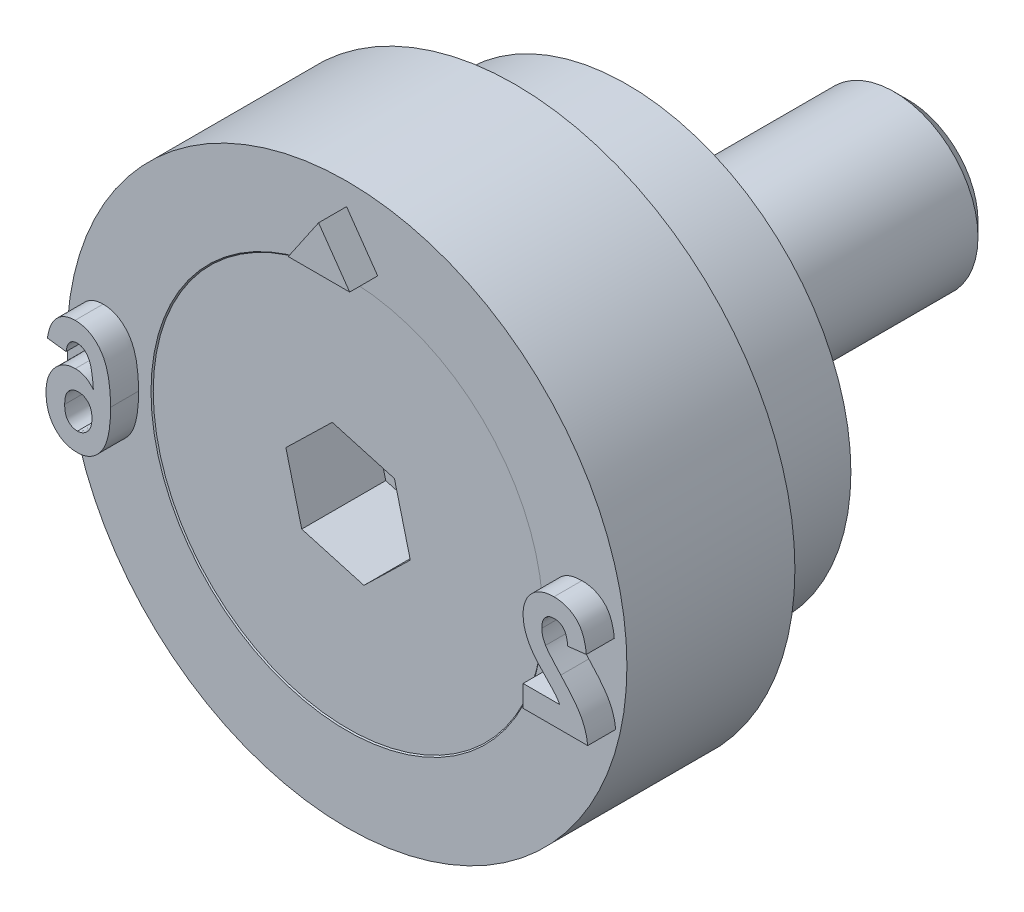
ISO-10303-21;
HEADER;
FILE_DESCRIPTION(('STEP AP214'),'2;1');
FILE_NAME('part.step','',(''),(''),'','','');
FILE_SCHEMA(('AUTOMOTIVE_DESIGN { 1 0 10303 214 1 1 1 1 }'));
ENDSEC;
DATA;
#1=APPLICATION_CONTEXT('core data for automotive mechanical design processes');
#2=APPLICATION_PROTOCOL_DEFINITION('international standard','automotive_design',2000,#1);
#3=PRODUCT_CONTEXT('',#1,'mechanical');
#4=PRODUCT('Part','Part','',(#3));
#5=PRODUCT_RELATED_PRODUCT_CATEGORY('part','',(#4));
#6=PRODUCT_DEFINITION_FORMATION('','',#4);
#7=PRODUCT_DEFINITION_CONTEXT('part definition',#1,'design');
#8=PRODUCT_DEFINITION('design','',#6,#7);
#9=PRODUCT_DEFINITION_SHAPE('','',#8);
#10=(LENGTH_UNIT() NAMED_UNIT(*) SI_UNIT(.MILLI.,.METRE.));
#11=(NAMED_UNIT(*) PLANE_ANGLE_UNIT() SI_UNIT($,.RADIAN.));
#12=(NAMED_UNIT(*) SI_UNIT($,.STERADIAN.) SOLID_ANGLE_UNIT());
#13=UNCERTAINTY_MEASURE_WITH_UNIT(LENGTH_MEASURE(1.E-05),#10,'distance_accuracy_value','');
#14=(GEOMETRIC_REPRESENTATION_CONTEXT(3) GLOBAL_UNCERTAINTY_ASSIGNED_CONTEXT((#13)) GLOBAL_UNIT_ASSIGNED_CONTEXT((#10,
#11,#12)) REPRESENTATION_CONTEXT('',''));
#15=CARTESIAN_POINT('',(0.,0.,0.));
#16=DIRECTION('',(0.,0.,1.));
#17=DIRECTION('',(1.,0.,0.));
#18=AXIS2_PLACEMENT_3D('',#15,#16,#17);
#19=CARTESIAN_POINT('',(0.,0.,-0.0200000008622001));
#20=DIRECTION('',(0.,0.,1.));
#21=DIRECTION('',(1.,0.,0.));
#22=AXIS2_PLACEMENT_3D('',#19,#20,#21);
#23=CYLINDRICAL_SURFACE('',#22,1.5);
#24=CARTESIAN_POINT('',(0.,0.,-2.0000000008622));
#25=DIRECTION('',(0.,0.,1.));
#26=DIRECTION('',(1.,0.,0.));
#27=AXIS2_PLACEMENT_3D('',#24,#25,#26);
#28=CIRCLE('',#27,1.5);
#29=CARTESIAN_POINT('',(1.5,0.,-2.0000000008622));
#30=VERTEX_POINT('',#29);
#31=EDGE_CURVE('E12',#30,#30,#28,.T.);
#32=ORIENTED_EDGE('',*,*,#31,.F.);
#33=EDGE_LOOP('',(#32));
#34=FACE_BOUND('',#33,.T.);
#35=CARTESIAN_POINT('',(0.,0.,-9.7700000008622));
#36=DIRECTION('',(0.,0.,1.));
#37=DIRECTION('',(1.,0.,0.));
#38=AXIS2_PLACEMENT_3D('',#35,#36,#37);
#39=CIRCLE('',#38,1.5);
#40=CARTESIAN_POINT('',(1.5,0.,-9.7700000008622));
#41=VERTEX_POINT('',#40);
#42=EDGE_CURVE('E150',#41,#41,#39,.T.);
#43=ORIENTED_EDGE('',*,*,#42,.T.);
#44=EDGE_LOOP('',(#43));
#45=FACE_BOUND('',#44,.T.);
#46=ADVANCED_FACE('F49',(#34,#45),#23,.T.);
#47=CARTESIAN_POINT('',(0.,0.,-2.0000000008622));
#48=DIRECTION('',(0.,0.,1.));
#49=DIRECTION('',(1.,0.,0.));
#50=AXIS2_PLACEMENT_3D('',#47,#48,#49);
#51=CONICAL_SURFACE('',#50,1.5,0.785398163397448);
#52=CARTESIAN_POINT('',(0.,0.,-0.0200000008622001));
#53=DIRECTION('',(0.,0.,1.));
#54=DIRECTION('',(1.,0.,0.));
#55=AXIS2_PLACEMENT_3D('',#52,#53,#54);
#56=CIRCLE('',#55,3.48);
#57=CARTESIAN_POINT('',(3.48,0.,-0.0200000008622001));
#58=VERTEX_POINT('',#57);
#59=EDGE_CURVE('E56',#58,#58,#56,.T.);
#60=ORIENTED_EDGE('',*,*,#59,.F.);
#61=EDGE_LOOP('',(#60));
#62=FACE_BOUND('',#61,.T.);
#63=ORIENTED_EDGE('',*,*,#31,.T.);
#64=EDGE_LOOP('',(#63));
#65=FACE_BOUND('',#64,.T.);
#66=ADVANCED_FACE('F165',(#62,#65),#51,.T.);
#67=CARTESIAN_POINT('',(0.,3.48,-0.0200000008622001));
#68=DIRECTION('',(0.,0.,-1.));
#69=DIRECTION('',(-1.,0.,0.));
#70=AXIS2_PLACEMENT_3D('',#67,#68,#69);
#71=PLANE('',#70);
#72=DIRECTION('',(0.962144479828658,-0.272539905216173,0.));
#73=VECTOR('',#72,1.);
#74=CARTESIAN_POINT('',(-0.828034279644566,-0.804793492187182,-0.0200000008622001));
#75=LINE('',#74,#73);
#76=CARTESIAN_POINT('',(-0.828034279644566,-0.804793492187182,-0.0200000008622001));
#77=VERTEX_POINT('',#76);
#78=CARTESIAN_POINT('',(0.282954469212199,-1.11949546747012,-0.0200000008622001));
#79=VERTEX_POINT('',#78);
#80=EDGE_CURVE('E137',#77,#79,#75,.T.);
#81=ORIENTED_EDGE('',*,*,#80,.F.);
#82=DIRECTION('',(0.245045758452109,-0.969511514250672,0.));
#83=VECTOR('',#82,1.);
#84=CARTESIAN_POINT('',(-1.11098874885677,0.314701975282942,-0.0200000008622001));
#85=LINE('',#84,#83);
#86=CARTESIAN_POINT('',(-1.11098874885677,0.314701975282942,-0.0200000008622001));
#87=VERTEX_POINT('',#86);
#88=EDGE_CURVE('E63',#87,#77,#85,.T.);
#89=ORIENTED_EDGE('',*,*,#88,.F.);
#90=DIRECTION('',(-0.717098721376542,-0.696971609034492,0.));
#91=VECTOR('',#90,1.);
#92=CARTESIAN_POINT('',(-0.282954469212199,1.11949546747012,-0.0200000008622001));
#93=LINE('',#92,#91);
#94=CARTESIAN_POINT('',(-0.282954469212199,1.11949546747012,-0.0200000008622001));
#95=VERTEX_POINT('',#94);
#96=EDGE_CURVE('E146',#95,#87,#93,.T.);
#97=ORIENTED_EDGE('',*,*,#96,.F.);
#98=DIRECTION('',(-0.962144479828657,0.272539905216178,0.));
#99=VECTOR('',#98,1.);
#100=CARTESIAN_POINT('',(0.828034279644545,0.804793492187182,-0.0200000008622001));
#101=LINE('',#100,#99);
#102=CARTESIAN_POINT('',(0.828034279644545,0.804793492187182,-0.0200000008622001));
#103=VERTEX_POINT('',#102);
#104=EDGE_CURVE('E144',#103,#95,#101,.T.);
#105=ORIENTED_EDGE('',*,*,#104,.F.);
#106=DIRECTION('',(-0.245045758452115,0.96951151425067,0.));
#107=VECTOR('',#106,1.);
#108=CARTESIAN_POINT('',(1.11098874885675,-0.314701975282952,-0.0200000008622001));
#109=LINE('',#108,#107);
#110=CARTESIAN_POINT('',(1.11098874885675,-0.314701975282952,-0.0200000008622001));
#111=VERTEX_POINT('',#110);
#112=EDGE_CURVE('E111',#111,#103,#109,.T.);
#113=ORIENTED_EDGE('',*,*,#112,.F.);
#114=DIRECTION('',(0.717098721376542,0.696971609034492,0.));
#115=VECTOR('',#114,1.);
#116=CARTESIAN_POINT('',(0.282954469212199,-1.11949546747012,-0.0200000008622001));
#117=LINE('',#116,#115);
#118=EDGE_CURVE('E140',#79,#111,#117,.T.);
#119=ORIENTED_EDGE('',*,*,#118,.F.);
#120=EDGE_LOOP('',(#81,#89,#97,#105,#113,#119));
#121=FACE_BOUND('',#120,.T.);
#122=ORIENTED_EDGE('',*,*,#59,.T.);
#123=EDGE_LOOP('',(#122));
#124=FACE_BOUND('',#123,.T.);
#125=ADVANCED_FACE('F163',(#121,#124),#71,.F.);
#126=CARTESIAN_POINT('',(0.,0.,-10.0200000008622));
#127=DIRECTION('',(0.,0.,1.));
#128=DIRECTION('',(1.,0.,0.));
#129=AXIS2_PLACEMENT_3D('',#126,#127,#128);
#130=PLANE('',#129);
#131=CARTESIAN_POINT('',(0.,0.,-10.0200000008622));
#132=DIRECTION('',(0.,0.,1.));
#133=DIRECTION('',(1.,0.,0.));
#134=AXIS2_PLACEMENT_3D('',#131,#132,#133);
#135=CIRCLE('',#134,1.25);
#136=CARTESIAN_POINT('',(1.25,0.,-10.0200000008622));
#137=VERTEX_POINT('',#136);
#138=EDGE_CURVE('E158',#137,#137,#135,.T.);
#139=ORIENTED_EDGE('',*,*,#138,.F.);
#140=EDGE_LOOP('',(#139));
#141=FACE_BOUND('',#140,.T.);
#142=ADVANCED_FACE('F178',(#141),#130,.F.);
#143=CARTESIAN_POINT('',(0.,0.,-10.0200000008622));
#144=DIRECTION('',(0.,0.,1.));
#145=DIRECTION('',(1.,0.,0.));
#146=AXIS2_PLACEMENT_3D('',#143,#144,#145);
#147=CONICAL_SURFACE('',#146,1.25,0.78539816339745);
#148=ORIENTED_EDGE('',*,*,#42,.F.);
#149=EDGE_LOOP('',(#148));
#150=FACE_BOUND('',#149,.T.);
#151=ORIENTED_EDGE('',*,*,#138,.T.);
#152=EDGE_LOOP('',(#151));
#153=FACE_BOUND('',#152,.T.);
#154=ADVANCED_FACE('F174',(#150,#153),#147,.T.);
#155=CARTESIAN_POINT('',(-1.11098874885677,0.314701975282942,-1.5200000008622));
#156=DIRECTION('',(-0.969511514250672,-0.245045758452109,0.));
#157=DIRECTION('',(0.245045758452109,-0.969511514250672,0.));
#158=AXIS2_PLACEMENT_3D('',#155,#156,#157);
#159=PLANE('',#158);
#160=ORIENTED_EDGE('',*,*,#88,.T.);
#161=DIRECTION('',(0.,0.,1.));
#162=VECTOR('',#161,1.);
#163=CARTESIAN_POINT('',(-0.828034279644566,-0.804793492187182,-1.5200000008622));
#164=LINE('',#163,#162);
#165=CARTESIAN_POINT('',(-0.828034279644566,-0.804793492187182,-1.5200000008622));
#166=VERTEX_POINT('',#165);
#167=EDGE_CURVE('E93',#166,#77,#164,.T.);
#168=ORIENTED_EDGE('',*,*,#167,.F.);
#169=DIRECTION('',(0.245045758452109,-0.969511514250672,0.));
#170=VECTOR('',#169,1.);
#171=CARTESIAN_POINT('',(-1.11098874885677,0.314701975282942,-1.5200000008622));
#172=LINE('',#171,#170);
#173=CARTESIAN_POINT('',(-1.11098874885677,0.314701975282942,-1.5200000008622));
#174=VERTEX_POINT('',#173);
#175=EDGE_CURVE('E148',#174,#166,#172,.T.);
#176=ORIENTED_EDGE('',*,*,#175,.F.);
#177=DIRECTION('',(0.,0.,1.));
#178=VECTOR('',#177,1.);
#179=CARTESIAN_POINT('',(-1.11098874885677,0.314701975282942,-1.5200000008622));
#180=LINE('',#179,#178);
#181=EDGE_CURVE('E71',#174,#87,#180,.T.);
#182=ORIENTED_EDGE('',*,*,#181,.T.);
#183=EDGE_LOOP('',(#160,#168,#176,#182));
#184=FACE_BOUND('',#183,.T.);
#185=ADVANCED_FACE('F177',(#184),#159,.F.);
#186=CARTESIAN_POINT('',(-0.282954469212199,1.11949546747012,-1.5200000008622));
#187=DIRECTION('',(-0.696971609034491,0.717098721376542,0.));
#188=DIRECTION('',(-0.717098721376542,-0.696971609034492,0.));
#189=AXIS2_PLACEMENT_3D('',#186,#187,#188);
#190=PLANE('',#189);
#191=ORIENTED_EDGE('',*,*,#96,.T.);
#192=ORIENTED_EDGE('',*,*,#181,.F.);
#193=DIRECTION('',(-0.717098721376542,-0.696971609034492,0.));
#194=VECTOR('',#193,1.);
#195=CARTESIAN_POINT('',(-0.282954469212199,1.11949546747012,-1.5200000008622));
#196=LINE('',#195,#194);
#197=CARTESIAN_POINT('',(-0.282954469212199,1.11949546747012,-1.5200000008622));
#198=VERTEX_POINT('',#197);
#199=EDGE_CURVE('E123',#198,#174,#196,.T.);
#200=ORIENTED_EDGE('',*,*,#199,.F.);
#201=DIRECTION('',(0.,0.,1.));
#202=VECTOR('',#201,1.);
#203=CARTESIAN_POINT('',(-0.282954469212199,1.11949546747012,-1.5200000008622));
#204=LINE('',#203,#202);
#205=EDGE_CURVE('E115',#198,#95,#204,.T.);
#206=ORIENTED_EDGE('',*,*,#205,.T.);
#207=EDGE_LOOP('',(#191,#192,#200,#206));
#208=FACE_BOUND('',#207,.T.);
#209=ADVANCED_FACE('F192',(#208),#190,.F.);
#210=CARTESIAN_POINT('',(0.828034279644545,0.804793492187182,-1.5200000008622));
#211=DIRECTION('',(0.272539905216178,0.962144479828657,0.));
#212=DIRECTION('',(-0.962144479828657,0.272539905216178,0.));
#213=AXIS2_PLACEMENT_3D('',#210,#211,#212);
#214=PLANE('',#213);
#215=ORIENTED_EDGE('',*,*,#104,.T.);
#216=ORIENTED_EDGE('',*,*,#205,.F.);
#217=DIRECTION('',(-0.962144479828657,0.272539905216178,0.));
#218=VECTOR('',#217,1.);
#219=CARTESIAN_POINT('',(0.828034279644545,0.804793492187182,-1.5200000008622));
#220=LINE('',#219,#218);
#221=CARTESIAN_POINT('',(0.828034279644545,0.804793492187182,-1.5200000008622));
#222=VERTEX_POINT('',#221);
#223=EDGE_CURVE('E119',#222,#198,#220,.T.);
#224=ORIENTED_EDGE('',*,*,#223,.F.);
#225=DIRECTION('',(0.,0.,1.));
#226=VECTOR('',#225,1.);
#227=CARTESIAN_POINT('',(0.828034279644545,0.804793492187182,-1.5200000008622));
#228=LINE('',#227,#226);
#229=EDGE_CURVE('E104',#222,#103,#228,.T.);
#230=ORIENTED_EDGE('',*,*,#229,.T.);
#231=EDGE_LOOP('',(#215,#216,#224,#230));
#232=FACE_BOUND('',#231,.T.);
#233=ADVANCED_FACE('F120',(#232),#214,.F.);
#234=CARTESIAN_POINT('',(1.11098874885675,-0.314701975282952,-1.5200000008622));
#235=DIRECTION('',(0.96951151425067,0.245045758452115,0.));
#236=DIRECTION('',(-0.245045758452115,0.96951151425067,0.));
#237=AXIS2_PLACEMENT_3D('',#234,#235,#236);
#238=PLANE('',#237);
#239=ORIENTED_EDGE('',*,*,#112,.T.);
#240=ORIENTED_EDGE('',*,*,#229,.F.);
#241=DIRECTION('',(-0.245045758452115,0.96951151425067,0.));
#242=VECTOR('',#241,1.);
#243=CARTESIAN_POINT('',(1.11098874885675,-0.314701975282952,-1.5200000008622));
#244=LINE('',#243,#242);
#245=CARTESIAN_POINT('',(1.11098874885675,-0.314701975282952,-1.5200000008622));
#246=VERTEX_POINT('',#245);
#247=EDGE_CURVE('E108',#246,#222,#244,.T.);
#248=ORIENTED_EDGE('',*,*,#247,.F.);
#249=DIRECTION('',(0.,0.,1.));
#250=VECTOR('',#249,1.);
#251=CARTESIAN_POINT('',(1.11098874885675,-0.314701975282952,-1.5200000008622));
#252=LINE('',#251,#250);
#253=EDGE_CURVE('E116',#246,#111,#252,.T.);
#254=ORIENTED_EDGE('',*,*,#253,.T.);
#255=EDGE_LOOP('',(#239,#240,#248,#254));
#256=FACE_BOUND('',#255,.T.);
#257=ADVANCED_FACE('F106',(#256),#238,.F.);
#258=CARTESIAN_POINT('',(0.282954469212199,-1.11949546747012,-1.5200000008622));
#259=DIRECTION('',(0.696971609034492,-0.717098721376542,0.));
#260=DIRECTION('',(0.717098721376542,0.696971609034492,0.));
#261=AXIS2_PLACEMENT_3D('',#258,#259,#260);
#262=PLANE('',#261);
#263=ORIENTED_EDGE('',*,*,#118,.T.);
#264=ORIENTED_EDGE('',*,*,#253,.F.);
#265=DIRECTION('',(0.717098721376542,0.696971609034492,0.));
#266=VECTOR('',#265,1.);
#267=CARTESIAN_POINT('',(0.282954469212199,-1.11949546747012,-1.5200000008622));
#268=LINE('',#267,#266);
#269=CARTESIAN_POINT('',(0.282954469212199,-1.11949546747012,-1.5200000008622));
#270=VERTEX_POINT('',#269);
#271=EDGE_CURVE('E129',#270,#246,#268,.T.);
#272=ORIENTED_EDGE('',*,*,#271,.F.);
#273=DIRECTION('',(0.,0.,1.));
#274=VECTOR('',#273,1.);
#275=CARTESIAN_POINT('',(0.282954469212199,-1.11949546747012,-1.5200000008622));
#276=LINE('',#275,#274);
#277=EDGE_CURVE('E153',#270,#79,#276,.T.);
#278=ORIENTED_EDGE('',*,*,#277,.T.);
#279=EDGE_LOOP('',(#263,#264,#272,#278));
#280=FACE_BOUND('',#279,.T.);
#281=ADVANCED_FACE('F196',(#280),#262,.F.);
#282=CARTESIAN_POINT('',(-0.828034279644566,-0.804793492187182,-1.5200000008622));
#283=DIRECTION('',(-0.272539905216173,-0.962144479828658,0.));
#284=DIRECTION('',(0.962144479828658,-0.272539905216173,0.));
#285=AXIS2_PLACEMENT_3D('',#282,#283,#284);
#286=PLANE('',#285);
#287=ORIENTED_EDGE('',*,*,#80,.T.);
#288=ORIENTED_EDGE('',*,*,#277,.F.);
#289=DIRECTION('',(0.962144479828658,-0.272539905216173,0.));
#290=VECTOR('',#289,1.);
#291=CARTESIAN_POINT('',(-0.828034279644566,-0.804793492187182,-1.5200000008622));
#292=LINE('',#291,#290);
#293=EDGE_CURVE('E131',#166,#270,#292,.T.);
#294=ORIENTED_EDGE('',*,*,#293,.F.);
#295=ORIENTED_EDGE('',*,*,#167,.T.);
#296=EDGE_LOOP('',(#287,#288,#294,#295));
#297=FACE_BOUND('',#296,.T.);
#298=ADVANCED_FACE('F193',(#297),#286,.F.);
#299=CARTESIAN_POINT('',(0.,0.,-1.5200000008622));
#300=DIRECTION('',(0.,0.,1.));
#301=DIRECTION('',(1.,0.,0.));
#302=AXIS2_PLACEMENT_3D('',#299,#300,#301);
#303=PLANE('',#302);
#304=ORIENTED_EDGE('',*,*,#175,.T.);
#305=ORIENTED_EDGE('',*,*,#293,.T.);
#306=ORIENTED_EDGE('',*,*,#271,.T.);
#307=ORIENTED_EDGE('',*,*,#247,.T.);
#308=ORIENTED_EDGE('',*,*,#223,.T.);
#309=ORIENTED_EDGE('',*,*,#199,.T.);
#310=EDGE_LOOP('',(#304,#305,#306,#307,#308,#309));
#311=FACE_BOUND('',#310,.T.);
#312=ADVANCED_FACE('F126',(#311),#303,.T.);
#313=CLOSED_SHELL('',(#46,#66,#125,#142,#154,#185,#209,#233,#257,#281,#298,#312));
#314=MANIFOLD_SOLID_BREP('B2',#313);
#315=CARTESIAN_POINT('',(0.,5.,0.));
#316=DIRECTION('',(0.,0.,-1.));
#317=DIRECTION('',(-1.,0.,0.));
#318=AXIS2_PLACEMENT_3D('',#315,#316,#317);
#319=PLANE('',#318);
#320=CARTESIAN_POINT('',(-4.51626153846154,0.356397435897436,0.));
#321=CARTESIAN_POINT('',(-4.51378821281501,0.374913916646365,0.));
#322=CARTESIAN_POINT('',(-4.50914141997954,0.409701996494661,0.));
#323=CARTESIAN_POINT('',(-4.49557998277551,0.457705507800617,0.));
#324=CARTESIAN_POINT('',(-4.47694656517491,0.498287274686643,0.));
#325=CARTESIAN_POINT('',(-4.45247881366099,0.530885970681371,0.));
#326=CARTESIAN_POINT('',(-4.42398814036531,0.556514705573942,0.));
#327=CARTESIAN_POINT('',(-4.39109630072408,0.574527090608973,0.));
#328=CARTESIAN_POINT('',(-4.35412022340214,0.585202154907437,0.));
#329=CARTESIAN_POINT('',(-4.32816586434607,0.586496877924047,0.));
#330=CARTESIAN_POINT('',(-4.3147391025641,0.587166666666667,0.));
#331=B_SPLINE_CURVE_WITH_KNOTS('',3,(#320,#321,#322,#323,#324,#325,#326,#327,#328,#329,#330),
.UNSPECIFIED.,.F.,.F.,(4,1,1,1,1,1,1,1,4),(0.,0.16420430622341,0.308500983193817,
0.437274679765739,0.554779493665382,0.664657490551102,0.771941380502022,0.882020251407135,1.),.UNSPECIFIED.);
#332=CARTESIAN_POINT('',(-4.3147391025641,0.587166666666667,0.));
#333=VERTEX_POINT('',#332);
#334=CARTESIAN_POINT('',(-4.51626153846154,0.356397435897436,0.));
#335=VERTEX_POINT('',#334);
#336=EDGE_CURVE('E317',#333,#335,#331,.F.);
#337=ORIENTED_EDGE('',*,*,#336,.T.);
#338=DIRECTION('',(-0.992130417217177,0.125208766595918,0.));
#339=VECTOR('',#338,1.);
#340=CARTESIAN_POINT('',(-0.647646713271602,-0.131829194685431,0.));
#341=LINE('',#340,#339);
#342=CARTESIAN_POINT('',(-4.84959487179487,0.398464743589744,0.));
#343=VERTEX_POINT('',#342);
#344=EDGE_CURVE('E47',#335,#343,#341,.T.);
#345=ORIENTED_EDGE('',*,*,#344,.T.);
#346=CARTESIAN_POINT('',(-4.35640576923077,0.9205,0.));
#347=CARTESIAN_POINT('',(-4.37258947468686,0.920174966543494,0.));
#348=CARTESIAN_POINT('',(-4.40428930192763,0.919538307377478,0.));
#349=CARTESIAN_POINT('',(-4.45080634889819,0.91275538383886,0.));
#350=CARTESIAN_POINT('',(-4.495240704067,0.902509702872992,0.));
#351=CARTESIAN_POINT('',(-4.53764520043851,0.888117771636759,0.));
#352=CARTESIAN_POINT('',(-4.57765352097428,0.869075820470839,0.));
#353=CARTESIAN_POINT('',(-4.61540942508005,0.845663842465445,0.));
#354=CARTESIAN_POINT('',(-4.65119460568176,0.818247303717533,0.));
#355=CARTESIAN_POINT('',(-4.68493890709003,0.787045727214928,0.));
#356=CARTESIAN_POINT('',(-4.71589644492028,0.751550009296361,0.));
#357=CARTESIAN_POINT('',(-4.74387040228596,0.712120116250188,0.));
#358=CARTESIAN_POINT('',(-4.76922701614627,0.669171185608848,0.));
#359=CARTESIAN_POINT('',(-4.79127243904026,0.622293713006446,0.));
#360=CARTESIAN_POINT('',(-4.8103736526,0.571747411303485,0.));
#361=CARTESIAN_POINT('',(-4.82690784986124,0.517457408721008,0.));
#362=CARTESIAN_POINT('',(-4.84002623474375,0.45930121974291,0.));
#363=CARTESIAN_POINT('',(-4.84635363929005,0.419072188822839,0.));
#364=CARTESIAN_POINT('',(-4.84959487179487,0.398464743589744,0.));
#365=B_SPLINE_CURVE_WITH_KNOTS('',3,(#346,#347,#348,#349,#350,#351,#352,#353,#354,#355,#356,
#357,#358,#359,#360,#361,#362,#363,#364),.UNSPECIFIED.,.F.,.F.,(4,1,1,1,1,1,1,1,1,1,1,1,1,1,1,1,
4),(0.,0.0611751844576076,0.119826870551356,0.177416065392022,0.233487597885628,
0.288846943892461,0.344642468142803,0.401221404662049,0.459126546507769,0.518194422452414,
0.579030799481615,0.64175475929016,0.706604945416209,0.774715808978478,0.84598657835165,
0.921106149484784,1.),.UNSPECIFIED.);
#366=CARTESIAN_POINT('',(-4.35640576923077,0.9205,0.));
#367=VERTEX_POINT('',#366);
#368=EDGE_CURVE('E995',#343,#367,#365,.F.);
#369=ORIENTED_EDGE('',*,*,#368,.T.);
#370=CARTESIAN_POINT('',(-3.72138974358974,-0.106342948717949,0.));
#371=CARTESIAN_POINT('',(-3.72187774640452,-0.062523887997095,0.));
#372=CARTESIAN_POINT('',(-3.72282050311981,0.0221287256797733,0.));
#373=CARTESIAN_POINT('',(-3.73142132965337,0.144333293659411,0.));
#374=CARTESIAN_POINT('',(-3.74461187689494,0.2571615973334,0.));
#375=CARTESIAN_POINT('',(-3.76364696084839,0.360423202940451,0.));
#376=CARTESIAN_POINT('',(-3.78828267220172,0.454295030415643,0.));
#377=CARTESIAN_POINT('',(-3.81861901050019,0.538680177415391,0.));
#378=CARTESIAN_POINT('',(-3.85398333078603,0.613969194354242,0.));
#379=CARTESIAN_POINT('',(-3.89571077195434,0.679385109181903,0.));
#380=CARTESIAN_POINT('',(-3.94167553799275,0.736249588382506,0.));
#381=CARTESIAN_POINT('',(-3.99107487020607,0.78550484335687,0.));
#382=CARTESIAN_POINT('',(-4.04398903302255,0.827070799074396,0.));
#383=CARTESIAN_POINT('',(-4.09982150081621,0.861617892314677,0.));
#384=CARTESIAN_POINT('',(-4.15941315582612,0.887729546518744,0.));
#385=CARTESIAN_POINT('',(-4.22207607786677,0.906595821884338,0.));
#386=CARTESIAN_POINT('',(-4.28809572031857,0.918733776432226,0.));
#387=CARTESIAN_POINT('',(-4.33338217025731,0.919904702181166,0.));
#388=CARTESIAN_POINT('',(-4.35640576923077,0.9205,0.));
#389=B_SPLINE_CURVE_WITH_KNOTS('',3,(#370,#371,#372,#373,#374,#375,#376,#377,#378,#379,#380,
#381,#382,#383,#384,#385,#386,#387,#388),.UNSPECIFIED.,.F.,.F.,(4,1,1,1,1,1,1,1,1,1,1,1,1,1,1,1,
4),(0.,0.0968769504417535,0.187153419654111,0.270734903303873,0.347936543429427,
0.419133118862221,0.485079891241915,0.545967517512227,0.602654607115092,0.656196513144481,
0.707353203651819,0.756561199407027,0.804672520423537,0.852134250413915,0.899962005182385,
0.949140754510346,1.),.UNSPECIFIED.);
#390=CARTESIAN_POINT('',(-3.72138974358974,-0.106342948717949,0.));
#391=VERTEX_POINT('',#390);
#392=EDGE_CURVE('E1003',#367,#391,#389,.F.);
#393=ORIENTED_EDGE('',*,*,#392,.T.);
#394=CARTESIAN_POINT('',(-4.31994743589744,-1.10514102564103,0.));
#395=CARTESIAN_POINT('',(-4.29853386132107,-1.10447198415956,0.));
#396=CARTESIAN_POINT('',(-4.25649155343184,-1.10315842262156,0.));
#397=CARTESIAN_POINT('',(-4.19491226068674,-1.09206797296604,0.));
#398=CARTESIAN_POINT('',(-4.13637044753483,-1.07352474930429,0.));
#399=CARTESIAN_POINT('',(-4.08079336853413,-1.04754843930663,0.));
#400=CARTESIAN_POINT('',(-4.0277725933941,-1.01500812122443,0.));
#401=CARTESIAN_POINT('',(-3.97816600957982,-0.974369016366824,0.));
#402=CARTESIAN_POINT('',(-3.93189574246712,-0.9262830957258,0.));
#403=CARTESIAN_POINT('',(-3.88757825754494,-0.871691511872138,0.));
#404=CARTESIAN_POINT('',(-3.84813186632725,-0.807957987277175,0.));
#405=CARTESIAN_POINT('',(-3.81374749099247,-0.73513972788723,0.));
#406=CARTESIAN_POINT('',(-3.78520612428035,-0.652839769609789,0.));
#407=CARTESIAN_POINT('',(-3.76168318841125,-0.561437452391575,0.));
#408=CARTESIAN_POINT('',(-3.74357780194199,-0.460717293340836,0.));
#409=CARTESIAN_POINT('',(-3.73045716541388,-0.350760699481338,0.));
#410=CARTESIAN_POINT('',(-3.72308531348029,-0.231577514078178,0.));
#411=CARTESIAN_POINT('',(-3.72196847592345,-0.149088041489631,0.));
#412=CARTESIAN_POINT('',(-3.72138974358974,-0.106342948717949,0.));
#413=B_SPLINE_CURVE_WITH_KNOTS('',3,(#394,#395,#396,#397,#398,#399,#400,#401,#402,#403,#404,
#405,#406,#407,#408,#409,#410,#411,#412),.UNSPECIFIED.,.F.,.F.,(4,1,1,1,1,1,1,1,1,1,1,1,1,1,1,1,
4),(0.,0.0492015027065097,0.096599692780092,0.143304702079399,0.190008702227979,
0.23729638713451,0.285966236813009,0.336988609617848,0.390499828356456,0.447322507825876,
0.508847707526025,0.575267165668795,0.647277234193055,0.725623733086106,0.810356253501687,
0.901728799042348,1.),.UNSPECIFIED.);
#414=CARTESIAN_POINT('',(-4.31994743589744,-1.10514102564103,0.));
#415=VERTEX_POINT('',#414);
#416=EDGE_CURVE('E1011',#391,#415,#413,.F.);
#417=ORIENTED_EDGE('',*,*,#416,.T.);
#418=CARTESIAN_POINT('',(-4.8752358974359,-0.452897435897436,0.));
#419=CARTESIAN_POINT('',(-4.87479047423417,-0.476952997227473,0.));
#420=CARTESIAN_POINT('',(-4.87392225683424,-0.523842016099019,0.));
#421=CARTESIAN_POINT('',(-4.86668424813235,-0.592475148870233,0.));
#422=CARTESIAN_POINT('',(-4.8542041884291,-0.657260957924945,0.));
#423=CARTESIAN_POINT('',(-4.8375101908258,-0.718789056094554,0.));
#424=CARTESIAN_POINT('',(-4.81548605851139,-0.77648938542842,0.));
#425=CARTESIAN_POINT('',(-4.78849124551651,-0.830562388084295,0.));
#426=CARTESIAN_POINT('',(-4.7567049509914,-0.880916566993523,0.));
#427=CARTESIAN_POINT('',(-4.72039336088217,-0.927173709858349,0.));
#428=CARTESIAN_POINT('',(-4.68029621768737,-0.968954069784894,0.));
#429=CARTESIAN_POINT('',(-4.63715874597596,-1.00552103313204,0.));
#430=CARTESIAN_POINT('',(-4.59091839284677,-1.0361720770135,0.));
#431=CARTESIAN_POINT('',(-4.54236153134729,-1.06179099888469,0.));
#432=CARTESIAN_POINT('',(-4.49053048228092,-1.08088252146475,0.));
#433=CARTESIAN_POINT('',(-4.43621273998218,-1.09500565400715,0.));
#434=CARTESIAN_POINT('',(-4.3789811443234,-1.10360404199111,0.));
#435=CARTESIAN_POINT('',(-4.33987561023,-1.10462218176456,0.));
#436=CARTESIAN_POINT('',(-4.31994743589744,-1.10514102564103,0.));
#437=B_SPLINE_CURVE_WITH_KNOTS('',3,(#418,#419,#420,#421,#422,#423,#424,#425,#426,#427,#428,
#429,#430,#431,#432,#433,#434,#435,#436),.UNSPECIFIED.,.F.,.F.,(4,1,1,1,1,1,1,1,1,1,1,1,1,1,1,1,
4),(0.,0.0750177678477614,0.146224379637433,0.214927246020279,0.280612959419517,
0.344820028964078,0.407223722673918,0.468817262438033,0.530228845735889,0.590325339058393,
0.649151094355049,0.706220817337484,0.763043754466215,0.819985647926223,0.878076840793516,
0.937867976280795,1.),.UNSPECIFIED.);
#438=CARTESIAN_POINT('',(-4.8752358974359,-0.452897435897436,0.));
#439=VERTEX_POINT('',#438);
#440=EDGE_CURVE('E1019',#415,#439,#437,.F.);
#441=ORIENTED_EDGE('',*,*,#440,.T.);
#442=CARTESIAN_POINT('',(-4.35039615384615,0.176910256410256,0.));
#443=CARTESIAN_POINT('',(-4.36818556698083,0.176349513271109,0.));
#444=CARTESIAN_POINT('',(-4.40314744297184,0.175247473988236,0.));
#445=CARTESIAN_POINT('',(-4.45471351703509,0.167154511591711,0.));
#446=CARTESIAN_POINT('',(-4.50407739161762,0.152944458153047,0.));
#447=CARTESIAN_POINT('',(-4.55162981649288,0.133615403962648,0.));
#448=CARTESIAN_POINT('',(-4.59743921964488,0.108966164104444,0.));
#449=CARTESIAN_POINT('',(-4.64098413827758,0.0784180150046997,0.));
#450=CARTESIAN_POINT('',(-4.68254238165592,0.0422692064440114,0.));
#451=CARTESIAN_POINT('',(-4.72191958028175,0.0014214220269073,0.));
#452=CARTESIAN_POINT('',(-4.75769705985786,-0.0439736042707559,0.));
#453=CARTESIAN_POINT('',(-4.78923892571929,-0.0929232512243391,0.));
#454=CARTESIAN_POINT('',(-4.81622780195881,-0.145001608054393,0.));
#455=CARTESIAN_POINT('',(-4.83770827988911,-0.200571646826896,0.));
#456=CARTESIAN_POINT('',(-4.85473048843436,-0.259132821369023,0.));
#457=CARTESIAN_POINT('',(-4.86650693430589,-0.320837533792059,0.));
#458=CARTESIAN_POINT('',(-4.87395884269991,-0.385807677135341,0.));
#459=CARTESIAN_POINT('',(-4.87480334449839,-0.430173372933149,0.));
#460=CARTESIAN_POINT('',(-4.8752358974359,-0.452897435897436,0.));
#461=B_SPLINE_CURVE_WITH_KNOTS('',3,(#442,#443,#444,#445,#446,#447,#448,#449,#450,#451,#452,
#453,#454,#455,#456,#457,#458,#459,#460),.UNSPECIFIED.,.F.,.F.,(4,1,1,1,1,1,1,1,1,1,1,1,1,1,1,1,
4),(0.,0.0583907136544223,0.11475639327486,0.170822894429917,0.226672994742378,
0.282972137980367,0.341229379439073,0.400909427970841,0.463543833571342,0.527222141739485,
0.590338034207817,0.654457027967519,0.71942624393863,0.785610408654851,0.854396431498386,
0.925422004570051,1.),.UNSPECIFIED.);
#462=CARTESIAN_POINT('',(-4.35039615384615,0.176910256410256,0.));
#463=VERTEX_POINT('',#462);
#464=EDGE_CURVE('E1027',#439,#463,#461,.F.);
#465=ORIENTED_EDGE('',*,*,#464,.T.);
#466=CARTESIAN_POINT('',(-4.02948269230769,0.00944230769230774,0.));
#467=CARTESIAN_POINT('',(-4.04029836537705,0.0227685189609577,0.));
#468=CARTESIAN_POINT('',(-4.06141790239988,0.0487903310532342,0.));
#469=CARTESIAN_POINT('',(-4.09695825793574,0.0830070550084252,0.));
#470=CARTESIAN_POINT('',(-4.13433355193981,0.111946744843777,0.));
#471=CARTESIAN_POINT('',(-4.1734530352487,0.136197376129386,0.));
#472=CARTESIAN_POINT('',(-4.21508145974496,0.153927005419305,0.));
#473=CARTESIAN_POINT('',(-4.2583201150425,0.167636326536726,0.));
#474=CARTESIAN_POINT('',(-4.30379913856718,0.175098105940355,0.));
#475=CARTESIAN_POINT('',(-4.33474707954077,0.176301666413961,0.));
#476=CARTESIAN_POINT('',(-4.35039615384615,0.176910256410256,0.));
#477=B_SPLINE_CURVE_WITH_KNOTS('',3,(#466,#467,#468,#469,#470,#471,#472,#473,#474,#475,#476),
.UNSPECIFIED.,.F.,.F.,(4,1,1,1,1,1,1,1,4),(0.,0.136900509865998,0.267322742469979,
0.392698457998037,0.513725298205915,0.63354429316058,0.752907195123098,0.875055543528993,1.),.UNSPECIFIED.);
#478=CARTESIAN_POINT('',(-4.02948269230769,0.00944230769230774,0.));
#479=VERTEX_POINT('',#478);
#480=EDGE_CURVE('E1035',#463,#479,#477,.F.);
#481=ORIENTED_EDGE('',*,*,#480,.T.);
#482=CARTESIAN_POINT('',(-4.3147391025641,0.587166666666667,0.));
#483=CARTESIAN_POINT('',(-4.30562534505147,0.586930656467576,0.));
#484=CARTESIAN_POINT('',(-4.28748466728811,0.586460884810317,0.));
#485=CARTESIAN_POINT('',(-4.26111677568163,0.580499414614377,0.));
#486=CARTESIAN_POINT('',(-4.23574526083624,0.57164838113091,0.));
#487=CARTESIAN_POINT('',(-4.21154913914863,0.558997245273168,0.));
#488=CARTESIAN_POINT('',(-4.18820523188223,0.542928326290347,0.));
#489=CARTESIAN_POINT('',(-4.16623508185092,0.523069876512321,0.));
#490=CARTESIAN_POINT('',(-4.14510201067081,0.50000940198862,0.));
#491=CARTESIAN_POINT('',(-4.12526395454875,0.472675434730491,0.));
#492=CARTESIAN_POINT('',(-4.10632753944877,0.440078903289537,0.));
#493=CARTESIAN_POINT('',(-4.09028039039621,0.400184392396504,0.));
#494=CARTESIAN_POINT('',(-4.0754414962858,0.353197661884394,0.));
#495=CARTESIAN_POINT('',(-4.06319055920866,0.298541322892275,0.));
#496=CARTESIAN_POINT('',(-4.05124240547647,0.23690886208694,0.));
#497=CARTESIAN_POINT('',(-4.04252434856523,0.167684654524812,0.));
#498=CARTESIAN_POINT('',(-4.03481433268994,0.0911421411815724,0.));
#499=CARTESIAN_POINT('',(-4.03131380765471,0.0375015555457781,0.));
#500=CARTESIAN_POINT('',(-4.02948269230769,0.00944230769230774,0.));
#501=B_SPLINE_CURVE_WITH_KNOTS('',3,(#482,#483,#484,#485,#486,#487,#488,#489,#490,#491,#492,
#493,#494,#495,#496,#497,#498,#499,#500),.UNSPECIFIED.,.F.,.F.,(4,1,1,1,1,1,1,1,1,1,1,1,1,1,1,1,
4),(0.,0.0385532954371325,0.0767392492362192,0.113973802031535,0.152197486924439,
0.192074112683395,0.233765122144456,0.277433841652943,0.324413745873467,0.376643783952,
0.436768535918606,0.506220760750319,0.585296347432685,0.673989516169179,0.772204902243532,
0.880840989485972,1.),.UNSPECIFIED.);
#502=EDGE_CURVE('E1043',#479,#333,#501,.F.);
#503=ORIENTED_EDGE('',*,*,#502,.T.);
#504=EDGE_LOOP('',(#337,#345,#369,#393,#417,#441,#465,#481,#503));
#505=FACE_BOUND('',#504,.T.);
#506=CARTESIAN_POINT('',(0.,0.,0.));
#507=DIRECTION('',(0.,0.,1.));
#508=DIRECTION('',(1.,0.,0.));
#509=AXIS2_PLACEMENT_3D('',#506,#507,#508);
#510=CIRCLE('',#509,5.);
#511=CARTESIAN_POINT('',(5.,0.,0.));
#512=VERTEX_POINT('',#511);
#513=EDGE_CURVE('E942',#512,#512,#510,.T.);
#514=ORIENTED_EDGE('',*,*,#513,.T.);
#515=EDGE_LOOP('',(#514));
#516=FACE_BOUND('',#515,.T.);
#517=CARTESIAN_POINT('',(0.,0.,0.));
#518=DIRECTION('',(0.,0.,1.));
#519=DIRECTION('',(1.,0.,0.));
#520=AXIS2_PLACEMENT_3D('',#517,#518,#519);
#521=CIRCLE('',#520,3.5000000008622);
#522=CARTESIAN_POINT('',(3.5000000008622,0.,0.));
#523=VERTEX_POINT('',#522);
#524=EDGE_CURVE('E946',#523,#523,#521,.T.);
#525=ORIENTED_EDGE('',*,*,#524,.F.);
#526=EDGE_LOOP('',(#525));
#527=FACE_BOUND('',#526,.T.);
#528=DIRECTION('',(-0.573576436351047,0.819152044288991,0.));
#529=VECTOR('',#528,1.);
#530=CARTESIAN_POINT('',(0.548658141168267,3.81,0.));
#531=LINE('',#530,#529);
#532=CARTESIAN_POINT('',(0.548658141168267,3.81,0.));
#533=VERTEX_POINT('',#532);
#534=CARTESIAN_POINT('',(-0.00713159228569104,4.60375,0.));
#535=VERTEX_POINT('',#534);
#536=EDGE_CURVE('E507',#533,#535,#531,.T.);
#537=ORIENTED_EDGE('',*,*,#536,.F.);
#538=DIRECTION('',(1.,0.,0.));
#539=VECTOR('',#538,1.);
#540=CARTESIAN_POINT('',(-0.548658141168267,3.81,0.));
#541=LINE('',#540,#539);
#542=CARTESIAN_POINT('',(-0.548658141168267,3.81,0.));
#543=VERTEX_POINT('',#542);
#544=EDGE_CURVE('E794',#543,#533,#541,.T.);
#545=ORIENTED_EDGE('',*,*,#544,.F.);
#546=DIRECTION('',(-0.563573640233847,-0.826065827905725,0.));
#547=VECTOR('',#546,1.);
#548=CARTESIAN_POINT('',(-0.00713159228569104,4.60375,0.));
#549=LINE('',#548,#547);
#550=EDGE_CURVE('E1557',#535,#543,#549,.T.);
#551=ORIENTED_EDGE('',*,*,#550,.F.);
#552=EDGE_LOOP('',(#537,#545,#551));
#553=FACE_BOUND('',#552,.T.);
#554=DIRECTION('',(-1.,0.,0.));
#555=VECTOR('',#554,1.);
#556=CARTESIAN_POINT('',(0.,-1.0795,0.));
#557=LINE('',#556,#555);
#558=CARTESIAN_POINT('',(4.7996358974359,-1.0795,0.));
#559=VERTEX_POINT('',#558);
#560=CARTESIAN_POINT('',(3.64578974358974,-1.0795,0.));
#561=VERTEX_POINT('',#560);
#562=EDGE_CURVE('E952',#559,#561,#557,.T.);
#563=ORIENTED_EDGE('',*,*,#562,.T.);
#564=DIRECTION('',(0.,1.,0.));
#565=VECTOR('',#564,1.);
#566=CARTESIAN_POINT('',(3.64578974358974,5.,0.));
#567=LINE('',#566,#565);
#568=CARTESIAN_POINT('',(3.64578974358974,-0.694884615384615,0.));
#569=VERTEX_POINT('',#568);
#570=EDGE_CURVE('E954',#561,#569,#567,.T.);
#571=ORIENTED_EDGE('',*,*,#570,.T.);
#572=DIRECTION('',(1.,0.,0.));
#573=VECTOR('',#572,1.);
#574=CARTESIAN_POINT('',(0.,-0.694884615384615,0.));
#575=LINE('',#574,#573);
#576=CARTESIAN_POINT('',(4.29923525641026,-0.694884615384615,0.));
#577=VERTEX_POINT('',#576);
#578=EDGE_CURVE('E1535',#569,#577,#575,.T.);
#579=ORIENTED_EDGE('',*,*,#578,.T.);
#580=CARTESIAN_POINT('',(3.81566153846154,-0.125173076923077,0.));
#581=CARTESIAN_POINT('',(3.82091886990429,-0.132847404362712,0.));
#582=CARTESIAN_POINT('',(3.83220192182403,-0.149317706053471,0.));
#583=CARTESIAN_POINT('',(3.85205715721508,-0.17421227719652,0.));
#584=CARTESIAN_POINT('',(3.8744361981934,-0.202014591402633,0.));
#585=CARTESIAN_POINT('',(3.90014076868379,-0.232028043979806,0.));
#586=CARTESIAN_POINT('',(3.92905633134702,-0.264301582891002,0.));
#587=CARTESIAN_POINT('',(3.96053053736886,-0.299443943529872,0.));
#588=CARTESIAN_POINT('',(3.99616295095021,-0.33596917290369,0.));
#589=CARTESIAN_POINT('',(4.03290284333,-0.374801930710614,0.));
#590=CARTESIAN_POINT('',(4.07025825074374,-0.412253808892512,0.));
#591=CARTESIAN_POINT('',(4.1041164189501,-0.448096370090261,0.));
#592=CARTESIAN_POINT('',(4.13475565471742,-0.480101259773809,0.));
#593=CARTESIAN_POINT('',(4.16148576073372,-0.508922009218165,0.));
#594=CARTESIAN_POINT('',(4.18469884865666,-0.534183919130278,0.));
#595=CARTESIAN_POINT('',(4.20450316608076,-0.555682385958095,0.));
#596=CARTESIAN_POINT('',(4.22021600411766,-0.574175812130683,0.));
#597=CARTESIAN_POINT('',(4.24238770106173,-0.602402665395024,0.));
#598=CARTESIAN_POINT('',(4.27029425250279,-0.641165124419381,0.));
#599=CARTESIAN_POINT('',(4.28983877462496,-0.677443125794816,0.));
#600=CARTESIAN_POINT('',(4.29923525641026,-0.694884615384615,0.));
#601=B_SPLINE_CURVE_WITH_KNOTS('',3,(#580,#581,#582,#583,#584,#585,#586,#587,#588,#589,#590,
#591,#592,#593,#594,#595,#596,#597,#598,#599,#600),.UNSPECIFIED.,.F.,.F.,(4,1,1,1,1,1,1,1,1,1,1,
1,1,1,1,1,1,1,4),(0.,0.0372293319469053,0.079899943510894,0.127410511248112,0.180123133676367,
0.238064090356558,0.30089248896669,0.368957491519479,0.442313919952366,0.514902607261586,
0.580699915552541,0.639694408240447,0.692276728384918,0.73805927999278,0.777043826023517,
0.809286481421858,0.835170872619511,0.920754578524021,1.),.UNSPECIFIED.);
#602=CARTESIAN_POINT('',(3.81566153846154,-0.125173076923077,0.));
#603=VERTEX_POINT('',#602);
#604=EDGE_CURVE('E1527',#577,#603,#601,.F.);
#605=ORIENTED_EDGE('',*,*,#604,.T.);
#606=CARTESIAN_POINT('',(3.64578974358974,0.376429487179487,0.));
#607=CARTESIAN_POINT('',(3.64621245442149,0.354638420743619,0.));
#608=CARTESIAN_POINT('',(3.64705015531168,0.311454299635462,0.));
#609=CARTESIAN_POINT('',(3.65494215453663,0.247527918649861,0.));
#610=CARTESIAN_POINT('',(3.66766685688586,0.185179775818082,0.));
#611=CARTESIAN_POINT('',(3.68609868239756,0.124042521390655,0.));
#612=CARTESIAN_POINT('',(3.70952430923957,0.0629087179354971,0.));
#613=CARTESIAN_POINT('',(3.7391619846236,0.00107661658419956,0.));
#614=CARTESIAN_POINT('',(3.77429810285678,-0.0623403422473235,0.));
#615=CARTESIAN_POINT('',(3.80162214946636,-0.103846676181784,0.));
#616=CARTESIAN_POINT('',(3.81566153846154,-0.125173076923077,0.));
#617=B_SPLINE_CURVE_WITH_KNOTS('',3,(#606,#607,#608,#609,#610,#611,#612,#613,#614,#615,#616),
.UNSPECIFIED.,.F.,.F.,(4,1,1,1,1,1,1,1,4),(0.,0.121430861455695,0.240643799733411,
0.358470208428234,0.475770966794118,0.596193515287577,0.723070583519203,0.85771068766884,1.),.UNSPECIFIED.);
#618=CARTESIAN_POINT('',(3.64578974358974,0.376429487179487,0.));
#619=VERTEX_POINT('',#618);
#620=EDGE_CURVE('E1519',#603,#619,#617,.F.);
#621=ORIENTED_EDGE('',*,*,#620,.T.);
#622=CARTESIAN_POINT('',(4.19667115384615,0.9205,0.));
#623=CARTESIAN_POINT('',(4.17581907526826,0.920051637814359,0.));
#624=CARTESIAN_POINT('',(4.13518578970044,0.919177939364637,0.));
#625=CARTESIAN_POINT('',(4.07584387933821,0.911992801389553,0.));
#626=CARTESIAN_POINT('',(4.02003299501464,0.899340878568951,0.));
#627=CARTESIAN_POINT('',(3.96726601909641,0.882960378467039,0.));
#628=CARTESIAN_POINT('',(3.91839562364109,0.860482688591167,0.));
#629=CARTESIAN_POINT('',(3.87268241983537,0.833610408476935,0.));
#630=CARTESIAN_POINT('',(3.8306551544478,0.8013846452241,0.));
#631=CARTESIAN_POINT('',(3.7921920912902,0.76491912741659,0.));
#632=CARTESIAN_POINT('',(3.75792408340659,0.724880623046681,0.));
#633=CARTESIAN_POINT('',(3.72764558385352,0.682365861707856,0.));
#634=CARTESIAN_POINT('',(3.70225492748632,0.637244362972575,0.));
#635=CARTESIAN_POINT('',(3.68180020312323,0.589637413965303,0.));
#636=CARTESIAN_POINT('',(3.66574316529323,0.53972788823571,0.));
#637=CARTESIAN_POINT('',(3.65406868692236,0.48745142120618,0.));
#638=CARTESIAN_POINT('',(3.64722057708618,0.432701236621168,0.));
#639=CARTESIAN_POINT('',(3.64627242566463,0.395412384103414,0.));
#640=CARTESIAN_POINT('',(3.64578974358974,0.376429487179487,0.));
#641=B_SPLINE_CURVE_WITH_KNOTS('',3,(#622,#623,#624,#625,#626,#627,#628,#629,#630,#631,#632,
#633,#634,#635,#636,#637,#638,#639,#640),.UNSPECIFIED.,.F.,.F.,(4,1,1,1,1,1,1,1,1,1,1,1,1,1,1,1,
4),(0.,0.0718026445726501,0.139917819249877,0.205419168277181,0.268691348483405,
0.329822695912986,0.390243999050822,0.450956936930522,0.511795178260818,0.572457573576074,
0.632179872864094,0.69128264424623,0.750406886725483,0.810332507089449,0.871593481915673,
0.934631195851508,1.),.UNSPECIFIED.);
#642=CARTESIAN_POINT('',(4.19667115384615,0.9205,0.));
#643=VERTEX_POINT('',#642);
#644=EDGE_CURVE('E1511',#619,#643,#641,.F.);
#645=ORIENTED_EDGE('',*,*,#644,.T.);
#646=CARTESIAN_POINT('',(4.77399487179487,0.317134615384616,0.));
#647=CARTESIAN_POINT('',(4.77131775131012,0.343098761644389,0.));
#648=CARTESIAN_POINT('',(4.76613036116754,0.393408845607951,0.));
#649=CARTESIAN_POINT('',(4.75213725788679,0.465592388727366,0.));
#650=CARTESIAN_POINT('',(4.73533746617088,0.532301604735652,0.));
#651=CARTESIAN_POINT('',(4.7139375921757,0.593271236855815,0.));
#652=CARTESIAN_POINT('',(4.68897145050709,0.648742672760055,0.));
#653=CARTESIAN_POINT('',(4.65961943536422,0.698290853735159,0.));
#654=CARTESIAN_POINT('',(4.62648435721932,0.742308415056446,0.));
#655=CARTESIAN_POINT('',(4.58907375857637,0.780409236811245,0.));
#656=CARTESIAN_POINT('',(4.54814862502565,0.813171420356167,0.));
#657=CARTESIAN_POINT('',(4.5053864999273,0.842328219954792,0.));
#658=CARTESIAN_POINT('',(4.45974864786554,0.866424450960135,0.));
#659=CARTESIAN_POINT('',(4.41177480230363,0.885993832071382,0.));
#660=CARTESIAN_POINT('',(4.36161481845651,0.901930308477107,0.));
#661=CARTESIAN_POINT('',(4.30865203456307,0.912378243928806,0.));
#662=CARTESIAN_POINT('',(4.253495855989,0.919617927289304,0.));
#663=CARTESIAN_POINT('',(4.21579287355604,0.920203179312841,0.));
#664=CARTESIAN_POINT('',(4.19667115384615,0.9205,0.));
#665=B_SPLINE_CURVE_WITH_KNOTS('',3,(#646,#647,#648,#649,#650,#651,#652,#653,#654,#655,#656,
#657,#658,#659,#660,#661,#662,#663,#664),.UNSPECIFIED.,.F.,.F.,(4,1,1,1,1,1,1,1,1,1,1,1,1,1,1,1,
4),(0.,0.0836347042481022,0.16205689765,0.235468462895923,0.303979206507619,0.368923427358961,
0.430156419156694,0.488208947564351,0.545123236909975,0.60081849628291,0.65603122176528,
0.710804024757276,0.765898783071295,0.821956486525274,0.879217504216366,0.938743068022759,1.),.UNSPECIFIED.);
#666=CARTESIAN_POINT('',(4.77399487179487,0.317134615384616,0.));
#667=VERTEX_POINT('',#666);
#668=EDGE_CURVE('E1506',#643,#667,#665,.F.);
#669=ORIENTED_EDGE('',*,*,#668,.T.);
#670=DIRECTION('',(-0.993678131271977,-0.112266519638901,0.));
#671=VECTOR('',#670,1.);
#672=CARTESIAN_POINT('',(0.582575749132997,-0.156415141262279,0.));
#673=LINE('',#672,#671);
#674=CARTESIAN_POINT('',(4.44066153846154,0.279474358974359,0.));
#675=VERTEX_POINT('',#674);
#676=EDGE_CURVE('E1500',#667,#675,#673,.T.);
#677=ORIENTED_EDGE('',*,*,#676,.T.);
#678=CARTESIAN_POINT('',(4.20388269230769,0.587166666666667,0.));
#679=CARTESIAN_POINT('',(4.22040159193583,0.586388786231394,0.));
#680=CARTESIAN_POINT('',(4.25228264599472,0.584887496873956,0.));
#681=CARTESIAN_POINT('',(4.29762478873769,0.571328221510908,0.));
#682=CARTESIAN_POINT('',(4.33735542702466,0.548245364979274,0.));
#683=CARTESIAN_POINT('',(4.36575604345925,0.522033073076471,0.));
#684=CARTESIAN_POINT('',(4.3848646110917,0.496493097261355,0.));
#685=CARTESIAN_POINT('',(4.3976765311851,0.474079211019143,0.));
#686=CARTESIAN_POINT('',(4.40934463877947,0.448970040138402,0.));
#687=CARTESIAN_POINT('',(4.41877140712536,0.420683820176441,0.));
#688=CARTESIAN_POINT('',(4.42683056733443,0.389634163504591,0.));
#689=CARTESIAN_POINT('',(4.43308114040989,0.355614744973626,0.));
#690=CARTESIAN_POINT('',(4.43795310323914,0.318574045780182,0.));
#691=CARTESIAN_POINT('',(4.43973552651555,0.292842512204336,0.));
#692=CARTESIAN_POINT('',(4.44066153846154,0.279474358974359,0.));
#693=B_SPLINE_CURVE_WITH_KNOTS('',3,(#678,#679,#680,#681,#682,#683,#684,#685,#686,#687,#688,
#689,#690,#691,#692),.UNSPECIFIED.,.F.,.F.,(4,1,1,1,1,1,1,1,1,1,1,1,4),(0.,0.113180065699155,
0.218434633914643,0.321087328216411,0.426146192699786,0.481136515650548,0.539455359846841,
0.603018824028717,0.670840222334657,0.743752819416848,0.823023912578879,0.908056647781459,1.),.UNSPECIFIED.);
#694=CARTESIAN_POINT('',(4.20388269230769,0.587166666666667,0.));
#695=VERTEX_POINT('',#694);
#696=EDGE_CURVE('E1479',#675,#695,#693,.F.);
#697=ORIENTED_EDGE('',*,*,#696,.T.);
#698=CARTESIAN_POINT('',(3.97912307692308,0.324746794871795,0.));
#699=CARTESIAN_POINT('',(3.97969358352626,0.344703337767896,0.));
#700=CARTESIAN_POINT('',(3.98077233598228,0.382438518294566,0.));
#701=CARTESIAN_POINT('',(3.99200245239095,0.435521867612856,0.));
#702=CARTESIAN_POINT('',(4.01087480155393,0.481294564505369,0.));
#703=CARTESIAN_POINT('',(4.03708472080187,0.519910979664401,0.));
#704=CARTESIAN_POINT('',(4.07067009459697,0.54980786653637,0.));
#705=CARTESIAN_POINT('',(4.10967671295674,0.572501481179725,0.));
#706=CARTESIAN_POINT('',(4.1552446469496,0.584615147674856,0.));
#707=CARTESIAN_POINT('',(4.1872587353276,0.586294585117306,0.));
#708=CARTESIAN_POINT('',(4.20388269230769,0.587166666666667,0.));
#709=B_SPLINE_CURVE_WITH_KNOTS('',3,(#698,#699,#700,#701,#702,#703,#704,#705,#706,#707,#708),
.UNSPECIFIED.,.F.,.F.,(4,1,1,1,1,1,1,1,4),(0.,0.152713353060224,0.288760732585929,
0.413023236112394,0.52994305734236,0.642943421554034,0.754737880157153,0.872642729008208,1.),.UNSPECIFIED.);
#710=CARTESIAN_POINT('',(3.97912307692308,0.324746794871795,0.));
#711=VERTEX_POINT('',#710);
#712=EDGE_CURVE('E1477',#695,#711,#709,.F.);
#713=ORIENTED_EDGE('',*,*,#712,.T.);
#714=CARTESIAN_POINT('',(4.04683141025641,0.0935769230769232,0.));
#715=CARTESIAN_POINT('',(4.03647064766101,0.112850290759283,0.));
#716=CARTESIAN_POINT('',(4.01639721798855,0.150191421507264,0.));
#717=CARTESIAN_POINT('',(3.99488777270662,0.208579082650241,0.));
#718=CARTESIAN_POINT('',(3.98195765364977,0.266752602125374,0.));
#719=CARTESIAN_POINT('',(3.98005949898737,0.30558801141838,0.));
#720=CARTESIAN_POINT('',(3.97912307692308,0.324746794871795,0.));
#721=B_SPLINE_CURVE_WITH_KNOTS('',3,(#714,#715,#716,#717,#718,#719,#720),.UNSPECIFIED.,.F.,.F.,
(4,1,1,1,4),(0.,0.269282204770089,0.52172003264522,0.764048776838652,1.),.UNSPECIFIED.);
#722=CARTESIAN_POINT('',(4.04683141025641,0.0935769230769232,0.));
#723=VERTEX_POINT('',#722);
#724=EDGE_CURVE('E1472',#711,#723,#721,.F.);
#725=ORIENTED_EDGE('',*,*,#724,.T.);
#726=CARTESIAN_POINT('',(4.31886666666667,-0.229339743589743,0.));
#727=CARTESIAN_POINT('',(4.3012107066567,-0.210268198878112,0.));
#728=CARTESIAN_POINT('',(4.2676263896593,-0.173991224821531,0.));
#729=CARTESIAN_POINT('',(4.22007436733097,-0.121763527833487,0.));
#730=CARTESIAN_POINT('',(4.1780980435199,-0.0741321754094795,0.));
#731=CARTESIAN_POINT('',(4.14131111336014,-0.0314438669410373,0.));
#732=CARTESIAN_POINT('',(4.10976600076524,0.00636764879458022,0.));
#733=CARTESIAN_POINT('',(4.08375243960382,0.0394290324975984,0.));
#734=CARTESIAN_POINT('',(4.06304816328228,0.0678334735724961,0.));
#735=CARTESIAN_POINT('',(4.05182784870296,0.0856452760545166,0.));
#736=CARTESIAN_POINT('',(4.04683141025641,0.0935769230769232,0.));
#737=B_SPLINE_CURVE_WITH_KNOTS('',3,(#726,#727,#728,#729,#730,#731,#732,#733,#734,#735,#736),
.UNSPECIFIED.,.F.,.F.,(4,1,1,1,1,1,1,1,4),(0.,0.184436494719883,0.350826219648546,
0.50123098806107,0.634967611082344,0.750729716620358,0.850641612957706,0.933490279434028,1.),.UNSPECIFIED.);
#738=CARTESIAN_POINT('',(4.31886666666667,-0.229339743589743,0.));
#739=VERTEX_POINT('',#738);
#740=EDGE_CURVE('E962',#723,#739,#737,.F.);
#741=ORIENTED_EDGE('',*,*,#740,.T.);
#742=CARTESIAN_POINT('',(4.7996358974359,-1.0795,0.));
#743=CARTESIAN_POINT('',(4.79566653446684,-1.04665730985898,0.));
#744=CARTESIAN_POINT('',(4.78774886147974,-0.981146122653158,0.));
#745=CARTESIAN_POINT('',(4.76328976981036,-0.88523602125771,0.));
#746=CARTESIAN_POINT('',(4.73095650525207,-0.791575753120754,0.));
#747=CARTESIAN_POINT('',(4.69540984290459,-0.715449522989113,0.));
#748=CARTESIAN_POINT('',(4.66088844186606,-0.653533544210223,0.));
#749=CARTESIAN_POINT('',(4.62854439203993,-0.60362757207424,0.));
#750=CARTESIAN_POINT('',(4.59081496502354,-0.549939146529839,0.));
#751=CARTESIAN_POINT('',(4.54742576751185,-0.49268902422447,0.));
#752=CARTESIAN_POINT('',(4.49847546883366,-0.431813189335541,0.));
#753=CARTESIAN_POINT('',(4.44388626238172,-0.367368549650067,0.));
#754=CARTESIAN_POINT('',(4.38379499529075,-0.299105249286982,0.));
#755=CARTESIAN_POINT('',(4.34101685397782,-0.253140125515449,0.));
#756=CARTESIAN_POINT('',(4.31886666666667,-0.229339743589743,0.));
#757=B_SPLINE_CURVE_WITH_KNOTS('',3,(#742,#743,#744,#745,#746,#747,#748,#749,#750,#751,#752,
#753,#754,#755,#756),.UNSPECIFIED.,.F.,.F.,(4,1,1,1,1,1,1,1,1,1,1,1,4),(0.,0.0994452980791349,
0.198363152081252,0.297103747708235,0.397237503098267,0.450667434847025,0.510300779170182,
0.576071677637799,0.648078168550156,0.72639487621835,0.811079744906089,0.902178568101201,1.),.UNSPECIFIED.);
#758=EDGE_CURVE('E956',#739,#559,#757,.F.);
#759=ORIENTED_EDGE('',*,*,#758,.T.);
#760=EDGE_LOOP('',(#563,#571,#579,#605,#621,#645,#669,#677,#697,#713,#725,#741,#759));
#761=FACE_BOUND('',#760,.T.);
#762=ADVANCED_FACE('F309',(#505,#516,#527,#553,#761),#319,.F.);
#763=CARTESIAN_POINT('',(0.,0.,3.12219627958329));
#764=DIRECTION('',(0.,0.,1.));
#765=DIRECTION('',(1.,0.,0.));
#766=AXIS2_PLACEMENT_3D('',#763,#764,#765);
#767=CYLINDRICAL_SURFACE('',#766,5.);
#768=ORIENTED_EDGE('',*,*,#513,.F.);
#769=EDGE_LOOP('',(#768));
#770=FACE_BOUND('',#769,.T.);
#771=CARTESIAN_POINT('',(0.,0.,-3.));
#772=DIRECTION('',(0.,0.,1.));
#773=DIRECTION('',(1.,0.,0.));
#774=AXIS2_PLACEMENT_3D('',#771,#772,#773);
#775=CIRCLE('',#774,5.);
#776=CARTESIAN_POINT('',(5.,0.,-3.));
#777=VERTEX_POINT('',#776);
#778=EDGE_CURVE('E1554',#777,#777,#775,.T.);
#779=ORIENTED_EDGE('',*,*,#778,.T.);
#780=EDGE_LOOP('',(#779));
#781=FACE_BOUND('',#780,.T.);
#782=ADVANCED_FACE('F311',(#770,#781),#767,.T.);
#783=CARTESIAN_POINT('',(0.,0.,0.));
#784=DIRECTION('',(0.,0.,1.));
#785=DIRECTION('',(1.,0.,0.));
#786=AXIS2_PLACEMENT_3D('',#783,#784,#785);
#787=CONICAL_SURFACE('',#786,3.5000000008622,0.785398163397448);
#788=CARTESIAN_POINT('',(0.,0.,-2.0000000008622));
#789=DIRECTION('',(0.,0.,1.));
#790=DIRECTION('',(1.,0.,0.));
#791=AXIS2_PLACEMENT_3D('',#788,#789,#790);
#792=CIRCLE('',#791,1.5);
#793=CARTESIAN_POINT('',(1.5,0.,-2.0000000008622));
#794=VERTEX_POINT('',#793);
#795=EDGE_CURVE('E1542',#794,#794,#792,.T.);
#796=ORIENTED_EDGE('',*,*,#795,.F.);
#797=EDGE_LOOP('',(#796));
#798=FACE_BOUND('',#797,.T.);
#799=ORIENTED_EDGE('',*,*,#524,.T.);
#800=EDGE_LOOP('',(#799));
#801=FACE_BOUND('',#800,.T.);
#802=ADVANCED_FACE('F914',(#798,#801),#787,.F.);
#803=CARTESIAN_POINT('',(0.,0.,3.12219627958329));
#804=DIRECTION('',(0.,0.,1.));
#805=DIRECTION('',(1.,0.,0.));
#806=AXIS2_PLACEMENT_3D('',#803,#804,#805);
#807=CYLINDRICAL_SURFACE('',#806,1.5);
#808=CARTESIAN_POINT('',(0.,0.,-5.));
#809=DIRECTION('',(0.,0.,1.));
#810=DIRECTION('',(1.,0.,0.));
#811=AXIS2_PLACEMENT_3D('',#808,#809,#810);
#812=CIRCLE('',#811,1.5);
#813=CARTESIAN_POINT('',(1.5,0.,-5.));
#814=VERTEX_POINT('',#813);
#815=EDGE_CURVE('E1545',#814,#814,#812,.T.);
#816=ORIENTED_EDGE('',*,*,#815,.F.);
#817=EDGE_LOOP('',(#816));
#818=FACE_BOUND('',#817,.T.);
#819=ORIENTED_EDGE('',*,*,#795,.T.);
#820=EDGE_LOOP('',(#819));
#821=FACE_BOUND('',#820,.T.);
#822=ADVANCED_FACE('F910',(#818,#821),#807,.F.);
#823=CARTESIAN_POINT('',(0.,1.5,-5.));
#824=DIRECTION('',(0.,0.,1.));
#825=DIRECTION('',(1.,0.,0.));
#826=AXIS2_PLACEMENT_3D('',#823,#824,#825);
#827=PLANE('',#826);
#828=CARTESIAN_POINT('',(0.,0.,-5.));
#829=DIRECTION('',(0.,0.,1.));
#830=DIRECTION('',(1.,0.,0.));
#831=AXIS2_PLACEMENT_3D('',#828,#829,#830);
#832=CIRCLE('',#831,4.);
#833=CARTESIAN_POINT('',(4.,0.,-5.));
#834=VERTEX_POINT('',#833);
#835=EDGE_CURVE('E1548',#834,#834,#832,.T.);
#836=ORIENTED_EDGE('',*,*,#835,.F.);
#837=EDGE_LOOP('',(#836));
#838=FACE_BOUND('',#837,.T.);
#839=ORIENTED_EDGE('',*,*,#815,.T.);
#840=EDGE_LOOP('',(#839));
#841=FACE_BOUND('',#840,.T.);
#842=ADVANCED_FACE('F906',(#838,#841),#827,.F.);
#843=CARTESIAN_POINT('',(0.,0.,3.12219627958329));
#844=DIRECTION('',(0.,0.,1.));
#845=DIRECTION('',(1.,0.,0.));
#846=AXIS2_PLACEMENT_3D('',#843,#844,#845);
#847=CYLINDRICAL_SURFACE('',#846,4.);
#848=CARTESIAN_POINT('',(0.,0.,-3.));
#849=DIRECTION('',(0.,0.,1.));
#850=DIRECTION('',(1.,0.,0.));
#851=AXIS2_PLACEMENT_3D('',#848,#849,#850);
#852=CIRCLE('',#851,4.);
#853=CARTESIAN_POINT('',(4.,0.,-3.));
#854=VERTEX_POINT('',#853);
#855=EDGE_CURVE('E1551',#854,#854,#852,.T.);
#856=ORIENTED_EDGE('',*,*,#855,.F.);
#857=EDGE_LOOP('',(#856));
#858=FACE_BOUND('',#857,.T.);
#859=ORIENTED_EDGE('',*,*,#835,.T.);
#860=EDGE_LOOP('',(#859));
#861=FACE_BOUND('',#860,.T.);
#862=ADVANCED_FACE('F902',(#858,#861),#847,.T.);
#863=CARTESIAN_POINT('',(0.,4.,-3.));
#864=DIRECTION('',(0.,0.,1.));
#865=DIRECTION('',(1.,0.,0.));
#866=AXIS2_PLACEMENT_3D('',#863,#864,#865);
#867=PLANE('',#866);
#868=ORIENTED_EDGE('',*,*,#778,.F.);
#869=EDGE_LOOP('',(#868));
#870=FACE_BOUND('',#869,.T.);
#871=ORIENTED_EDGE('',*,*,#855,.T.);
#872=EDGE_LOOP('',(#871));
#873=FACE_BOUND('',#872,.T.);
#874=ADVANCED_FACE('F898',(#870,#873),#867,.F.);
#875=CARTESIAN_POINT('',(3.64578974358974,-0.694884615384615,-2.83121910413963));
#876=DIRECTION('',(-1.,0.,0.));
#877=DIRECTION('',(0.,0.,1.));
#878=AXIS2_PLACEMENT_3D('',#875,#876,#877);
#879=PLANE('',#878);
#880=ORIENTED_EDGE('',*,*,#570,.F.);
#881=DIRECTION('',(0.,0.,1.));
#882=VECTOR('',#881,1.);
#883=CARTESIAN_POINT('',(3.64578974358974,-1.0795,-2.83121910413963));
#884=LINE('',#883,#882);
#885=CARTESIAN_POINT('',(3.64578974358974,-1.0795,0.5));
#886=VERTEX_POINT('',#885);
#887=EDGE_CURVE('E765',#561,#886,#884,.T.);
#888=ORIENTED_EDGE('',*,*,#887,.T.);
#889=DIRECTION('',(0.,-1.,0.));
#890=VECTOR('',#889,1.);
#891=CARTESIAN_POINT('',(3.64578974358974,-0.694884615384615,0.5));
#892=LINE('',#891,#890);
#893=CARTESIAN_POINT('',(3.64578974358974,-0.694884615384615,0.5));
#894=VERTEX_POINT('',#893);
#895=EDGE_CURVE('E687',#894,#886,#892,.T.);
#896=ORIENTED_EDGE('',*,*,#895,.F.);
#897=DIRECTION('',(0.,0.,1.));
#898=VECTOR('',#897,1.);
#899=CARTESIAN_POINT('',(3.64578974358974,-0.694884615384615,-2.83121910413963));
#900=LINE('',#899,#898);
#901=EDGE_CURVE('E771',#569,#894,#900,.T.);
#902=ORIENTED_EDGE('',*,*,#901,.F.);
#903=EDGE_LOOP('',(#880,#888,#896,#902));
#904=FACE_BOUND('',#903,.T.);
#905=ADVANCED_FACE('F894',(#904),#879,.T.);
#906=CARTESIAN_POINT('',(3.64578974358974,-1.0795,-2.83121910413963));
#907=DIRECTION('',(0.,-1.,0.));
#908=DIRECTION('',(0.,0.,-1.));
#909=AXIS2_PLACEMENT_3D('',#906,#907,#908);
#910=PLANE('',#909);
#911=ORIENTED_EDGE('',*,*,#562,.F.);
#912=DIRECTION('',(0.,0.,1.));
#913=VECTOR('',#912,1.);
#914=CARTESIAN_POINT('',(4.7996358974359,-1.0795,-2.83121910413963));
#915=LINE('',#914,#913);
#916=CARTESIAN_POINT('',(4.7996358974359,-1.0795,0.5));
#917=VERTEX_POINT('',#916);
#918=EDGE_CURVE('E790',#559,#917,#915,.T.);
#919=ORIENTED_EDGE('',*,*,#918,.T.);
#920=DIRECTION('',(1.,0.,0.));
#921=VECTOR('',#920,1.);
#922=CARTESIAN_POINT('',(3.64578974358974,-1.0795,0.5));
#923=LINE('',#922,#921);
#924=EDGE_CURVE('E690',#886,#917,#923,.T.);
#925=ORIENTED_EDGE('',*,*,#924,.F.);
#926=ORIENTED_EDGE('',*,*,#887,.F.);
#927=EDGE_LOOP('',(#911,#919,#925,#926));
#928=FACE_BOUND('',#927,.T.);
#929=ADVANCED_FACE('F890',(#928),#910,.T.);
#930=CARTESIAN_POINT('',(4.7996358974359,-1.0795,-2.83121910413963));
#931=CARTESIAN_POINT('',(4.79566653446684,-1.04665730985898,-2.83121910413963));
#932=CARTESIAN_POINT('',(4.78774886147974,-0.981146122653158,-2.83121910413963));
#933=CARTESIAN_POINT('',(4.76328976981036,-0.88523602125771,-2.83121910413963));
#934=CARTESIAN_POINT('',(4.73095650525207,-0.791575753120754,-2.83121910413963));
#935=CARTESIAN_POINT('',(4.69540984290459,-0.715449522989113,-2.83121910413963));
#936=CARTESIAN_POINT('',(4.66088844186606,-0.653533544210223,-2.83121910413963));
#937=CARTESIAN_POINT('',(4.62854439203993,-0.60362757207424,-2.83121910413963));
#938=CARTESIAN_POINT('',(4.59081496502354,-0.549939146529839,-2.83121910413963));
#939=CARTESIAN_POINT('',(4.54742576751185,-0.49268902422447,-2.83121910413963));
#940=CARTESIAN_POINT('',(4.49847546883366,-0.431813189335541,-2.83121910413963));
#941=CARTESIAN_POINT('',(4.44388626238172,-0.367368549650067,-2.83121910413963));
#942=CARTESIAN_POINT('',(4.38379499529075,-0.299105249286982,-2.83121910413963));
#943=CARTESIAN_POINT('',(4.34101685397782,-0.253140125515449,-2.83121910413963));
#944=CARTESIAN_POINT('',(4.31886666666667,-0.229339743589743,-2.83121910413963));
#945=B_SPLINE_CURVE_WITH_KNOTS('',3,(#930,#931,#932,#933,#934,#935,#936,#937,#938,#939,#940,
#941,#942,#943,#944),.UNSPECIFIED.,.F.,.F.,(4,1,1,1,1,1,1,1,1,1,1,1,4),(0.,0.0994452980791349,
0.198363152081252,0.297103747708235,0.397237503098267,0.450667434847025,0.510300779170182,
0.576071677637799,0.648078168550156,0.72639487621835,0.811079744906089,0.902178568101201,1.),.UNSPECIFIED.);
#946=DIRECTION('',(0.,0.,1.));
#947=VECTOR('',#946,1.);
#948=SURFACE_OF_LINEAR_EXTRUSION('',#945,#947);
#949=ORIENTED_EDGE('',*,*,#758,.F.);
#950=DIRECTION('',(0.,0.,1.));
#951=VECTOR('',#950,1.);
#952=CARTESIAN_POINT('',(4.31886666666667,-0.229339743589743,-2.83121910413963));
#953=LINE('',#952,#951);
#954=CARTESIAN_POINT('',(4.31886666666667,-0.229339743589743,0.5));
#955=VERTEX_POINT('',#954);
#956=EDGE_CURVE('E788',#739,#955,#953,.T.);
#957=ORIENTED_EDGE('',*,*,#956,.T.);
#958=CARTESIAN_POINT('',(4.7996358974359,-1.0795,0.5));
#959=CARTESIAN_POINT('',(4.79566653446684,-1.04665730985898,0.5));
#960=CARTESIAN_POINT('',(4.78774886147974,-0.981146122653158,0.5));
#961=CARTESIAN_POINT('',(4.76328976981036,-0.88523602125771,0.5));
#962=CARTESIAN_POINT('',(4.73095650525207,-0.791575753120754,0.5));
#963=CARTESIAN_POINT('',(4.69540984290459,-0.715449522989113,0.5));
#964=CARTESIAN_POINT('',(4.66088844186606,-0.653533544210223,0.5));
#965=CARTESIAN_POINT('',(4.62854439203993,-0.60362757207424,0.5));
#966=CARTESIAN_POINT('',(4.59081496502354,-0.549939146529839,0.5));
#967=CARTESIAN_POINT('',(4.54742576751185,-0.49268902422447,0.5));
#968=CARTESIAN_POINT('',(4.49847546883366,-0.431813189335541,0.5));
#969=CARTESIAN_POINT('',(4.44388626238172,-0.367368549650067,0.5));
#970=CARTESIAN_POINT('',(4.38379499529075,-0.299105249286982,0.5));
#971=CARTESIAN_POINT('',(4.34101685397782,-0.253140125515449,0.5));
#972=CARTESIAN_POINT('',(4.31886666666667,-0.229339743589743,0.5));
#973=B_SPLINE_CURVE_WITH_KNOTS('',3,(#958,#959,#960,#961,#962,#963,#964,#965,#966,#967,#968,
#969,#970,#971,#972),.UNSPECIFIED.,.F.,.F.,(4,1,1,1,1,1,1,1,1,1,1,1,4),(0.,0.0994452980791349,
0.198363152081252,0.297103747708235,0.397237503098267,0.450667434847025,0.510300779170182,
0.576071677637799,0.648078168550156,0.72639487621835,0.811079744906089,0.902178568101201,1.),.UNSPECIFIED.);
#974=EDGE_CURVE('E693',#917,#955,#973,.T.);
#975=ORIENTED_EDGE('',*,*,#974,.F.);
#976=ORIENTED_EDGE('',*,*,#918,.F.);
#977=EDGE_LOOP('',(#949,#957,#975,#976));
#978=FACE_BOUND('',#977,.T.);
#979=ADVANCED_FACE('F887',(#978),#948,.T.);
#980=CARTESIAN_POINT('',(4.31886666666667,-0.229339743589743,-2.83121910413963));
#981=CARTESIAN_POINT('',(4.3012107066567,-0.210268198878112,-2.83121910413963));
#982=CARTESIAN_POINT('',(4.2676263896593,-0.173991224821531,-2.83121910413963));
#983=CARTESIAN_POINT('',(4.22007436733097,-0.121763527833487,-2.83121910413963));
#984=CARTESIAN_POINT('',(4.1780980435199,-0.0741321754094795,-2.83121910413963));
#985=CARTESIAN_POINT('',(4.14131111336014,-0.0314438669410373,-2.83121910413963));
#986=CARTESIAN_POINT('',(4.10976600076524,0.00636764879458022,-2.83121910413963));
#987=CARTESIAN_POINT('',(4.08375243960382,0.0394290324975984,-2.83121910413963));
#988=CARTESIAN_POINT('',(4.06304816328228,0.0678334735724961,-2.83121910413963));
#989=CARTESIAN_POINT('',(4.05182784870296,0.0856452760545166,-2.83121910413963));
#990=CARTESIAN_POINT('',(4.04683141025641,0.0935769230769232,-2.83121910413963));
#991=B_SPLINE_CURVE_WITH_KNOTS('',3,(#980,#981,#982,#983,#984,#985,#986,#987,#988,#989,#990),
.UNSPECIFIED.,.F.,.F.,(4,1,1,1,1,1,1,1,4),(0.,0.184436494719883,0.350826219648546,
0.50123098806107,0.634967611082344,0.750729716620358,0.850641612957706,0.933490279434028,1.),.UNSPECIFIED.);
#992=DIRECTION('',(0.,0.,1.));
#993=VECTOR('',#992,1.);
#994=SURFACE_OF_LINEAR_EXTRUSION('',#991,#993);
#995=ORIENTED_EDGE('',*,*,#740,.F.);
#996=DIRECTION('',(0.,0.,1.));
#997=VECTOR('',#996,1.);
#998=CARTESIAN_POINT('',(4.04683141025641,0.0935769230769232,-2.83121910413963));
#999=LINE('',#998,#997);
#1000=CARTESIAN_POINT('',(4.04683141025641,0.0935769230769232,0.5));
#1001=VERTEX_POINT('',#1000);
#1002=EDGE_CURVE('E786',#723,#1001,#999,.T.);
#1003=ORIENTED_EDGE('',*,*,#1002,.T.);
#1004=CARTESIAN_POINT('',(4.31886666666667,-0.229339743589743,0.5));
#1005=CARTESIAN_POINT('',(4.3012107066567,-0.210268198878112,0.5));
#1006=CARTESIAN_POINT('',(4.2676263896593,-0.173991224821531,0.5));
#1007=CARTESIAN_POINT('',(4.22007436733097,-0.121763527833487,0.5));
#1008=CARTESIAN_POINT('',(4.1780980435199,-0.0741321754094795,0.5));
#1009=CARTESIAN_POINT('',(4.14131111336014,-0.0314438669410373,0.5));
#1010=CARTESIAN_POINT('',(4.10976600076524,0.00636764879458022,0.5));
#1011=CARTESIAN_POINT('',(4.08375243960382,0.0394290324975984,0.5));
#1012=CARTESIAN_POINT('',(4.06304816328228,0.0678334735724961,0.5));
#1013=CARTESIAN_POINT('',(4.05182784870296,0.0856452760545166,0.5));
#1014=CARTESIAN_POINT('',(4.04683141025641,0.0935769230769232,0.5));
#1015=B_SPLINE_CURVE_WITH_KNOTS('',3,(#1004,#1005,#1006,#1007,#1008,#1009,#1010,#1011,#1012,
#1013,#1014),.UNSPECIFIED.,.F.,.F.,(4,1,1,1,1,1,1,1,4),(0.,0.184436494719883,0.350826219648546,
0.50123098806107,0.634967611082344,0.750729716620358,0.850641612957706,0.933490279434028,1.),.UNSPECIFIED.);
#1016=EDGE_CURVE('E698',#955,#1001,#1015,.T.);
#1017=ORIENTED_EDGE('',*,*,#1016,.F.);
#1018=ORIENTED_EDGE('',*,*,#956,.F.);
#1019=EDGE_LOOP('',(#995,#1003,#1017,#1018));
#1020=FACE_BOUND('',#1019,.T.);
#1021=ADVANCED_FACE('F862',(#1020),#994,.T.);
#1022=CARTESIAN_POINT('',(4.04683141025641,0.0935769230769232,-2.83121910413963));
#1023=CARTESIAN_POINT('',(4.03647064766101,0.112850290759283,-2.83121910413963));
#1024=CARTESIAN_POINT('',(4.01639721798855,0.150191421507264,-2.83121910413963));
#1025=CARTESIAN_POINT('',(3.99488777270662,0.208579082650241,-2.83121910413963));
#1026=CARTESIAN_POINT('',(3.98195765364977,0.266752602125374,-2.83121910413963));
#1027=CARTESIAN_POINT('',(3.98005949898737,0.30558801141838,-2.83121910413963));
#1028=CARTESIAN_POINT('',(3.97912307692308,0.324746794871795,-2.83121910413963));
#1029=B_SPLINE_CURVE_WITH_KNOTS('',3,(#1022,#1023,#1024,#1025,#1026,#1027,#1028),.UNSPECIFIED.,
.F.,.F.,(4,1,1,1,4),(0.,0.269282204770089,0.52172003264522,0.764048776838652,1.),.UNSPECIFIED.);
#1030=DIRECTION('',(0.,0.,1.));
#1031=VECTOR('',#1030,1.);
#1032=SURFACE_OF_LINEAR_EXTRUSION('',#1029,#1031);
#1033=ORIENTED_EDGE('',*,*,#724,.F.);
#1034=DIRECTION('',(0.,0.,1.));
#1035=VECTOR('',#1034,1.);
#1036=CARTESIAN_POINT('',(3.97912307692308,0.324746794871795,-2.83121910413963));
#1037=LINE('',#1036,#1035);
#1038=CARTESIAN_POINT('',(3.97912307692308,0.324746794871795,0.5));
#1039=VERTEX_POINT('',#1038);
#1040=EDGE_CURVE('E784',#711,#1039,#1037,.T.);
#1041=ORIENTED_EDGE('',*,*,#1040,.T.);
#1042=CARTESIAN_POINT('',(4.04683141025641,0.0935769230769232,0.5));
#1043=CARTESIAN_POINT('',(4.03647064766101,0.112850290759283,0.5));
#1044=CARTESIAN_POINT('',(4.01639721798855,0.150191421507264,0.5));
#1045=CARTESIAN_POINT('',(3.99488777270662,0.208579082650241,0.5));
#1046=CARTESIAN_POINT('',(3.98195765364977,0.266752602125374,0.5));
#1047=CARTESIAN_POINT('',(3.98005949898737,0.30558801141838,0.5));
#1048=CARTESIAN_POINT('',(3.97912307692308,0.324746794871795,0.5));
#1049=B_SPLINE_CURVE_WITH_KNOTS('',3,(#1042,#1043,#1044,#1045,#1046,#1047,#1048),.UNSPECIFIED.,
.F.,.F.,(4,1,1,1,4),(0.,0.269282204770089,0.52172003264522,0.764048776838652,1.),.UNSPECIFIED.);
#1050=EDGE_CURVE('E706',#1001,#1039,#1049,.T.);
#1051=ORIENTED_EDGE('',*,*,#1050,.F.);
#1052=ORIENTED_EDGE('',*,*,#1002,.F.);
#1053=EDGE_LOOP('',(#1033,#1041,#1051,#1052));
#1054=FACE_BOUND('',#1053,.T.);
#1055=ADVANCED_FACE('F858',(#1054),#1032,.T.);
#1056=CARTESIAN_POINT('',(3.97912307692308,0.324746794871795,-2.83121910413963));
#1057=CARTESIAN_POINT('',(3.97969358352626,0.344703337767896,-2.83121910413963));
#1058=CARTESIAN_POINT('',(3.98077233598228,0.382438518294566,-2.83121910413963));
#1059=CARTESIAN_POINT('',(3.99200245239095,0.435521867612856,-2.83121910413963));
#1060=CARTESIAN_POINT('',(4.01087480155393,0.481294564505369,-2.83121910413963));
#1061=CARTESIAN_POINT('',(4.03708472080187,0.519910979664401,-2.83121910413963));
#1062=CARTESIAN_POINT('',(4.07067009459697,0.54980786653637,-2.83121910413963));
#1063=CARTESIAN_POINT('',(4.10967671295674,0.572501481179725,-2.83121910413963));
#1064=CARTESIAN_POINT('',(4.1552446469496,0.584615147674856,-2.83121910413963));
#1065=CARTESIAN_POINT('',(4.1872587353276,0.586294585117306,-2.83121910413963));
#1066=CARTESIAN_POINT('',(4.20388269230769,0.587166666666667,-2.83121910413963));
#1067=B_SPLINE_CURVE_WITH_KNOTS('',3,(#1056,#1057,#1058,#1059,#1060,#1061,#1062,#1063,#1064,
#1065,#1066),.UNSPECIFIED.,.F.,.F.,(4,1,1,1,1,1,1,1,4),(0.,0.152713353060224,0.288760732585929,
0.413023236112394,0.52994305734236,0.642943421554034,0.754737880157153,0.872642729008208,1.),.UNSPECIFIED.);
#1068=DIRECTION('',(0.,0.,1.));
#1069=VECTOR('',#1068,1.);
#1070=SURFACE_OF_LINEAR_EXTRUSION('',#1067,#1069);
#1071=ORIENTED_EDGE('',*,*,#712,.F.);
#1072=DIRECTION('',(0.,0.,1.));
#1073=VECTOR('',#1072,1.);
#1074=CARTESIAN_POINT('',(4.20388269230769,0.587166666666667,-2.83121910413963));
#1075=LINE('',#1074,#1073);
#1076=CARTESIAN_POINT('',(4.20388269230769,0.587166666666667,0.5));
#1077=VERTEX_POINT('',#1076);
#1078=EDGE_CURVE('E782',#695,#1077,#1075,.T.);
#1079=ORIENTED_EDGE('',*,*,#1078,.T.);
#1080=CARTESIAN_POINT('',(3.97912307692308,0.324746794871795,0.5));
#1081=CARTESIAN_POINT('',(3.97969358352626,0.344703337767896,0.5));
#1082=CARTESIAN_POINT('',(3.98077233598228,0.382438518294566,0.5));
#1083=CARTESIAN_POINT('',(3.99200245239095,0.435521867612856,0.5));
#1084=CARTESIAN_POINT('',(4.01087480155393,0.481294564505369,0.5));
#1085=CARTESIAN_POINT('',(4.03708472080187,0.519910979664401,0.5));
#1086=CARTESIAN_POINT('',(4.07067009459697,0.54980786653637,0.5));
#1087=CARTESIAN_POINT('',(4.10967671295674,0.572501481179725,0.5));
#1088=CARTESIAN_POINT('',(4.1552446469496,0.584615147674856,0.5));
#1089=CARTESIAN_POINT('',(4.1872587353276,0.586294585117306,0.5));
#1090=CARTESIAN_POINT('',(4.20388269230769,0.587166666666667,0.5));
#1091=B_SPLINE_CURVE_WITH_KNOTS('',3,(#1080,#1081,#1082,#1083,#1084,#1085,#1086,#1087,#1088,
#1089,#1090),.UNSPECIFIED.,.F.,.F.,(4,1,1,1,1,1,1,1,4),(0.,0.152713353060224,0.288760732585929,
0.413023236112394,0.52994305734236,0.642943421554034,0.754737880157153,0.872642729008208,1.),.UNSPECIFIED.);
#1092=EDGE_CURVE('E714',#1039,#1077,#1091,.T.);
#1093=ORIENTED_EDGE('',*,*,#1092,.F.);
#1094=ORIENTED_EDGE('',*,*,#1040,.F.);
#1095=EDGE_LOOP('',(#1071,#1079,#1093,#1094));
#1096=FACE_BOUND('',#1095,.T.);
#1097=ADVANCED_FACE('F854',(#1096),#1070,.T.);
#1098=CARTESIAN_POINT('',(4.20388269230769,0.587166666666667,-2.83121910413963));
#1099=CARTESIAN_POINT('',(4.22040159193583,0.586388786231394,-2.83121910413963));
#1100=CARTESIAN_POINT('',(4.25228264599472,0.584887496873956,-2.83121910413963));
#1101=CARTESIAN_POINT('',(4.29762478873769,0.571328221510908,-2.83121910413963));
#1102=CARTESIAN_POINT('',(4.33735542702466,0.548245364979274,-2.83121910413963));
#1103=CARTESIAN_POINT('',(4.36575604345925,0.522033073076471,-2.83121910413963));
#1104=CARTESIAN_POINT('',(4.3848646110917,0.496493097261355,-2.83121910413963));
#1105=CARTESIAN_POINT('',(4.3976765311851,0.474079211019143,-2.83121910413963));
#1106=CARTESIAN_POINT('',(4.40934463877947,0.448970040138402,-2.83121910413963));
#1107=CARTESIAN_POINT('',(4.41877140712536,0.420683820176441,-2.83121910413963));
#1108=CARTESIAN_POINT('',(4.42683056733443,0.389634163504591,-2.83121910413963));
#1109=CARTESIAN_POINT('',(4.43308114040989,0.355614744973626,-2.83121910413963));
#1110=CARTESIAN_POINT('',(4.43795310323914,0.318574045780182,-2.83121910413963));
#1111=CARTESIAN_POINT('',(4.43973552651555,0.292842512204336,-2.83121910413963));
#1112=CARTESIAN_POINT('',(4.44066153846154,0.279474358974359,-2.83121910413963));
#1113=B_SPLINE_CURVE_WITH_KNOTS('',3,(#1098,#1099,#1100,#1101,#1102,#1103,#1104,#1105,#1106,
#1107,#1108,#1109,#1110,#1111,#1112),.UNSPECIFIED.,.F.,.F.,(4,1,1,1,1,1,1,1,1,1,1,1,4),(0.,
0.113180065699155,0.218434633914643,0.321087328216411,0.426146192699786,0.481136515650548,
0.539455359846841,0.603018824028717,0.670840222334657,0.743752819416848,0.823023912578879,
0.908056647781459,1.),.UNSPECIFIED.);
#1114=DIRECTION('',(0.,0.,1.));
#1115=VECTOR('',#1114,1.);
#1116=SURFACE_OF_LINEAR_EXTRUSION('',#1113,#1115);
#1117=ORIENTED_EDGE('',*,*,#696,.F.);
#1118=DIRECTION('',(0.,0.,1.));
#1119=VECTOR('',#1118,1.);
#1120=CARTESIAN_POINT('',(4.44066153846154,0.279474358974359,-2.83121910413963));
#1121=LINE('',#1120,#1119);
#1122=CARTESIAN_POINT('',(4.44066153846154,0.279474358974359,0.5));
#1123=VERTEX_POINT('',#1122);
#1124=EDGE_CURVE('E780',#675,#1123,#1121,.T.);
#1125=ORIENTED_EDGE('',*,*,#1124,.T.);
#1126=CARTESIAN_POINT('',(4.20388269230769,0.587166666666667,0.5));
#1127=CARTESIAN_POINT('',(4.22040159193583,0.586388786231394,0.5));
#1128=CARTESIAN_POINT('',(4.25228264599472,0.584887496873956,0.5));
#1129=CARTESIAN_POINT('',(4.29762478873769,0.571328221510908,0.5));
#1130=CARTESIAN_POINT('',(4.33735542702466,0.548245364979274,0.5));
#1131=CARTESIAN_POINT('',(4.36575604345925,0.522033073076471,0.5));
#1132=CARTESIAN_POINT('',(4.3848646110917,0.496493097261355,0.5));
#1133=CARTESIAN_POINT('',(4.3976765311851,0.474079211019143,0.5));
#1134=CARTESIAN_POINT('',(4.40934463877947,0.448970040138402,0.5));
#1135=CARTESIAN_POINT('',(4.41877140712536,0.420683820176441,0.5));
#1136=CARTESIAN_POINT('',(4.42683056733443,0.389634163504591,0.5));
#1137=CARTESIAN_POINT('',(4.43308114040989,0.355614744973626,0.5));
#1138=CARTESIAN_POINT('',(4.43795310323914,0.318574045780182,0.5));
#1139=CARTESIAN_POINT('',(4.43973552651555,0.292842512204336,0.5));
#1140=CARTESIAN_POINT('',(4.44066153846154,0.279474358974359,0.5));
#1141=B_SPLINE_CURVE_WITH_KNOTS('',3,(#1126,#1127,#1128,#1129,#1130,#1131,#1132,#1133,#1134,
#1135,#1136,#1137,#1138,#1139,#1140),.UNSPECIFIED.,.F.,.F.,(4,1,1,1,1,1,1,1,1,1,1,1,4),(0.,
0.113180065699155,0.218434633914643,0.321087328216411,0.426146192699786,0.481136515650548,
0.539455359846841,0.603018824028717,0.670840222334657,0.743752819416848,0.823023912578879,
0.908056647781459,1.),.UNSPECIFIED.);
#1142=EDGE_CURVE('E722',#1077,#1123,#1141,.T.);
#1143=ORIENTED_EDGE('',*,*,#1142,.F.);
#1144=ORIENTED_EDGE('',*,*,#1078,.F.);
#1145=EDGE_LOOP('',(#1117,#1125,#1143,#1144));
#1146=FACE_BOUND('',#1145,.T.);
#1147=ADVANCED_FACE('F850',(#1146),#1116,.T.);
#1148=CARTESIAN_POINT('',(4.44066153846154,0.279474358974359,-2.83121910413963));
#1149=DIRECTION('',(0.112266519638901,-0.993678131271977,0.));
#1150=DIRECTION('',(0.993678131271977,0.112266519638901,0.));
#1151=AXIS2_PLACEMENT_3D('',#1148,#1149,#1150);
#1152=PLANE('',#1151);
#1153=ORIENTED_EDGE('',*,*,#676,.F.);
#1154=DIRECTION('',(0.,0.,1.));
#1155=VECTOR('',#1154,1.);
#1156=CARTESIAN_POINT('',(4.77399487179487,0.317134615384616,-2.83121910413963));
#1157=LINE('',#1156,#1155);
#1158=CARTESIAN_POINT('',(4.77399487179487,0.317134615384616,0.5));
#1159=VERTEX_POINT('',#1158);
#1160=EDGE_CURVE('E778',#667,#1159,#1157,.T.);
#1161=ORIENTED_EDGE('',*,*,#1160,.T.);
#1162=DIRECTION('',(0.993678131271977,0.112266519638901,0.));
#1163=VECTOR('',#1162,1.);
#1164=CARTESIAN_POINT('',(4.44066153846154,0.279474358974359,0.5));
#1165=LINE('',#1164,#1163);
#1166=EDGE_CURVE('E730',#1123,#1159,#1165,.T.);
#1167=ORIENTED_EDGE('',*,*,#1166,.F.);
#1168=ORIENTED_EDGE('',*,*,#1124,.F.);
#1169=EDGE_LOOP('',(#1153,#1161,#1167,#1168));
#1170=FACE_BOUND('',#1169,.T.);
#1171=ADVANCED_FACE('F853',(#1170),#1152,.T.);
#1172=CARTESIAN_POINT('',(4.77399487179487,0.317134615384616,-2.83121910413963));
#1173=CARTESIAN_POINT('',(4.77131775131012,0.343098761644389,-2.83121910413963));
#1174=CARTESIAN_POINT('',(4.76613036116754,0.393408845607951,-2.83121910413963));
#1175=CARTESIAN_POINT('',(4.75213725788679,0.465592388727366,-2.83121910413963));
#1176=CARTESIAN_POINT('',(4.73533746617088,0.532301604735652,-2.83121910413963));
#1177=CARTESIAN_POINT('',(4.7139375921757,0.593271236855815,-2.83121910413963));
#1178=CARTESIAN_POINT('',(4.68897145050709,0.648742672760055,-2.83121910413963));
#1179=CARTESIAN_POINT('',(4.65961943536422,0.698290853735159,-2.83121910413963));
#1180=CARTESIAN_POINT('',(4.62648435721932,0.742308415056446,-2.83121910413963));
#1181=CARTESIAN_POINT('',(4.58907375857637,0.780409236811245,-2.83121910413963));
#1182=CARTESIAN_POINT('',(4.54814862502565,0.813171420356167,-2.83121910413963));
#1183=CARTESIAN_POINT('',(4.5053864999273,0.842328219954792,-2.83121910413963));
#1184=CARTESIAN_POINT('',(4.45974864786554,0.866424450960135,-2.83121910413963));
#1185=CARTESIAN_POINT('',(4.41177480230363,0.885993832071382,-2.83121910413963));
#1186=CARTESIAN_POINT('',(4.36161481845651,0.901930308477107,-2.83121910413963));
#1187=CARTESIAN_POINT('',(4.30865203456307,0.912378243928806,-2.83121910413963));
#1188=CARTESIAN_POINT('',(4.253495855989,0.919617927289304,-2.83121910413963));
#1189=CARTESIAN_POINT('',(4.21579287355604,0.920203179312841,-2.83121910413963));
#1190=CARTESIAN_POINT('',(4.19667115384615,0.9205,-2.83121910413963));
#1191=B_SPLINE_CURVE_WITH_KNOTS('',3,(#1172,#1173,#1174,#1175,#1176,#1177,#1178,#1179,#1180,
#1181,#1182,#1183,#1184,#1185,#1186,#1187,#1188,#1189,#1190),.UNSPECIFIED.,.F.,.F.,(4,1,1,1,1,1,
1,1,1,1,1,1,1,1,1,1,4),(0.,0.0836347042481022,0.16205689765,0.235468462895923,0.303979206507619,
0.368923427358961,0.430156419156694,0.488208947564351,0.545123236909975,0.60081849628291,
0.65603122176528,0.710804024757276,0.765898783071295,0.821956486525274,0.879217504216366,
0.938743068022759,1.),.UNSPECIFIED.);
#1192=DIRECTION('',(0.,0.,1.));
#1193=VECTOR('',#1192,1.);
#1194=SURFACE_OF_LINEAR_EXTRUSION('',#1191,#1193);
#1195=ORIENTED_EDGE('',*,*,#668,.F.);
#1196=DIRECTION('',(0.,0.,1.));
#1197=VECTOR('',#1196,1.);
#1198=CARTESIAN_POINT('',(4.19667115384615,0.9205,-2.83121910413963));
#1199=LINE('',#1198,#1197);
#1200=CARTESIAN_POINT('',(4.19667115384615,0.9205,0.5));
#1201=VERTEX_POINT('',#1200);
#1202=EDGE_CURVE('E776',#643,#1201,#1199,.T.);
#1203=ORIENTED_EDGE('',*,*,#1202,.T.);
#1204=CARTESIAN_POINT('',(4.77399487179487,0.317134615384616,0.5));
#1205=CARTESIAN_POINT('',(4.77131775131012,0.343098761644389,0.5));
#1206=CARTESIAN_POINT('',(4.76613036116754,0.393408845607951,0.5));
#1207=CARTESIAN_POINT('',(4.75213725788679,0.465592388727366,0.5));
#1208=CARTESIAN_POINT('',(4.73533746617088,0.532301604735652,0.5));
#1209=CARTESIAN_POINT('',(4.7139375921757,0.593271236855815,0.5));
#1210=CARTESIAN_POINT('',(4.68897145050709,0.648742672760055,0.5));
#1211=CARTESIAN_POINT('',(4.65961943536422,0.698290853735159,0.5));
#1212=CARTESIAN_POINT('',(4.62648435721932,0.742308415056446,0.5));
#1213=CARTESIAN_POINT('',(4.58907375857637,0.780409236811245,0.5));
#1214=CARTESIAN_POINT('',(4.54814862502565,0.813171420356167,0.5));
#1215=CARTESIAN_POINT('',(4.5053864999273,0.842328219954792,0.5));
#1216=CARTESIAN_POINT('',(4.45974864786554,0.866424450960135,0.5));
#1217=CARTESIAN_POINT('',(4.41177480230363,0.885993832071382,0.5));
#1218=CARTESIAN_POINT('',(4.36161481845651,0.901930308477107,0.5));
#1219=CARTESIAN_POINT('',(4.30865203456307,0.912378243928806,0.5));
#1220=CARTESIAN_POINT('',(4.253495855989,0.919617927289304,0.5));
#1221=CARTESIAN_POINT('',(4.21579287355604,0.920203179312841,0.5));
#1222=CARTESIAN_POINT('',(4.19667115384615,0.9205,0.5));
#1223=B_SPLINE_CURVE_WITH_KNOTS('',3,(#1204,#1205,#1206,#1207,#1208,#1209,#1210,#1211,#1212,
#1213,#1214,#1215,#1216,#1217,#1218,#1219,#1220,#1221,#1222),.UNSPECIFIED.,.F.,.F.,(4,1,1,1,1,1,
1,1,1,1,1,1,1,1,1,1,4),(0.,0.0836347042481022,0.16205689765,0.235468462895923,0.303979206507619,
0.368923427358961,0.430156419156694,0.488208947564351,0.545123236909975,0.60081849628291,
0.65603122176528,0.710804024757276,0.765898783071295,0.821956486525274,0.879217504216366,
0.938743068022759,1.),.UNSPECIFIED.);
#1224=EDGE_CURVE('E736',#1159,#1201,#1223,.T.);
#1225=ORIENTED_EDGE('',*,*,#1224,.F.);
#1226=ORIENTED_EDGE('',*,*,#1160,.F.);
#1227=EDGE_LOOP('',(#1195,#1203,#1225,#1226));
#1228=FACE_BOUND('',#1227,.T.);
#1229=ADVANCED_FACE('F821',(#1228),#1194,.T.);
#1230=CARTESIAN_POINT('',(4.19667115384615,0.9205,-2.83121910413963));
#1231=CARTESIAN_POINT('',(4.17581907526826,0.920051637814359,-2.83121910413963));
#1232=CARTESIAN_POINT('',(4.13518578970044,0.919177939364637,-2.83121910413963));
#1233=CARTESIAN_POINT('',(4.07584387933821,0.911992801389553,-2.83121910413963));
#1234=CARTESIAN_POINT('',(4.02003299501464,0.899340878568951,-2.83121910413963));
#1235=CARTESIAN_POINT('',(3.96726601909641,0.882960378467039,-2.83121910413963));
#1236=CARTESIAN_POINT('',(3.91839562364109,0.860482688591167,-2.83121910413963));
#1237=CARTESIAN_POINT('',(3.87268241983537,0.833610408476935,-2.83121910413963));
#1238=CARTESIAN_POINT('',(3.8306551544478,0.8013846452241,-2.83121910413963));
#1239=CARTESIAN_POINT('',(3.7921920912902,0.76491912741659,-2.83121910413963));
#1240=CARTESIAN_POINT('',(3.75792408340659,0.724880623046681,-2.83121910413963));
#1241=CARTESIAN_POINT('',(3.72764558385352,0.682365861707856,-2.83121910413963));
#1242=CARTESIAN_POINT('',(3.70225492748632,0.637244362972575,-2.83121910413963));
#1243=CARTESIAN_POINT('',(3.68180020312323,0.589637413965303,-2.83121910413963));
#1244=CARTESIAN_POINT('',(3.66574316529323,0.53972788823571,-2.83121910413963));
#1245=CARTESIAN_POINT('',(3.65406868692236,0.48745142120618,-2.83121910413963));
#1246=CARTESIAN_POINT('',(3.64722057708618,0.432701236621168,-2.83121910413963));
#1247=CARTESIAN_POINT('',(3.64627242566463,0.395412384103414,-2.83121910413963));
#1248=CARTESIAN_POINT('',(3.64578974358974,0.376429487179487,-2.83121910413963));
#1249=B_SPLINE_CURVE_WITH_KNOTS('',3,(#1230,#1231,#1232,#1233,#1234,#1235,#1236,#1237,#1238,
#1239,#1240,#1241,#1242,#1243,#1244,#1245,#1246,#1247,#1248),.UNSPECIFIED.,.F.,.F.,(4,1,1,1,1,1,
1,1,1,1,1,1,1,1,1,1,4),(0.,0.0718026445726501,0.139917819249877,0.205419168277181,
0.268691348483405,0.329822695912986,0.390243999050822,0.450956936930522,0.511795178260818,
0.572457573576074,0.632179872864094,0.69128264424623,0.750406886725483,0.810332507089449,
0.871593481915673,0.934631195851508,1.),.UNSPECIFIED.);
#1250=DIRECTION('',(0.,0.,1.));
#1251=VECTOR('',#1250,1.);
#1252=SURFACE_OF_LINEAR_EXTRUSION('',#1249,#1251);
#1253=ORIENTED_EDGE('',*,*,#644,.F.);
#1254=DIRECTION('',(0.,0.,1.));
#1255=VECTOR('',#1254,1.);
#1256=CARTESIAN_POINT('',(3.64578974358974,0.376429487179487,-2.83121910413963));
#1257=LINE('',#1256,#1255);
#1258=CARTESIAN_POINT('',(3.64578974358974,0.376429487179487,0.5));
#1259=VERTEX_POINT('',#1258);
#1260=EDGE_CURVE('E774',#619,#1259,#1257,.T.);
#1261=ORIENTED_EDGE('',*,*,#1260,.T.);
#1262=CARTESIAN_POINT('',(4.19667115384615,0.9205,0.5));
#1263=CARTESIAN_POINT('',(4.17581907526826,0.920051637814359,0.5));
#1264=CARTESIAN_POINT('',(4.13518578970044,0.919177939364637,0.5));
#1265=CARTESIAN_POINT('',(4.07584387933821,0.911992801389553,0.5));
#1266=CARTESIAN_POINT('',(4.02003299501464,0.899340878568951,0.5));
#1267=CARTESIAN_POINT('',(3.96726601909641,0.882960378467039,0.5));
#1268=CARTESIAN_POINT('',(3.91839562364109,0.860482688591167,0.5));
#1269=CARTESIAN_POINT('',(3.87268241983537,0.833610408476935,0.5));
#1270=CARTESIAN_POINT('',(3.8306551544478,0.8013846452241,0.5));
#1271=CARTESIAN_POINT('',(3.7921920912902,0.76491912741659,0.5));
#1272=CARTESIAN_POINT('',(3.75792408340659,0.724880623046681,0.5));
#1273=CARTESIAN_POINT('',(3.72764558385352,0.682365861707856,0.5));
#1274=CARTESIAN_POINT('',(3.70225492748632,0.637244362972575,0.5));
#1275=CARTESIAN_POINT('',(3.68180020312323,0.589637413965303,0.5));
#1276=CARTESIAN_POINT('',(3.66574316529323,0.53972788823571,0.5));
#1277=CARTESIAN_POINT('',(3.65406868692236,0.48745142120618,0.5));
#1278=CARTESIAN_POINT('',(3.64722057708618,0.432701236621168,0.5));
#1279=CARTESIAN_POINT('',(3.64627242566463,0.395412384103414,0.5));
#1280=CARTESIAN_POINT('',(3.64578974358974,0.376429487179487,0.5));
#1281=B_SPLINE_CURVE_WITH_KNOTS('',3,(#1262,#1263,#1264,#1265,#1266,#1267,#1268,#1269,#1270,
#1271,#1272,#1273,#1274,#1275,#1276,#1277,#1278,#1279,#1280),.UNSPECIFIED.,.F.,.F.,(4,1,1,1,1,1,
1,1,1,1,1,1,1,1,1,1,4),(0.,0.0718026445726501,0.139917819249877,0.205419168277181,
0.268691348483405,0.329822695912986,0.390243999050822,0.450956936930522,0.511795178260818,
0.572457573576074,0.632179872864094,0.69128264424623,0.750406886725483,0.810332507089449,
0.871593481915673,0.934631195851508,1.),.UNSPECIFIED.);
#1282=EDGE_CURVE('E741',#1201,#1259,#1281,.T.);
#1283=ORIENTED_EDGE('',*,*,#1282,.F.);
#1284=ORIENTED_EDGE('',*,*,#1202,.F.);
#1285=EDGE_LOOP('',(#1253,#1261,#1283,#1284));
#1286=FACE_BOUND('',#1285,.T.);
#1287=ADVANCED_FACE('F817',(#1286),#1252,.T.);
#1288=CARTESIAN_POINT('',(3.64578974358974,0.376429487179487,-2.83121910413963));
#1289=CARTESIAN_POINT('',(3.64621245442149,0.354638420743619,-2.83121910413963));
#1290=CARTESIAN_POINT('',(3.64705015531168,0.311454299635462,-2.83121910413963));
#1291=CARTESIAN_POINT('',(3.65494215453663,0.247527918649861,-2.83121910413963));
#1292=CARTESIAN_POINT('',(3.66766685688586,0.185179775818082,-2.83121910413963));
#1293=CARTESIAN_POINT('',(3.68609868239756,0.124042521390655,-2.83121910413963));
#1294=CARTESIAN_POINT('',(3.70952430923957,0.0629087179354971,-2.83121910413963));
#1295=CARTESIAN_POINT('',(3.7391619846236,0.00107661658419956,-2.83121910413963));
#1296=CARTESIAN_POINT('',(3.77429810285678,-0.0623403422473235,-2.83121910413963));
#1297=CARTESIAN_POINT('',(3.80162214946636,-0.103846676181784,-2.83121910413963));
#1298=CARTESIAN_POINT('',(3.81566153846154,-0.125173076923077,-2.83121910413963));
#1299=B_SPLINE_CURVE_WITH_KNOTS('',3,(#1288,#1289,#1290,#1291,#1292,#1293,#1294,#1295,#1296,
#1297,#1298),.UNSPECIFIED.,.F.,.F.,(4,1,1,1,1,1,1,1,4),(0.,0.121430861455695,0.240643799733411,
0.358470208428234,0.475770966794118,0.596193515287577,0.723070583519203,0.85771068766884,1.),.UNSPECIFIED.);
#1300=DIRECTION('',(0.,0.,1.));
#1301=VECTOR('',#1300,1.);
#1302=SURFACE_OF_LINEAR_EXTRUSION('',#1299,#1301);
#1303=ORIENTED_EDGE('',*,*,#620,.F.);
#1304=DIRECTION('',(0.,0.,1.));
#1305=VECTOR('',#1304,1.);
#1306=CARTESIAN_POINT('',(3.81566153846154,-0.125173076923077,-2.83121910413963));
#1307=LINE('',#1306,#1305);
#1308=CARTESIAN_POINT('',(3.81566153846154,-0.125173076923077,0.5));
#1309=VERTEX_POINT('',#1308);
#1310=EDGE_CURVE('E772',#603,#1309,#1307,.T.);
#1311=ORIENTED_EDGE('',*,*,#1310,.T.);
#1312=CARTESIAN_POINT('',(3.64578974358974,0.376429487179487,0.5));
#1313=CARTESIAN_POINT('',(3.64621245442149,0.354638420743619,0.5));
#1314=CARTESIAN_POINT('',(3.64705015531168,0.311454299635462,0.5));
#1315=CARTESIAN_POINT('',(3.65494215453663,0.247527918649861,0.5));
#1316=CARTESIAN_POINT('',(3.66766685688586,0.185179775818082,0.5));
#1317=CARTESIAN_POINT('',(3.68609868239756,0.124042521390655,0.5));
#1318=CARTESIAN_POINT('',(3.70952430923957,0.0629087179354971,0.5));
#1319=CARTESIAN_POINT('',(3.7391619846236,0.00107661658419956,0.5));
#1320=CARTESIAN_POINT('',(3.77429810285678,-0.0623403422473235,0.5));
#1321=CARTESIAN_POINT('',(3.80162214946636,-0.103846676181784,0.5));
#1322=CARTESIAN_POINT('',(3.81566153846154,-0.125173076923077,0.5));
#1323=B_SPLINE_CURVE_WITH_KNOTS('',3,(#1312,#1313,#1314,#1315,#1316,#1317,#1318,#1319,#1320,
#1321,#1322),.UNSPECIFIED.,.F.,.F.,(4,1,1,1,1,1,1,1,4),(0.,0.121430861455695,0.240643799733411,
0.358470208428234,0.475770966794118,0.596193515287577,0.723070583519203,0.85771068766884,1.),.UNSPECIFIED.);
#1324=EDGE_CURVE('E749',#1259,#1309,#1323,.T.);
#1325=ORIENTED_EDGE('',*,*,#1324,.F.);
#1326=ORIENTED_EDGE('',*,*,#1260,.F.);
#1327=EDGE_LOOP('',(#1303,#1311,#1325,#1326));
#1328=FACE_BOUND('',#1327,.T.);
#1329=ADVANCED_FACE('F812',(#1328),#1302,.T.);
#1330=CARTESIAN_POINT('',(3.81566153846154,-0.125173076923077,-2.83121910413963));
#1331=CARTESIAN_POINT('',(3.82091886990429,-0.132847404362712,-2.83121910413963));
#1332=CARTESIAN_POINT('',(3.83220192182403,-0.149317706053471,-2.83121910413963));
#1333=CARTESIAN_POINT('',(3.85205715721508,-0.17421227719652,-2.83121910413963));
#1334=CARTESIAN_POINT('',(3.8744361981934,-0.202014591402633,-2.83121910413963));
#1335=CARTESIAN_POINT('',(3.90014076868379,-0.232028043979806,-2.83121910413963));
#1336=CARTESIAN_POINT('',(3.92905633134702,-0.264301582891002,-2.83121910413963));
#1337=CARTESIAN_POINT('',(3.96053053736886,-0.299443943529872,-2.83121910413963));
#1338=CARTESIAN_POINT('',(3.99616295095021,-0.33596917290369,-2.83121910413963));
#1339=CARTESIAN_POINT('',(4.03290284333,-0.374801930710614,-2.83121910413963));
#1340=CARTESIAN_POINT('',(4.07025825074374,-0.412253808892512,-2.83121910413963));
#1341=CARTESIAN_POINT('',(4.1041164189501,-0.448096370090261,-2.83121910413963));
#1342=CARTESIAN_POINT('',(4.13475565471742,-0.480101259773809,-2.83121910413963));
#1343=CARTESIAN_POINT('',(4.16148576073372,-0.508922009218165,-2.83121910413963));
#1344=CARTESIAN_POINT('',(4.18469884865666,-0.534183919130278,-2.83121910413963));
#1345=CARTESIAN_POINT('',(4.20450316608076,-0.555682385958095,-2.83121910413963));
#1346=CARTESIAN_POINT('',(4.22021600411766,-0.574175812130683,-2.83121910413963));
#1347=CARTESIAN_POINT('',(4.24238770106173,-0.602402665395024,-2.83121910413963));
#1348=CARTESIAN_POINT('',(4.27029425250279,-0.641165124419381,-2.83121910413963));
#1349=CARTESIAN_POINT('',(4.28983877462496,-0.677443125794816,-2.83121910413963));
#1350=CARTESIAN_POINT('',(4.29923525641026,-0.694884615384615,-2.83121910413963));
#1351=B_SPLINE_CURVE_WITH_KNOTS('',3,(#1330,#1331,#1332,#1333,#1334,#1335,#1336,#1337,#1338,
#1339,#1340,#1341,#1342,#1343,#1344,#1345,#1346,#1347,#1348,#1349,#1350),.UNSPECIFIED.,.F.,.F.,
(4,1,1,1,1,1,1,1,1,1,1,1,1,1,1,1,1,1,4),(0.,0.0372293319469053,0.079899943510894,
0.127410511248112,0.180123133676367,0.238064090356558,0.30089248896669,0.368957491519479,
0.442313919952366,0.514902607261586,0.580699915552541,0.639694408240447,0.692276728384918,
0.73805927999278,0.777043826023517,0.809286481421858,0.835170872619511,0.920754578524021,1.),.UNSPECIFIED.);
#1352=DIRECTION('',(0.,0.,1.));
#1353=VECTOR('',#1352,1.);
#1354=SURFACE_OF_LINEAR_EXTRUSION('',#1351,#1353);
#1355=ORIENTED_EDGE('',*,*,#604,.F.);
#1356=DIRECTION('',(0.,0.,1.));
#1357=VECTOR('',#1356,1.);
#1358=CARTESIAN_POINT('',(4.29923525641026,-0.694884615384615,-2.83121910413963));
#1359=LINE('',#1358,#1357);
#1360=CARTESIAN_POINT('',(4.29923525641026,-0.694884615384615,0.5));
#1361=VERTEX_POINT('',#1360);
#1362=EDGE_CURVE('E766',#577,#1361,#1359,.T.);
#1363=ORIENTED_EDGE('',*,*,#1362,.T.);
#1364=CARTESIAN_POINT('',(3.81566153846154,-0.125173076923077,0.5));
#1365=CARTESIAN_POINT('',(3.82091886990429,-0.132847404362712,0.5));
#1366=CARTESIAN_POINT('',(3.83220192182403,-0.149317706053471,0.5));
#1367=CARTESIAN_POINT('',(3.85205715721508,-0.17421227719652,0.5));
#1368=CARTESIAN_POINT('',(3.8744361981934,-0.202014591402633,0.5));
#1369=CARTESIAN_POINT('',(3.90014076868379,-0.232028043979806,0.5));
#1370=CARTESIAN_POINT('',(3.92905633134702,-0.264301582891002,0.5));
#1371=CARTESIAN_POINT('',(3.96053053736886,-0.299443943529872,0.5));
#1372=CARTESIAN_POINT('',(3.99616295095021,-0.33596917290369,0.5));
#1373=CARTESIAN_POINT('',(4.03290284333,-0.374801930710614,0.5));
#1374=CARTESIAN_POINT('',(4.07025825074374,-0.412253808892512,0.5));
#1375=CARTESIAN_POINT('',(4.1041164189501,-0.448096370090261,0.5));
#1376=CARTESIAN_POINT('',(4.13475565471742,-0.480101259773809,0.5));
#1377=CARTESIAN_POINT('',(4.16148576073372,-0.508922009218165,0.5));
#1378=CARTESIAN_POINT('',(4.18469884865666,-0.534183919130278,0.5));
#1379=CARTESIAN_POINT('',(4.20450316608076,-0.555682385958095,0.5));
#1380=CARTESIAN_POINT('',(4.22021600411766,-0.574175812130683,0.5));
#1381=CARTESIAN_POINT('',(4.24238770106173,-0.602402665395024,0.5));
#1382=CARTESIAN_POINT('',(4.27029425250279,-0.641165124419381,0.5));
#1383=CARTESIAN_POINT('',(4.28983877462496,-0.677443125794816,0.5));
#1384=CARTESIAN_POINT('',(4.29923525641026,-0.694884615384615,0.5));
#1385=B_SPLINE_CURVE_WITH_KNOTS('',3,(#1364,#1365,#1366,#1367,#1368,#1369,#1370,#1371,#1372,
#1373,#1374,#1375,#1376,#1377,#1378,#1379,#1380,#1381,#1382,#1383,#1384),.UNSPECIFIED.,.F.,.F.,
(4,1,1,1,1,1,1,1,1,1,1,1,1,1,1,1,1,1,4),(0.,0.0372293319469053,0.079899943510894,
0.127410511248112,0.180123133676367,0.238064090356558,0.30089248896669,0.368957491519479,
0.442313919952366,0.514902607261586,0.580699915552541,0.639694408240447,0.692276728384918,
0.73805927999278,0.777043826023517,0.809286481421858,0.835170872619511,0.920754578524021,1.),.UNSPECIFIED.);
#1386=EDGE_CURVE('E757',#1309,#1361,#1385,.T.);
#1387=ORIENTED_EDGE('',*,*,#1386,.F.);
#1388=ORIENTED_EDGE('',*,*,#1310,.F.);
#1389=EDGE_LOOP('',(#1355,#1363,#1387,#1388));
#1390=FACE_BOUND('',#1389,.T.);
#1391=ADVANCED_FACE('F807',(#1390),#1354,.T.);
#1392=CARTESIAN_POINT('',(4.29923525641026,-0.694884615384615,-2.83121910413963));
#1393=DIRECTION('',(0.,1.,0.));
#1394=DIRECTION('',(0.,0.,1.));
#1395=AXIS2_PLACEMENT_3D('',#1392,#1393,#1394);
#1396=PLANE('',#1395);
#1397=ORIENTED_EDGE('',*,*,#578,.F.);
#1398=ORIENTED_EDGE('',*,*,#901,.T.);
#1399=DIRECTION('',(-1.,0.,0.));
#1400=VECTOR('',#1399,1.);
#1401=CARTESIAN_POINT('',(4.29923525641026,-0.694884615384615,0.5));
#1402=LINE('',#1401,#1400);
#1403=EDGE_CURVE('E667',#1361,#894,#1402,.T.);
#1404=ORIENTED_EDGE('',*,*,#1403,.F.);
#1405=ORIENTED_EDGE('',*,*,#1362,.F.);
#1406=EDGE_LOOP('',(#1397,#1398,#1404,#1405));
#1407=FACE_BOUND('',#1406,.T.);
#1408=ADVANCED_FACE('F811',(#1407),#1396,.T.);
#1409=CARTESIAN_POINT('',(4.63507564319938,-0.614079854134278,0.5));
#1410=DIRECTION('',(0.,0.,-1.));
#1411=DIRECTION('',(-1.,0.,0.));
#1412=AXIS2_PLACEMENT_3D('',#1409,#1410,#1411);
#1413=PLANE('',#1412);
#1414=ORIENTED_EDGE('',*,*,#1403,.T.);
#1415=ORIENTED_EDGE('',*,*,#895,.T.);
#1416=ORIENTED_EDGE('',*,*,#924,.T.);
#1417=ORIENTED_EDGE('',*,*,#974,.T.);
#1418=ORIENTED_EDGE('',*,*,#1016,.T.);
#1419=ORIENTED_EDGE('',*,*,#1050,.T.);
#1420=ORIENTED_EDGE('',*,*,#1092,.T.);
#1421=ORIENTED_EDGE('',*,*,#1142,.T.);
#1422=ORIENTED_EDGE('',*,*,#1166,.T.);
#1423=ORIENTED_EDGE('',*,*,#1224,.T.);
#1424=ORIENTED_EDGE('',*,*,#1282,.T.);
#1425=ORIENTED_EDGE('',*,*,#1324,.T.);
#1426=ORIENTED_EDGE('',*,*,#1386,.T.);
#1427=EDGE_LOOP('',(#1414,#1415,#1416,#1417,#1418,#1419,#1420,#1421,#1422,#1423,#1424,#1425,#1426));
#1428=FACE_BOUND('',#1427,.T.);
#1429=ADVANCED_FACE('F1094',(#1428),#1413,.F.);
#1430=CARTESIAN_POINT('',(-4.84959487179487,0.398464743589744,-2.83121910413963));
#1431=DIRECTION('',(-0.125208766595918,-0.992130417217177,0.));
#1432=DIRECTION('',(0.992130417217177,-0.125208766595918,0.));
#1433=AXIS2_PLACEMENT_3D('',#1430,#1431,#1432);
#1434=PLANE('',#1433);
#1435=ORIENTED_EDGE('',*,*,#344,.F.);
#1436=DIRECTION('',(0.,0.,1.));
#1437=VECTOR('',#1436,1.);
#1438=CARTESIAN_POINT('',(-4.51626153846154,0.356397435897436,-2.83121910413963));
#1439=LINE('',#1438,#1437);
#1440=CARTESIAN_POINT('',(-4.51626153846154,0.356397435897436,0.5));
#1441=VERTEX_POINT('',#1440);
#1442=EDGE_CURVE('E680',#335,#1441,#1439,.T.);
#1443=ORIENTED_EDGE('',*,*,#1442,.T.);
#1444=DIRECTION('',(0.992130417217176,-0.125208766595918,0.));
#1445=VECTOR('',#1444,1.);
#1446=CARTESIAN_POINT('',(-4.84959487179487,0.398464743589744,0.5));
#1447=LINE('',#1446,#1445);
#1448=CARTESIAN_POINT('',(-4.84959487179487,0.398464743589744,0.5));
#1449=VERTEX_POINT('',#1448);
#1450=EDGE_CURVE('E565',#1449,#1441,#1447,.T.);
#1451=ORIENTED_EDGE('',*,*,#1450,.F.);
#1452=DIRECTION('',(0.,0.,1.));
#1453=VECTOR('',#1452,1.);
#1454=CARTESIAN_POINT('',(-4.84959487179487,0.398464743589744,-2.83121910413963));
#1455=LINE('',#1454,#1453);
#1456=EDGE_CURVE('E682',#343,#1449,#1455,.T.);
#1457=ORIENTED_EDGE('',*,*,#1456,.F.);
#1458=EDGE_LOOP('',(#1435,#1443,#1451,#1457));
#1459=FACE_BOUND('',#1458,.T.);
#1460=ADVANCED_FACE('F1082',(#1459),#1434,.T.);
#1461=CARTESIAN_POINT('',(-4.51626153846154,0.356397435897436,-2.83121910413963));
#1462=CARTESIAN_POINT('',(-4.51378821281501,0.374913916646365,-2.83121910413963));
#1463=CARTESIAN_POINT('',(-4.50914141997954,0.409701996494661,-2.83121910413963));
#1464=CARTESIAN_POINT('',(-4.49557998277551,0.457705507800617,-2.83121910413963));
#1465=CARTESIAN_POINT('',(-4.47694656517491,0.498287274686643,-2.83121910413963));
#1466=CARTESIAN_POINT('',(-4.45247881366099,0.530885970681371,-2.83121910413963));
#1467=CARTESIAN_POINT('',(-4.42398814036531,0.556514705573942,-2.83121910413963));
#1468=CARTESIAN_POINT('',(-4.39109630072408,0.574527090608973,-2.83121910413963));
#1469=CARTESIAN_POINT('',(-4.35412022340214,0.585202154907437,-2.83121910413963));
#1470=CARTESIAN_POINT('',(-4.32816586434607,0.586496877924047,-2.83121910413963));
#1471=CARTESIAN_POINT('',(-4.3147391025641,0.587166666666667,-2.83121910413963));
#1472=B_SPLINE_CURVE_WITH_KNOTS('',3,(#1461,#1462,#1463,#1464,#1465,#1466,#1467,#1468,#1469,
#1470,#1471),.UNSPECIFIED.,.F.,.F.,(4,1,1,1,1,1,1,1,4),(0.,0.16420430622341,0.308500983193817,
0.437274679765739,0.554779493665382,0.664657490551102,0.771941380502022,0.882020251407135,1.),.UNSPECIFIED.);
#1473=DIRECTION('',(0.,0.,1.));
#1474=VECTOR('',#1473,1.);
#1475=SURFACE_OF_LINEAR_EXTRUSION('',#1472,#1474);
#1476=ORIENTED_EDGE('',*,*,#336,.F.);
#1477=DIRECTION('',(0.,0.,1.));
#1478=VECTOR('',#1477,1.);
#1479=CARTESIAN_POINT('',(-4.3147391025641,0.587166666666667,-2.83121910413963));
#1480=LINE('',#1479,#1478);
#1481=CARTESIAN_POINT('',(-4.3147391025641,0.587166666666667,0.5));
#1482=VERTEX_POINT('',#1481);
#1483=EDGE_CURVE('E678',#333,#1482,#1480,.T.);
#1484=ORIENTED_EDGE('',*,*,#1483,.T.);
#1485=CARTESIAN_POINT('',(-4.51626153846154,0.356397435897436,0.5));
#1486=CARTESIAN_POINT('',(-4.51378821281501,0.374913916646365,0.5));
#1487=CARTESIAN_POINT('',(-4.50914141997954,0.409701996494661,0.5));
#1488=CARTESIAN_POINT('',(-4.49557998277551,0.457705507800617,0.5));
#1489=CARTESIAN_POINT('',(-4.47694656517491,0.498287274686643,0.5));
#1490=CARTESIAN_POINT('',(-4.45247881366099,0.530885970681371,0.5));
#1491=CARTESIAN_POINT('',(-4.42398814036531,0.556514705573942,0.5));
#1492=CARTESIAN_POINT('',(-4.39109630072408,0.574527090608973,0.5));
#1493=CARTESIAN_POINT('',(-4.35412022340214,0.585202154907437,0.5));
#1494=CARTESIAN_POINT('',(-4.32816586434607,0.586496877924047,0.5));
#1495=CARTESIAN_POINT('',(-4.3147391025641,0.587166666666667,0.5));
#1496=B_SPLINE_CURVE_WITH_KNOTS('',3,(#1485,#1486,#1487,#1488,#1489,#1490,#1491,#1492,#1493,
#1494,#1495),.UNSPECIFIED.,.F.,.F.,(4,1,1,1,1,1,1,1,4),(0.,0.16420430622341,0.308500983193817,
0.437274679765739,0.554779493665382,0.664657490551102,0.771941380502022,0.882020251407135,1.),.UNSPECIFIED.);
#1497=EDGE_CURVE('E571',#1441,#1482,#1496,.T.);
#1498=ORIENTED_EDGE('',*,*,#1497,.F.);
#1499=ORIENTED_EDGE('',*,*,#1442,.F.);
#1500=EDGE_LOOP('',(#1476,#1484,#1498,#1499));
#1501=FACE_BOUND('',#1500,.T.);
#1502=ADVANCED_FACE('F1086',(#1501),#1475,.T.);
#1503=CARTESIAN_POINT('',(-4.3147391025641,0.587166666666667,-2.83121910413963));
#1504=CARTESIAN_POINT('',(-4.30562534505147,0.586930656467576,-2.83121910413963));
#1505=CARTESIAN_POINT('',(-4.28748466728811,0.586460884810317,-2.83121910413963));
#1506=CARTESIAN_POINT('',(-4.26111677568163,0.580499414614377,-2.83121910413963));
#1507=CARTESIAN_POINT('',(-4.23574526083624,0.57164838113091,-2.83121910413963));
#1508=CARTESIAN_POINT('',(-4.21154913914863,0.558997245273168,-2.83121910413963));
#1509=CARTESIAN_POINT('',(-4.18820523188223,0.542928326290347,-2.83121910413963));
#1510=CARTESIAN_POINT('',(-4.16623508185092,0.523069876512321,-2.83121910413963));
#1511=CARTESIAN_POINT('',(-4.14510201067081,0.50000940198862,-2.83121910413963));
#1512=CARTESIAN_POINT('',(-4.12526395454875,0.472675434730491,-2.83121910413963));
#1513=CARTESIAN_POINT('',(-4.10632753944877,0.440078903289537,-2.83121910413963));
#1514=CARTESIAN_POINT('',(-4.09028039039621,0.400184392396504,-2.83121910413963));
#1515=CARTESIAN_POINT('',(-4.0754414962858,0.353197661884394,-2.83121910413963));
#1516=CARTESIAN_POINT('',(-4.06319055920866,0.298541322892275,-2.83121910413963));
#1517=CARTESIAN_POINT('',(-4.05124240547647,0.23690886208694,-2.83121910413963));
#1518=CARTESIAN_POINT('',(-4.04252434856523,0.167684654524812,-2.83121910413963));
#1519=CARTESIAN_POINT('',(-4.03481433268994,0.0911421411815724,-2.83121910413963));
#1520=CARTESIAN_POINT('',(-4.03131380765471,0.0375015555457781,-2.83121910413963));
#1521=CARTESIAN_POINT('',(-4.02948269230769,0.00944230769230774,-2.83121910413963));
#1522=B_SPLINE_CURVE_WITH_KNOTS('',3,(#1503,#1504,#1505,#1506,#1507,#1508,#1509,#1510,#1511,
#1512,#1513,#1514,#1515,#1516,#1517,#1518,#1519,#1520,#1521),.UNSPECIFIED.,.F.,.F.,(4,1,1,1,1,1,
1,1,1,1,1,1,1,1,1,1,4),(0.,0.0385532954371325,0.0767392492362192,0.113973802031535,
0.152197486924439,0.192074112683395,0.233765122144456,0.277433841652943,0.324413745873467,
0.376643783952,0.436768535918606,0.506220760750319,0.585296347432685,0.673989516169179,
0.772204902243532,0.880840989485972,1.),.UNSPECIFIED.);
#1523=DIRECTION('',(0.,0.,1.));
#1524=VECTOR('',#1523,1.);
#1525=SURFACE_OF_LINEAR_EXTRUSION('',#1522,#1524);
#1526=ORIENTED_EDGE('',*,*,#502,.F.);
#1527=DIRECTION('',(0.,0.,1.));
#1528=VECTOR('',#1527,1.);
#1529=CARTESIAN_POINT('',(-4.02948269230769,0.00944230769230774,-2.83121910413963));
#1530=LINE('',#1529,#1528);
#1531=CARTESIAN_POINT('',(-4.02948269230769,0.00944230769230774,0.5));
#1532=VERTEX_POINT('',#1531);
#1533=EDGE_CURVE('E676',#479,#1532,#1530,.T.);
#1534=ORIENTED_EDGE('',*,*,#1533,.T.);
#1535=CARTESIAN_POINT('',(-4.3147391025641,0.587166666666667,0.5));
#1536=CARTESIAN_POINT('',(-4.30562534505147,0.586930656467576,0.5));
#1537=CARTESIAN_POINT('',(-4.28748466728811,0.586460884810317,0.5));
#1538=CARTESIAN_POINT('',(-4.26111677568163,0.580499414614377,0.5));
#1539=CARTESIAN_POINT('',(-4.23574526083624,0.57164838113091,0.5));
#1540=CARTESIAN_POINT('',(-4.21154913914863,0.558997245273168,0.5));
#1541=CARTESIAN_POINT('',(-4.18820523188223,0.542928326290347,0.5));
#1542=CARTESIAN_POINT('',(-4.16623508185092,0.523069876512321,0.5));
#1543=CARTESIAN_POINT('',(-4.14510201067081,0.50000940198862,0.5));
#1544=CARTESIAN_POINT('',(-4.12526395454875,0.472675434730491,0.5));
#1545=CARTESIAN_POINT('',(-4.10632753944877,0.440078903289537,0.5));
#1546=CARTESIAN_POINT('',(-4.09028039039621,0.400184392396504,0.5));
#1547=CARTESIAN_POINT('',(-4.0754414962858,0.353197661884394,0.5));
#1548=CARTESIAN_POINT('',(-4.06319055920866,0.298541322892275,0.5));
#1549=CARTESIAN_POINT('',(-4.05124240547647,0.23690886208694,0.5));
#1550=CARTESIAN_POINT('',(-4.04252434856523,0.167684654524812,0.5));
#1551=CARTESIAN_POINT('',(-4.03481433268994,0.0911421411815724,0.5));
#1552=CARTESIAN_POINT('',(-4.03131380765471,0.0375015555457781,0.5));
#1553=CARTESIAN_POINT('',(-4.02948269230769,0.00944230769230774,0.5));
#1554=B_SPLINE_CURVE_WITH_KNOTS('',3,(#1535,#1536,#1537,#1538,#1539,#1540,#1541,#1542,#1543,
#1544,#1545,#1546,#1547,#1548,#1549,#1550,#1551,#1552,#1553),.UNSPECIFIED.,.F.,.F.,(4,1,1,1,1,1,
1,1,1,1,1,1,1,1,1,1,4),(0.,0.0385532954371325,0.0767392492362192,0.113973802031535,
0.152197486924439,0.192074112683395,0.233765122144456,0.277433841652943,0.324413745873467,
0.376643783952,0.436768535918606,0.506220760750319,0.585296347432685,0.673989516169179,
0.772204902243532,0.880840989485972,1.),.UNSPECIFIED.);
#1555=EDGE_CURVE('E576',#1482,#1532,#1554,.T.);
#1556=ORIENTED_EDGE('',*,*,#1555,.F.);
#1557=ORIENTED_EDGE('',*,*,#1483,.F.);
#1558=EDGE_LOOP('',(#1526,#1534,#1556,#1557));
#1559=FACE_BOUND('',#1558,.T.);
#1560=ADVANCED_FACE('F1060',(#1559),#1525,.T.);
#1561=CARTESIAN_POINT('',(-4.02948269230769,0.00944230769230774,-2.83121910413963));
#1562=CARTESIAN_POINT('',(-4.04029836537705,0.0227685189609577,-2.83121910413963));
#1563=CARTESIAN_POINT('',(-4.06141790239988,0.0487903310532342,-2.83121910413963));
#1564=CARTESIAN_POINT('',(-4.09695825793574,0.0830070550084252,-2.83121910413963));
#1565=CARTESIAN_POINT('',(-4.13433355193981,0.111946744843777,-2.83121910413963));
#1566=CARTESIAN_POINT('',(-4.1734530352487,0.136197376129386,-2.83121910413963));
#1567=CARTESIAN_POINT('',(-4.21508145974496,0.153927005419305,-2.83121910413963));
#1568=CARTESIAN_POINT('',(-4.2583201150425,0.167636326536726,-2.83121910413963));
#1569=CARTESIAN_POINT('',(-4.30379913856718,0.175098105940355,-2.83121910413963));
#1570=CARTESIAN_POINT('',(-4.33474707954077,0.176301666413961,-2.83121910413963));
#1571=CARTESIAN_POINT('',(-4.35039615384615,0.176910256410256,-2.83121910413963));
#1572=B_SPLINE_CURVE_WITH_KNOTS('',3,(#1561,#1562,#1563,#1564,#1565,#1566,#1567,#1568,#1569,
#1570,#1571),.UNSPECIFIED.,.F.,.F.,(4,1,1,1,1,1,1,1,4),(0.,0.136900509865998,0.267322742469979,
0.392698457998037,0.513725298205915,0.63354429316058,0.752907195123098,0.875055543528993,1.),.UNSPECIFIED.);
#1573=DIRECTION('',(0.,0.,1.));
#1574=VECTOR('',#1573,1.);
#1575=SURFACE_OF_LINEAR_EXTRUSION('',#1572,#1574);
#1576=ORIENTED_EDGE('',*,*,#480,.F.);
#1577=DIRECTION('',(0.,0.,1.));
#1578=VECTOR('',#1577,1.);
#1579=CARTESIAN_POINT('',(-4.35039615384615,0.176910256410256,-2.83121910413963));
#1580=LINE('',#1579,#1578);
#1581=CARTESIAN_POINT('',(-4.35039615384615,0.176910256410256,0.5));
#1582=VERTEX_POINT('',#1581);
#1583=EDGE_CURVE('E674',#463,#1582,#1580,.T.);
#1584=ORIENTED_EDGE('',*,*,#1583,.T.);
#1585=CARTESIAN_POINT('',(-4.02948269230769,0.00944230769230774,0.5));
#1586=CARTESIAN_POINT('',(-4.04029836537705,0.0227685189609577,0.5));
#1587=CARTESIAN_POINT('',(-4.06141790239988,0.0487903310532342,0.5));
#1588=CARTESIAN_POINT('',(-4.09695825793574,0.0830070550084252,0.5));
#1589=CARTESIAN_POINT('',(-4.13433355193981,0.111946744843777,0.5));
#1590=CARTESIAN_POINT('',(-4.1734530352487,0.136197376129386,0.5));
#1591=CARTESIAN_POINT('',(-4.21508145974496,0.153927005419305,0.5));
#1592=CARTESIAN_POINT('',(-4.2583201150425,0.167636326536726,0.5));
#1593=CARTESIAN_POINT('',(-4.30379913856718,0.175098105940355,0.5));
#1594=CARTESIAN_POINT('',(-4.33474707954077,0.176301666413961,0.5));
#1595=CARTESIAN_POINT('',(-4.35039615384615,0.176910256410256,0.5));
#1596=B_SPLINE_CURVE_WITH_KNOTS('',3,(#1585,#1586,#1587,#1588,#1589,#1590,#1591,#1592,#1593,
#1594,#1595),.UNSPECIFIED.,.F.,.F.,(4,1,1,1,1,1,1,1,4),(0.,0.136900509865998,0.267322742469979,
0.392698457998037,0.513725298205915,0.63354429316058,0.752907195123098,0.875055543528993,1.),.UNSPECIFIED.);
#1597=EDGE_CURVE('E584',#1532,#1582,#1596,.T.);
#1598=ORIENTED_EDGE('',*,*,#1597,.F.);
#1599=ORIENTED_EDGE('',*,*,#1533,.F.);
#1600=EDGE_LOOP('',(#1576,#1584,#1598,#1599));
#1601=FACE_BOUND('',#1600,.T.);
#1602=ADVANCED_FACE('F1064',(#1601),#1575,.T.);
#1603=CARTESIAN_POINT('',(-4.35039615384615,0.176910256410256,-2.83121910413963));
#1604=CARTESIAN_POINT('',(-4.36818556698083,0.176349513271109,-2.83121910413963));
#1605=CARTESIAN_POINT('',(-4.40314744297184,0.175247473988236,-2.83121910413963));
#1606=CARTESIAN_POINT('',(-4.45471351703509,0.167154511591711,-2.83121910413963));
#1607=CARTESIAN_POINT('',(-4.50407739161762,0.152944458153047,-2.83121910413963));
#1608=CARTESIAN_POINT('',(-4.55162981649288,0.133615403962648,-2.83121910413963));
#1609=CARTESIAN_POINT('',(-4.59743921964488,0.108966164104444,-2.83121910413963));
#1610=CARTESIAN_POINT('',(-4.64098413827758,0.0784180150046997,-2.83121910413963));
#1611=CARTESIAN_POINT('',(-4.68254238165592,0.0422692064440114,-2.83121910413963));
#1612=CARTESIAN_POINT('',(-4.72191958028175,0.0014214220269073,-2.83121910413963));
#1613=CARTESIAN_POINT('',(-4.75769705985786,-0.0439736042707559,-2.83121910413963));
#1614=CARTESIAN_POINT('',(-4.78923892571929,-0.0929232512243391,-2.83121910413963));
#1615=CARTESIAN_POINT('',(-4.81622780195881,-0.145001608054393,-2.83121910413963));
#1616=CARTESIAN_POINT('',(-4.83770827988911,-0.200571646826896,-2.83121910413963));
#1617=CARTESIAN_POINT('',(-4.85473048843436,-0.259132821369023,-2.83121910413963));
#1618=CARTESIAN_POINT('',(-4.86650693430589,-0.320837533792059,-2.83121910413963));
#1619=CARTESIAN_POINT('',(-4.87395884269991,-0.385807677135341,-2.83121910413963));
#1620=CARTESIAN_POINT('',(-4.87480334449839,-0.430173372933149,-2.83121910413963));
#1621=CARTESIAN_POINT('',(-4.8752358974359,-0.452897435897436,-2.83121910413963));
#1622=B_SPLINE_CURVE_WITH_KNOTS('',3,(#1603,#1604,#1605,#1606,#1607,#1608,#1609,#1610,#1611,
#1612,#1613,#1614,#1615,#1616,#1617,#1618,#1619,#1620,#1621),.UNSPECIFIED.,.F.,.F.,(4,1,1,1,1,1,
1,1,1,1,1,1,1,1,1,1,4),(0.,0.0583907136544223,0.11475639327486,0.170822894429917,
0.226672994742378,0.282972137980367,0.341229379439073,0.400909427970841,0.463543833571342,
0.527222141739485,0.590338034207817,0.654457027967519,0.71942624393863,0.785610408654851,
0.854396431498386,0.925422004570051,1.),.UNSPECIFIED.);
#1623=DIRECTION('',(0.,0.,1.));
#1624=VECTOR('',#1623,1.);
#1625=SURFACE_OF_LINEAR_EXTRUSION('',#1622,#1624);
#1626=ORIENTED_EDGE('',*,*,#464,.F.);
#1627=DIRECTION('',(0.,0.,1.));
#1628=VECTOR('',#1627,1.);
#1629=CARTESIAN_POINT('',(-4.8752358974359,-0.452897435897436,-2.83121910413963));
#1630=LINE('',#1629,#1628);
#1631=CARTESIAN_POINT('',(-4.8752358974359,-0.452897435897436,0.5));
#1632=VERTEX_POINT('',#1631);
#1633=EDGE_CURVE('E672',#439,#1632,#1630,.T.);
#1634=ORIENTED_EDGE('',*,*,#1633,.T.);
#1635=CARTESIAN_POINT('',(-4.35039615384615,0.176910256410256,0.5));
#1636=CARTESIAN_POINT('',(-4.36818556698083,0.176349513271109,0.5));
#1637=CARTESIAN_POINT('',(-4.40314744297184,0.175247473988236,0.5));
#1638=CARTESIAN_POINT('',(-4.45471351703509,0.167154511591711,0.5));
#1639=CARTESIAN_POINT('',(-4.50407739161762,0.152944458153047,0.5));
#1640=CARTESIAN_POINT('',(-4.55162981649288,0.133615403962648,0.5));
#1641=CARTESIAN_POINT('',(-4.59743921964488,0.108966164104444,0.5));
#1642=CARTESIAN_POINT('',(-4.64098413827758,0.0784180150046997,0.5));
#1643=CARTESIAN_POINT('',(-4.68254238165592,0.0422692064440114,0.5));
#1644=CARTESIAN_POINT('',(-4.72191958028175,0.0014214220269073,0.5));
#1645=CARTESIAN_POINT('',(-4.75769705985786,-0.0439736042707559,0.5));
#1646=CARTESIAN_POINT('',(-4.78923892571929,-0.0929232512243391,0.5));
#1647=CARTESIAN_POINT('',(-4.81622780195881,-0.145001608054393,0.5));
#1648=CARTESIAN_POINT('',(-4.83770827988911,-0.200571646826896,0.5));
#1649=CARTESIAN_POINT('',(-4.85473048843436,-0.259132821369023,0.5));
#1650=CARTESIAN_POINT('',(-4.86650693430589,-0.320837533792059,0.5));
#1651=CARTESIAN_POINT('',(-4.87395884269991,-0.385807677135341,0.5));
#1652=CARTESIAN_POINT('',(-4.87480334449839,-0.430173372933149,0.5));
#1653=CARTESIAN_POINT('',(-4.8752358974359,-0.452897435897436,0.5));
#1654=B_SPLINE_CURVE_WITH_KNOTS('',3,(#1635,#1636,#1637,#1638,#1639,#1640,#1641,#1642,#1643,
#1644,#1645,#1646,#1647,#1648,#1649,#1650,#1651,#1652,#1653),.UNSPECIFIED.,.F.,.F.,(4,1,1,1,1,1,
1,1,1,1,1,1,1,1,1,1,4),(0.,0.0583907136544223,0.11475639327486,0.170822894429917,
0.226672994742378,0.282972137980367,0.341229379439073,0.400909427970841,0.463543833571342,
0.527222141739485,0.590338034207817,0.654457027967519,0.71942624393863,0.785610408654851,
0.854396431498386,0.925422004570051,1.),.UNSPECIFIED.);
#1655=EDGE_CURVE('E592',#1582,#1632,#1654,.T.);
#1656=ORIENTED_EDGE('',*,*,#1655,.F.);
#1657=ORIENTED_EDGE('',*,*,#1583,.F.);
#1658=EDGE_LOOP('',(#1626,#1634,#1656,#1657));
#1659=FACE_BOUND('',#1658,.T.);
#1660=ADVANCED_FACE('F1070',(#1659),#1625,.T.);
#1661=CARTESIAN_POINT('',(-4.8752358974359,-0.452897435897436,-2.83121910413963));
#1662=CARTESIAN_POINT('',(-4.87479047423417,-0.476952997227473,-2.83121910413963));
#1663=CARTESIAN_POINT('',(-4.87392225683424,-0.523842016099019,-2.83121910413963));
#1664=CARTESIAN_POINT('',(-4.86668424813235,-0.592475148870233,-2.83121910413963));
#1665=CARTESIAN_POINT('',(-4.8542041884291,-0.657260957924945,-2.83121910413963));
#1666=CARTESIAN_POINT('',(-4.8375101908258,-0.718789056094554,-2.83121910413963));
#1667=CARTESIAN_POINT('',(-4.81548605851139,-0.77648938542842,-2.83121910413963));
#1668=CARTESIAN_POINT('',(-4.78849124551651,-0.830562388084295,-2.83121910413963));
#1669=CARTESIAN_POINT('',(-4.7567049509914,-0.880916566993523,-2.83121910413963));
#1670=CARTESIAN_POINT('',(-4.72039336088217,-0.927173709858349,-2.83121910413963));
#1671=CARTESIAN_POINT('',(-4.68029621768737,-0.968954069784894,-2.83121910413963));
#1672=CARTESIAN_POINT('',(-4.63715874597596,-1.00552103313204,-2.83121910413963));
#1673=CARTESIAN_POINT('',(-4.59091839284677,-1.0361720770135,-2.83121910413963));
#1674=CARTESIAN_POINT('',(-4.54236153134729,-1.06179099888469,-2.83121910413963));
#1675=CARTESIAN_POINT('',(-4.49053048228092,-1.08088252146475,-2.83121910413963));
#1676=CARTESIAN_POINT('',(-4.43621273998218,-1.09500565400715,-2.83121910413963));
#1677=CARTESIAN_POINT('',(-4.3789811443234,-1.10360404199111,-2.83121910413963));
#1678=CARTESIAN_POINT('',(-4.33987561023,-1.10462218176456,-2.83121910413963));
#1679=CARTESIAN_POINT('',(-4.31994743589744,-1.10514102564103,-2.83121910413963));
#1680=B_SPLINE_CURVE_WITH_KNOTS('',3,(#1661,#1662,#1663,#1664,#1665,#1666,#1667,#1668,#1669,
#1670,#1671,#1672,#1673,#1674,#1675,#1676,#1677,#1678,#1679),.UNSPECIFIED.,.F.,.F.,(4,1,1,1,1,1,
1,1,1,1,1,1,1,1,1,1,4),(0.,0.0750177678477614,0.146224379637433,0.214927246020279,
0.280612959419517,0.344820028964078,0.407223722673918,0.468817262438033,0.530228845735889,
0.590325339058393,0.649151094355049,0.706220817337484,0.763043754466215,0.819985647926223,
0.878076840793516,0.937867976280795,1.),.UNSPECIFIED.);
#1681=DIRECTION('',(0.,0.,1.));
#1682=VECTOR('',#1681,1.);
#1683=SURFACE_OF_LINEAR_EXTRUSION('',#1680,#1682);
#1684=ORIENTED_EDGE('',*,*,#440,.F.);
#1685=DIRECTION('',(0.,0.,1.));
#1686=VECTOR('',#1685,1.);
#1687=CARTESIAN_POINT('',(-4.31994743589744,-1.10514102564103,-2.83121910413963));
#1688=LINE('',#1687,#1686);
#1689=CARTESIAN_POINT('',(-4.31994743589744,-1.10514102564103,0.5));
#1690=VERTEX_POINT('',#1689);
#1691=EDGE_CURVE('E670',#415,#1690,#1688,.T.);
#1692=ORIENTED_EDGE('',*,*,#1691,.T.);
#1693=CARTESIAN_POINT('',(-4.8752358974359,-0.452897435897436,0.5));
#1694=CARTESIAN_POINT('',(-4.87479047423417,-0.476952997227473,0.5));
#1695=CARTESIAN_POINT('',(-4.87392225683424,-0.523842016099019,0.5));
#1696=CARTESIAN_POINT('',(-4.86668424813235,-0.592475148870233,0.5));
#1697=CARTESIAN_POINT('',(-4.8542041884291,-0.657260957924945,0.5));
#1698=CARTESIAN_POINT('',(-4.8375101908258,-0.718789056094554,0.5));
#1699=CARTESIAN_POINT('',(-4.81548605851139,-0.77648938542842,0.5));
#1700=CARTESIAN_POINT('',(-4.78849124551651,-0.830562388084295,0.5));
#1701=CARTESIAN_POINT('',(-4.7567049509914,-0.880916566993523,0.5));
#1702=CARTESIAN_POINT('',(-4.72039336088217,-0.927173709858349,0.5));
#1703=CARTESIAN_POINT('',(-4.68029621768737,-0.968954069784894,0.5));
#1704=CARTESIAN_POINT('',(-4.63715874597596,-1.00552103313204,0.5));
#1705=CARTESIAN_POINT('',(-4.59091839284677,-1.0361720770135,0.5));
#1706=CARTESIAN_POINT('',(-4.54236153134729,-1.06179099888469,0.5));
#1707=CARTESIAN_POINT('',(-4.49053048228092,-1.08088252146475,0.5));
#1708=CARTESIAN_POINT('',(-4.43621273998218,-1.09500565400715,0.5));
#1709=CARTESIAN_POINT('',(-4.3789811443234,-1.10360404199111,0.5));
#1710=CARTESIAN_POINT('',(-4.33987561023,-1.10462218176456,0.5));
#1711=CARTESIAN_POINT('',(-4.31994743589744,-1.10514102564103,0.5));
#1712=B_SPLINE_CURVE_WITH_KNOTS('',3,(#1693,#1694,#1695,#1696,#1697,#1698,#1699,#1700,#1701,
#1702,#1703,#1704,#1705,#1706,#1707,#1708,#1709,#1710,#1711),.UNSPECIFIED.,.F.,.F.,(4,1,1,1,1,1,
1,1,1,1,1,1,1,1,1,1,4),(0.,0.0750177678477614,0.146224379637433,0.214927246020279,
0.280612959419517,0.344820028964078,0.407223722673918,0.468817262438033,0.530228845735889,
0.590325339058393,0.649151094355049,0.706220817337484,0.763043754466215,0.819985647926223,
0.878076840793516,0.937867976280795,1.),.UNSPECIFIED.);
#1713=EDGE_CURVE('E600',#1632,#1690,#1712,.T.);
#1714=ORIENTED_EDGE('',*,*,#1713,.F.);
#1715=ORIENTED_EDGE('',*,*,#1633,.F.);
#1716=EDGE_LOOP('',(#1684,#1692,#1714,#1715));
#1717=FACE_BOUND('',#1716,.T.);
#1718=ADVANCED_FACE('F1073',(#1717),#1683,.T.);
#1719=CARTESIAN_POINT('',(-4.31994743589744,-1.10514102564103,-2.83121910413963));
#1720=CARTESIAN_POINT('',(-4.29853386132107,-1.10447198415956,-2.83121910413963));
#1721=CARTESIAN_POINT('',(-4.25649155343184,-1.10315842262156,-2.83121910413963));
#1722=CARTESIAN_POINT('',(-4.19491226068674,-1.09206797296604,-2.83121910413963));
#1723=CARTESIAN_POINT('',(-4.13637044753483,-1.07352474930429,-2.83121910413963));
#1724=CARTESIAN_POINT('',(-4.08079336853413,-1.04754843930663,-2.83121910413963));
#1725=CARTESIAN_POINT('',(-4.0277725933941,-1.01500812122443,-2.83121910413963));
#1726=CARTESIAN_POINT('',(-3.97816600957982,-0.974369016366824,-2.83121910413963));
#1727=CARTESIAN_POINT('',(-3.93189574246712,-0.9262830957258,-2.83121910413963));
#1728=CARTESIAN_POINT('',(-3.88757825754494,-0.871691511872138,-2.83121910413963));
#1729=CARTESIAN_POINT('',(-3.84813186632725,-0.807957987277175,-2.83121910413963));
#1730=CARTESIAN_POINT('',(-3.81374749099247,-0.73513972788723,-2.83121910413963));
#1731=CARTESIAN_POINT('',(-3.78520612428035,-0.652839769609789,-2.83121910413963));
#1732=CARTESIAN_POINT('',(-3.76168318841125,-0.561437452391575,-2.83121910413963));
#1733=CARTESIAN_POINT('',(-3.74357780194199,-0.460717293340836,-2.83121910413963));
#1734=CARTESIAN_POINT('',(-3.73045716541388,-0.350760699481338,-2.83121910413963));
#1735=CARTESIAN_POINT('',(-3.72308531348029,-0.231577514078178,-2.83121910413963));
#1736=CARTESIAN_POINT('',(-3.72196847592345,-0.149088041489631,-2.83121910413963));
#1737=CARTESIAN_POINT('',(-3.72138974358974,-0.106342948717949,-2.83121910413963));
#1738=B_SPLINE_CURVE_WITH_KNOTS('',3,(#1719,#1720,#1721,#1722,#1723,#1724,#1725,#1726,#1727,
#1728,#1729,#1730,#1731,#1732,#1733,#1734,#1735,#1736,#1737),.UNSPECIFIED.,.F.,.F.,(4,1,1,1,1,1,
1,1,1,1,1,1,1,1,1,1,4),(0.,0.0492015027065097,0.096599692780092,0.143304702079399,
0.190008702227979,0.23729638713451,0.285966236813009,0.336988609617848,0.390499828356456,
0.447322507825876,0.508847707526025,0.575267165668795,0.647277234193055,0.725623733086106,
0.810356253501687,0.901728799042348,1.),.UNSPECIFIED.);
#1739=DIRECTION('',(0.,0.,1.));
#1740=VECTOR('',#1739,1.);
#1741=SURFACE_OF_LINEAR_EXTRUSION('',#1738,#1740);
#1742=ORIENTED_EDGE('',*,*,#416,.F.);
#1743=DIRECTION('',(0.,0.,1.));
#1744=VECTOR('',#1743,1.);
#1745=CARTESIAN_POINT('',(-3.72138974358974,-0.106342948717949,-2.83121910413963));
#1746=LINE('',#1745,#1744);
#1747=CARTESIAN_POINT('',(-3.72138974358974,-0.106342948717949,0.5));
#1748=VERTEX_POINT('',#1747);
#1749=EDGE_CURVE('E668',#391,#1748,#1746,.T.);
#1750=ORIENTED_EDGE('',*,*,#1749,.T.);
#1751=CARTESIAN_POINT('',(-4.31994743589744,-1.10514102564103,0.5));
#1752=CARTESIAN_POINT('',(-4.29853386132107,-1.10447198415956,0.5));
#1753=CARTESIAN_POINT('',(-4.25649155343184,-1.10315842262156,0.5));
#1754=CARTESIAN_POINT('',(-4.19491226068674,-1.09206797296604,0.5));
#1755=CARTESIAN_POINT('',(-4.13637044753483,-1.07352474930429,0.5));
#1756=CARTESIAN_POINT('',(-4.08079336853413,-1.04754843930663,0.5));
#1757=CARTESIAN_POINT('',(-4.0277725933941,-1.01500812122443,0.5));
#1758=CARTESIAN_POINT('',(-3.97816600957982,-0.974369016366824,0.5));
#1759=CARTESIAN_POINT('',(-3.93189574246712,-0.9262830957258,0.5));
#1760=CARTESIAN_POINT('',(-3.88757825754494,-0.871691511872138,0.5));
#1761=CARTESIAN_POINT('',(-3.84813186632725,-0.807957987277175,0.5));
#1762=CARTESIAN_POINT('',(-3.81374749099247,-0.73513972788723,0.5));
#1763=CARTESIAN_POINT('',(-3.78520612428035,-0.652839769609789,0.5));
#1764=CARTESIAN_POINT('',(-3.76168318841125,-0.561437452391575,0.5));
#1765=CARTESIAN_POINT('',(-3.74357780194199,-0.460717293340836,0.5));
#1766=CARTESIAN_POINT('',(-3.73045716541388,-0.350760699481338,0.5));
#1767=CARTESIAN_POINT('',(-3.72308531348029,-0.231577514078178,0.5));
#1768=CARTESIAN_POINT('',(-3.72196847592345,-0.149088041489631,0.5));
#1769=CARTESIAN_POINT('',(-3.72138974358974,-0.106342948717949,0.5));
#1770=B_SPLINE_CURVE_WITH_KNOTS('',3,(#1751,#1752,#1753,#1754,#1755,#1756,#1757,#1758,#1759,
#1760,#1761,#1762,#1763,#1764,#1765,#1766,#1767,#1768,#1769),.UNSPECIFIED.,.F.,.F.,(4,1,1,1,1,1,
1,1,1,1,1,1,1,1,1,1,4),(0.,0.0492015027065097,0.096599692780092,0.143304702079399,
0.190008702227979,0.23729638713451,0.285966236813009,0.336988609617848,0.390499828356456,
0.447322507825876,0.508847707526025,0.575267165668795,0.647277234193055,0.725623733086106,
0.810356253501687,0.901728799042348,1.),.UNSPECIFIED.);
#1771=EDGE_CURVE('E608',#1690,#1748,#1770,.T.);
#1772=ORIENTED_EDGE('',*,*,#1771,.F.);
#1773=ORIENTED_EDGE('',*,*,#1691,.F.);
#1774=EDGE_LOOP('',(#1742,#1750,#1772,#1773));
#1775=FACE_BOUND('',#1774,.T.);
#1776=ADVANCED_FACE('F651',(#1775),#1741,.T.);
#1777=CARTESIAN_POINT('',(-3.72138974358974,-0.106342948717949,-2.83121910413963));
#1778=CARTESIAN_POINT('',(-3.72187774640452,-0.062523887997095,-2.83121910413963));
#1779=CARTESIAN_POINT('',(-3.72282050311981,0.0221287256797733,-2.83121910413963));
#1780=CARTESIAN_POINT('',(-3.73142132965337,0.144333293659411,-2.83121910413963));
#1781=CARTESIAN_POINT('',(-3.74461187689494,0.2571615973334,-2.83121910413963));
#1782=CARTESIAN_POINT('',(-3.76364696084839,0.360423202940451,-2.83121910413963));
#1783=CARTESIAN_POINT('',(-3.78828267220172,0.454295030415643,-2.83121910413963));
#1784=CARTESIAN_POINT('',(-3.81861901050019,0.538680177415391,-2.83121910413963));
#1785=CARTESIAN_POINT('',(-3.85398333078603,0.613969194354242,-2.83121910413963));
#1786=CARTESIAN_POINT('',(-3.89571077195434,0.679385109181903,-2.83121910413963));
#1787=CARTESIAN_POINT('',(-3.94167553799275,0.736249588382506,-2.83121910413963));
#1788=CARTESIAN_POINT('',(-3.99107487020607,0.78550484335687,-2.83121910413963));
#1789=CARTESIAN_POINT('',(-4.04398903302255,0.827070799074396,-2.83121910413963));
#1790=CARTESIAN_POINT('',(-4.09982150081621,0.861617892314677,-2.83121910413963));
#1791=CARTESIAN_POINT('',(-4.15941315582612,0.887729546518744,-2.83121910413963));
#1792=CARTESIAN_POINT('',(-4.22207607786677,0.906595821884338,-2.83121910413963));
#1793=CARTESIAN_POINT('',(-4.28809572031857,0.918733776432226,-2.83121910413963));
#1794=CARTESIAN_POINT('',(-4.33338217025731,0.919904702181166,-2.83121910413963));
#1795=CARTESIAN_POINT('',(-4.35640576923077,0.9205,-2.83121910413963));
#1796=B_SPLINE_CURVE_WITH_KNOTS('',3,(#1777,#1778,#1779,#1780,#1781,#1782,#1783,#1784,#1785,
#1786,#1787,#1788,#1789,#1790,#1791,#1792,#1793,#1794,#1795),.UNSPECIFIED.,.F.,.F.,(4,1,1,1,1,1,
1,1,1,1,1,1,1,1,1,1,4),(0.,0.0968769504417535,0.187153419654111,0.270734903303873,
0.347936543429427,0.419133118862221,0.485079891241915,0.545967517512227,0.602654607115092,
0.656196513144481,0.707353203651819,0.756561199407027,0.804672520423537,0.852134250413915,
0.899962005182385,0.949140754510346,1.),.UNSPECIFIED.);
#1797=DIRECTION('',(0.,0.,1.));
#1798=VECTOR('',#1797,1.);
#1799=SURFACE_OF_LINEAR_EXTRUSION('',#1796,#1798);
#1800=ORIENTED_EDGE('',*,*,#392,.F.);
#1801=DIRECTION('',(0.,0.,1.));
#1802=VECTOR('',#1801,1.);
#1803=CARTESIAN_POINT('',(-4.35640576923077,0.9205,-2.83121910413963));
#1804=LINE('',#1803,#1802);
#1805=CARTESIAN_POINT('',(-4.35640576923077,0.9205,0.5));
#1806=VERTEX_POINT('',#1805);
#1807=EDGE_CURVE('E324',#367,#1806,#1804,.T.);
#1808=ORIENTED_EDGE('',*,*,#1807,.T.);
#1809=CARTESIAN_POINT('',(-3.72138974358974,-0.106342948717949,0.5));
#1810=CARTESIAN_POINT('',(-3.72187774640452,-0.062523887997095,0.5));
#1811=CARTESIAN_POINT('',(-3.72282050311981,0.0221287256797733,0.5));
#1812=CARTESIAN_POINT('',(-3.73142132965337,0.144333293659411,0.5));
#1813=CARTESIAN_POINT('',(-3.74461187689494,0.2571615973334,0.5));
#1814=CARTESIAN_POINT('',(-3.76364696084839,0.360423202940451,0.5));
#1815=CARTESIAN_POINT('',(-3.78828267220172,0.454295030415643,0.5));
#1816=CARTESIAN_POINT('',(-3.81861901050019,0.538680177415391,0.5));
#1817=CARTESIAN_POINT('',(-3.85398333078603,0.613969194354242,0.5));
#1818=CARTESIAN_POINT('',(-3.89571077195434,0.679385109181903,0.5));
#1819=CARTESIAN_POINT('',(-3.94167553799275,0.736249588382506,0.5));
#1820=CARTESIAN_POINT('',(-3.99107487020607,0.78550484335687,0.5));
#1821=CARTESIAN_POINT('',(-4.04398903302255,0.827070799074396,0.5));
#1822=CARTESIAN_POINT('',(-4.09982150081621,0.861617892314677,0.5));
#1823=CARTESIAN_POINT('',(-4.15941315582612,0.887729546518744,0.5));
#1824=CARTESIAN_POINT('',(-4.22207607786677,0.906595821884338,0.5));
#1825=CARTESIAN_POINT('',(-4.28809572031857,0.918733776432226,0.5));
#1826=CARTESIAN_POINT('',(-4.33338217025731,0.919904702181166,0.5));
#1827=CARTESIAN_POINT('',(-4.35640576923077,0.9205,0.5));
#1828=B_SPLINE_CURVE_WITH_KNOTS('',3,(#1809,#1810,#1811,#1812,#1813,#1814,#1815,#1816,#1817,
#1818,#1819,#1820,#1821,#1822,#1823,#1824,#1825,#1826,#1827),.UNSPECIFIED.,.F.,.F.,(4,1,1,1,1,1,
1,1,1,1,1,1,1,1,1,1,4),(0.,0.0968769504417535,0.187153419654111,0.270734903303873,
0.347936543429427,0.419133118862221,0.485079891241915,0.545967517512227,0.602654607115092,
0.656196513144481,0.707353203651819,0.756561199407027,0.804672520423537,0.852134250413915,
0.899962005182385,0.949140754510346,1.),.UNSPECIFIED.);
#1829=EDGE_CURVE('E616',#1748,#1806,#1828,.T.);
#1830=ORIENTED_EDGE('',*,*,#1829,.F.);
#1831=ORIENTED_EDGE('',*,*,#1749,.F.);
#1832=EDGE_LOOP('',(#1800,#1808,#1830,#1831));
#1833=FACE_BOUND('',#1832,.T.);
#1834=ADVANCED_FACE('F646',(#1833),#1799,.T.);
#1835=CARTESIAN_POINT('',(-4.35640576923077,0.9205,-2.83121910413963));
#1836=CARTESIAN_POINT('',(-4.37258947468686,0.920174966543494,-2.83121910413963));
#1837=CARTESIAN_POINT('',(-4.40428930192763,0.919538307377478,-2.83121910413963));
#1838=CARTESIAN_POINT('',(-4.45080634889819,0.91275538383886,-2.83121910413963));
#1839=CARTESIAN_POINT('',(-4.495240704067,0.902509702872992,-2.83121910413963));
#1840=CARTESIAN_POINT('',(-4.53764520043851,0.888117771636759,-2.83121910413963));
#1841=CARTESIAN_POINT('',(-4.57765352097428,0.869075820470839,-2.83121910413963));
#1842=CARTESIAN_POINT('',(-4.61540942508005,0.845663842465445,-2.83121910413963));
#1843=CARTESIAN_POINT('',(-4.65119460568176,0.818247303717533,-2.83121910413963));
#1844=CARTESIAN_POINT('',(-4.68493890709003,0.787045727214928,-2.83121910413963));
#1845=CARTESIAN_POINT('',(-4.71589644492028,0.751550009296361,-2.83121910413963));
#1846=CARTESIAN_POINT('',(-4.74387040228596,0.712120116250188,-2.83121910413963));
#1847=CARTESIAN_POINT('',(-4.76922701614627,0.669171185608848,-2.83121910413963));
#1848=CARTESIAN_POINT('',(-4.79127243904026,0.622293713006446,-2.83121910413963));
#1849=CARTESIAN_POINT('',(-4.8103736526,0.571747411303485,-2.83121910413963));
#1850=CARTESIAN_POINT('',(-4.82690784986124,0.517457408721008,-2.83121910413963));
#1851=CARTESIAN_POINT('',(-4.84002623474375,0.45930121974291,-2.83121910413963));
#1852=CARTESIAN_POINT('',(-4.84635363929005,0.419072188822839,-2.83121910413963));
#1853=CARTESIAN_POINT('',(-4.84959487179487,0.398464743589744,-2.83121910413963));
#1854=B_SPLINE_CURVE_WITH_KNOTS('',3,(#1835,#1836,#1837,#1838,#1839,#1840,#1841,#1842,#1843,
#1844,#1845,#1846,#1847,#1848,#1849,#1850,#1851,#1852,#1853),.UNSPECIFIED.,.F.,.F.,(4,1,1,1,1,1,
1,1,1,1,1,1,1,1,1,1,4),(0.,0.0611751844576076,0.119826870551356,0.177416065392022,
0.233487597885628,0.288846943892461,0.344642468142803,0.401221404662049,0.459126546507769,
0.518194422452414,0.579030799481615,0.64175475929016,0.706604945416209,0.774715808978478,
0.84598657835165,0.921106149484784,1.),.UNSPECIFIED.);
#1855=DIRECTION('',(0.,0.,1.));
#1856=VECTOR('',#1855,1.);
#1857=SURFACE_OF_LINEAR_EXTRUSION('',#1854,#1856);
#1858=ORIENTED_EDGE('',*,*,#368,.F.);
#1859=ORIENTED_EDGE('',*,*,#1456,.T.);
#1860=CARTESIAN_POINT('',(-4.35640576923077,0.9205,0.5));
#1861=CARTESIAN_POINT('',(-4.37258947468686,0.920174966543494,0.5));
#1862=CARTESIAN_POINT('',(-4.40428930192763,0.919538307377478,0.5));
#1863=CARTESIAN_POINT('',(-4.45080634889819,0.91275538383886,0.5));
#1864=CARTESIAN_POINT('',(-4.495240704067,0.902509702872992,0.5));
#1865=CARTESIAN_POINT('',(-4.53764520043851,0.888117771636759,0.5));
#1866=CARTESIAN_POINT('',(-4.57765352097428,0.869075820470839,0.5));
#1867=CARTESIAN_POINT('',(-4.61540942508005,0.845663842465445,0.5));
#1868=CARTESIAN_POINT('',(-4.65119460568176,0.818247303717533,0.5));
#1869=CARTESIAN_POINT('',(-4.68493890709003,0.787045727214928,0.5));
#1870=CARTESIAN_POINT('',(-4.71589644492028,0.751550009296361,0.5));
#1871=CARTESIAN_POINT('',(-4.74387040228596,0.712120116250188,0.5));
#1872=CARTESIAN_POINT('',(-4.76922701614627,0.669171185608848,0.5));
#1873=CARTESIAN_POINT('',(-4.79127243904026,0.622293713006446,0.5));
#1874=CARTESIAN_POINT('',(-4.8103736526,0.571747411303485,0.5));
#1875=CARTESIAN_POINT('',(-4.82690784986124,0.517457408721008,0.5));
#1876=CARTESIAN_POINT('',(-4.84002623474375,0.45930121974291,0.5));
#1877=CARTESIAN_POINT('',(-4.84635363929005,0.419072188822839,0.5));
#1878=CARTESIAN_POINT('',(-4.84959487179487,0.398464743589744,0.5));
#1879=B_SPLINE_CURVE_WITH_KNOTS('',3,(#1860,#1861,#1862,#1863,#1864,#1865,#1866,#1867,#1868,
#1869,#1870,#1871,#1872,#1873,#1874,#1875,#1876,#1877,#1878),.UNSPECIFIED.,.F.,.F.,(4,1,1,1,1,1,
1,1,1,1,1,1,1,1,1,1,4),(0.,0.0611751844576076,0.119826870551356,0.177416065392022,
0.233487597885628,0.288846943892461,0.344642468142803,0.401221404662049,0.459126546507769,
0.518194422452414,0.579030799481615,0.64175475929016,0.706604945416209,0.774715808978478,
0.84598657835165,0.921106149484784,1.),.UNSPECIFIED.);
#1880=EDGE_CURVE('E557',#1806,#1449,#1879,.T.);
#1881=ORIENTED_EDGE('',*,*,#1880,.F.);
#1882=ORIENTED_EDGE('',*,*,#1807,.F.);
#1883=EDGE_LOOP('',(#1858,#1859,#1881,#1882));
#1884=FACE_BOUND('',#1883,.T.);
#1885=ADVANCED_FACE('F650',(#1884),#1857,.T.);
#1886=CARTESIAN_POINT('',(-4.54190256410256,-0.472528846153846,-2.83121910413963));
#1887=CARTESIAN_POINT('',(-4.54164798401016,-0.459302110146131,-2.83121910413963));
#1888=CARTESIAN_POINT('',(-4.54115604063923,-0.433743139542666,-2.83121910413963));
#1889=CARTESIAN_POINT('',(-4.53807002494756,-0.396770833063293,-2.83121910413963));
#1890=CARTESIAN_POINT('',(-4.53245451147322,-0.362632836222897,-2.83121910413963));
#1891=CARTESIAN_POINT('',(-4.5248010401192,-0.331169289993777,-2.83121910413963));
#1892=CARTESIAN_POINT('',(-4.51550219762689,-0.302274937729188,-2.83121910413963));
#1893=CARTESIAN_POINT('',(-4.5032539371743,-0.276248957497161,-2.83121910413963));
#1894=CARTESIAN_POINT('',(-4.48889430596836,-0.252960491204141,-2.83121910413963));
#1895=CARTESIAN_POINT('',(-4.46719229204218,-0.226036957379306,-2.83121910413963));
#1896=CARTESIAN_POINT('',(-4.43596159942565,-0.198355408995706,-2.83121910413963));
#1897=CARTESIAN_POINT('',(-4.39364556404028,-0.173518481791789,-2.83121910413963));
#1898=CARTESIAN_POINT('',(-4.34622864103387,-0.159098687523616,-2.83121910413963));
#1899=CARTESIAN_POINT('',(-4.3132328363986,-0.15733014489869,-2.83121910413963));
#1900=CARTESIAN_POINT('',(-4.29630961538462,-0.156423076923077,-2.83121910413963));
#1901=B_SPLINE_CURVE_WITH_KNOTS('',3,(#1886,#1887,#1888,#1889,#1890,#1891,#1892,#1893,#1894,
#1895,#1896,#1897,#1898,#1899,#1900),.UNSPECIFIED.,.F.,.F.,(4,1,1,1,1,1,1,1,1,1,1,1,4),(0.,
0.0876823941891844,0.169434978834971,0.245697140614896,0.316767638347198,0.383955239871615,
0.446528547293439,0.50696108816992,0.564890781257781,0.675241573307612,0.781533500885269,
0.887950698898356,1.),.UNSPECIFIED.);
#1902=DIRECTION('',(0.,0.,1.));
#1903=VECTOR('',#1902,1.);
#1904=SURFACE_OF_LINEAR_EXTRUSION('',#1901,#1903);
#1905=CARTESIAN_POINT('',(-4.54190256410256,-0.472528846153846,0.));
#1906=CARTESIAN_POINT('',(-4.54164798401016,-0.459302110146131,0.));
#1907=CARTESIAN_POINT('',(-4.54115604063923,-0.433743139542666,0.));
#1908=CARTESIAN_POINT('',(-4.53807002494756,-0.396770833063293,0.));
#1909=CARTESIAN_POINT('',(-4.53245451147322,-0.362632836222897,0.));
#1910=CARTESIAN_POINT('',(-4.5248010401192,-0.331169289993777,0.));
#1911=CARTESIAN_POINT('',(-4.51550219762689,-0.302274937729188,0.));
#1912=CARTESIAN_POINT('',(-4.5032539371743,-0.276248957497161,0.));
#1913=CARTESIAN_POINT('',(-4.48889430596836,-0.252960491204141,0.));
#1914=CARTESIAN_POINT('',(-4.46719229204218,-0.226036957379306,0.));
#1915=CARTESIAN_POINT('',(-4.43596159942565,-0.198355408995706,0.));
#1916=CARTESIAN_POINT('',(-4.39364556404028,-0.173518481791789,0.));
#1917=CARTESIAN_POINT('',(-4.34622864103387,-0.159098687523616,0.));
#1918=CARTESIAN_POINT('',(-4.3132328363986,-0.15733014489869,0.));
#1919=CARTESIAN_POINT('',(-4.29630961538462,-0.156423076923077,0.));
#1920=B_SPLINE_CURVE_WITH_KNOTS('',3,(#1905,#1906,#1907,#1908,#1909,#1910,#1911,#1912,#1913,
#1914,#1915,#1916,#1917,#1918,#1919),.UNSPECIFIED.,.F.,.F.,(4,1,1,1,1,1,1,1,1,1,1,1,4),(0.,
0.0876823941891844,0.169434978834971,0.245697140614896,0.316767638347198,0.383955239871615,
0.446528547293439,0.50696108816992,0.564890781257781,0.675241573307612,0.781533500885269,
0.887950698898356,1.),.UNSPECIFIED.);
#1921=CARTESIAN_POINT('',(-4.29630961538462,-0.156423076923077,0.));
#1922=VERTEX_POINT('',#1921);
#1923=CARTESIAN_POINT('',(-4.54190256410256,-0.472528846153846,0.));
#1924=VERTEX_POINT('',#1923);
#1925=EDGE_CURVE('E987',#1922,#1924,#1920,.F.);
#1926=ORIENTED_EDGE('',*,*,#1925,.F.);
#1927=DIRECTION('',(0.,0.,1.));
#1928=VECTOR('',#1927,1.);
#1929=CARTESIAN_POINT('',(-4.29630961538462,-0.156423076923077,-2.83121910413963));
#1930=LINE('',#1929,#1928);
#1931=CARTESIAN_POINT('',(-4.29630961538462,-0.156423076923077,0.5));
#1932=VERTEX_POINT('',#1931);
#1933=EDGE_CURVE('E332',#1922,#1932,#1930,.T.);
#1934=ORIENTED_EDGE('',*,*,#1933,.T.);
#1935=CARTESIAN_POINT('',(-4.54190256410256,-0.472528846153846,0.5));
#1936=CARTESIAN_POINT('',(-4.54164798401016,-0.459302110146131,0.5));
#1937=CARTESIAN_POINT('',(-4.54115604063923,-0.433743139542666,0.5));
#1938=CARTESIAN_POINT('',(-4.53807002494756,-0.396770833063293,0.5));
#1939=CARTESIAN_POINT('',(-4.53245451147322,-0.362632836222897,0.5));
#1940=CARTESIAN_POINT('',(-4.5248010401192,-0.331169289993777,0.5));
#1941=CARTESIAN_POINT('',(-4.51550219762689,-0.302274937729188,0.5));
#1942=CARTESIAN_POINT('',(-4.5032539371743,-0.276248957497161,0.5));
#1943=CARTESIAN_POINT('',(-4.48889430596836,-0.252960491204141,0.5));
#1944=CARTESIAN_POINT('',(-4.46719229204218,-0.226036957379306,0.5));
#1945=CARTESIAN_POINT('',(-4.43596159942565,-0.198355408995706,0.5));
#1946=CARTESIAN_POINT('',(-4.39364556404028,-0.173518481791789,0.5));
#1947=CARTESIAN_POINT('',(-4.34622864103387,-0.159098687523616,0.5));
#1948=CARTESIAN_POINT('',(-4.3132328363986,-0.15733014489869,0.5));
#1949=CARTESIAN_POINT('',(-4.29630961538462,-0.156423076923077,0.5));
#1950=B_SPLINE_CURVE_WITH_KNOTS('',3,(#1935,#1936,#1937,#1938,#1939,#1940,#1941,#1942,#1943,
#1944,#1945,#1946,#1947,#1948,#1949),.UNSPECIFIED.,.F.,.F.,(4,1,1,1,1,1,1,1,1,1,1,1,4),(0.,
0.0876823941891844,0.169434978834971,0.245697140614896,0.316767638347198,0.383955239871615,
0.446528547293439,0.50696108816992,0.564890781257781,0.675241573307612,0.781533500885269,
0.887950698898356,1.),.UNSPECIFIED.);
#1951=CARTESIAN_POINT('',(-4.54190256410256,-0.472528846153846,0.5));
#1952=VERTEX_POINT('',#1951);
#1953=EDGE_CURVE('E549',#1952,#1932,#1950,.T.);
#1954=ORIENTED_EDGE('',*,*,#1953,.F.);
#1955=DIRECTION('',(0.,0.,1.));
#1956=VECTOR('',#1955,1.);
#1957=CARTESIAN_POINT('',(-4.54190256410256,-0.472528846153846,-2.83121910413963));
#1958=LINE('',#1957,#1956);
#1959=EDGE_CURVE('E1602',#1924,#1952,#1958,.T.);
#1960=ORIENTED_EDGE('',*,*,#1959,.F.);
#1961=EDGE_LOOP('',(#1926,#1934,#1954,#1960));
#1962=FACE_BOUND('',#1961,.T.);
#1963=ADVANCED_FACE('F1153',(#1962),#1904,.T.);
#1964=CARTESIAN_POINT('',(-4.31393782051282,-0.771807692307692,-2.83121910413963));
#1965=CARTESIAN_POINT('',(-4.32966495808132,-0.771019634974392,-2.83121910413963));
#1966=CARTESIAN_POINT('',(-4.36037744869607,-0.769480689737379,-2.83121910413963));
#1967=CARTESIAN_POINT('',(-4.40410130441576,-0.75567328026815,-2.83121910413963));
#1968=CARTESIAN_POINT('',(-4.44356116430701,-0.733505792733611,-2.83121910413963));
#1969=CARTESIAN_POINT('',(-4.47234750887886,-0.708036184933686,-2.83121910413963));
#1970=CARTESIAN_POINT('',(-4.4925042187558,-0.683288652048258,-2.83121910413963));
#1971=CARTESIAN_POINT('',(-4.50584434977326,-0.661326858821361,-2.83121910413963));
#1972=CARTESIAN_POINT('',(-4.51683922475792,-0.636475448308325,-2.83121910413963));
#1973=CARTESIAN_POINT('',(-4.52612973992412,-0.608991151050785,-2.83121910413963));
#1974=CARTESIAN_POINT('',(-4.53321680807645,-0.578801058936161,-2.83121910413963));
#1975=CARTESIAN_POINT('',(-4.53849560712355,-0.545875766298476,-2.83121910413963));
#1976=CARTESIAN_POINT('',(-4.54104118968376,-0.510094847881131,-2.83121910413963));
#1977=CARTESIAN_POINT('',(-4.54160852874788,-0.485352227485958,-2.83121910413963));
#1978=CARTESIAN_POINT('',(-4.54190256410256,-0.472528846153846,-2.83121910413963));
#1979=B_SPLINE_CURVE_WITH_KNOTS('',3,(#1964,#1965,#1966,#1967,#1968,#1969,#1970,#1971,#1972,
#1973,#1974,#1975,#1976,#1977,#1978),.UNSPECIFIED.,.F.,.F.,(4,1,1,1,1,1,1,1,1,1,1,1,4),(0.,
0.110507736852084,0.215803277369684,0.319379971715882,0.427304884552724,0.484140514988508,
0.543651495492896,0.607623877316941,0.675127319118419,0.747657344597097,0.825730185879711,
0.909681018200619,1.),.UNSPECIFIED.);
#1980=DIRECTION('',(0.,0.,1.));
#1981=VECTOR('',#1980,1.);
#1982=SURFACE_OF_LINEAR_EXTRUSION('',#1979,#1981);
#1983=CARTESIAN_POINT('',(-4.31393782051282,-0.771807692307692,0.));
#1984=CARTESIAN_POINT('',(-4.32966495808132,-0.771019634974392,0.));
#1985=CARTESIAN_POINT('',(-4.36037744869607,-0.769480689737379,0.));
#1986=CARTESIAN_POINT('',(-4.40410130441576,-0.75567328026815,0.));
#1987=CARTESIAN_POINT('',(-4.44356116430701,-0.733505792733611,0.));
#1988=CARTESIAN_POINT('',(-4.47234750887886,-0.708036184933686,0.));
#1989=CARTESIAN_POINT('',(-4.4925042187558,-0.683288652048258,0.));
#1990=CARTESIAN_POINT('',(-4.50584434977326,-0.661326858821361,0.));
#1991=CARTESIAN_POINT('',(-4.51683922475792,-0.636475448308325,0.));
#1992=CARTESIAN_POINT('',(-4.52612973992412,-0.608991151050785,0.));
#1993=CARTESIAN_POINT('',(-4.53321680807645,-0.578801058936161,0.));
#1994=CARTESIAN_POINT('',(-4.53849560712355,-0.545875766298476,0.));
#1995=CARTESIAN_POINT('',(-4.54104118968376,-0.510094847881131,0.));
#1996=CARTESIAN_POINT('',(-4.54160852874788,-0.485352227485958,0.));
#1997=CARTESIAN_POINT('',(-4.54190256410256,-0.472528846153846,0.));
#1998=B_SPLINE_CURVE_WITH_KNOTS('',3,(#1983,#1984,#1985,#1986,#1987,#1988,#1989,#1990,#1991,
#1992,#1993,#1994,#1995,#1996,#1997),.UNSPECIFIED.,.F.,.F.,(4,1,1,1,1,1,1,1,1,1,1,1,4),(0.,
0.110507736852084,0.215803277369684,0.319379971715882,0.427304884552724,0.484140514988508,
0.543651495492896,0.607623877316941,0.675127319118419,0.747657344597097,0.825730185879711,
0.909681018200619,1.),.UNSPECIFIED.);
#1999=CARTESIAN_POINT('',(-4.31393782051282,-0.771807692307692,0.));
#2000=VERTEX_POINT('',#1999);
#2001=EDGE_CURVE('E979',#1924,#2000,#1998,.F.);
#2002=ORIENTED_EDGE('',*,*,#2001,.F.);
#2003=ORIENTED_EDGE('',*,*,#1959,.T.);
#2004=CARTESIAN_POINT('',(-4.31393782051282,-0.771807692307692,0.5));
#2005=CARTESIAN_POINT('',(-4.32966495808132,-0.771019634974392,0.5));
#2006=CARTESIAN_POINT('',(-4.36037744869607,-0.769480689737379,0.5));
#2007=CARTESIAN_POINT('',(-4.40410130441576,-0.75567328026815,0.5));
#2008=CARTESIAN_POINT('',(-4.44356116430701,-0.733505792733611,0.5));
#2009=CARTESIAN_POINT('',(-4.47234750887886,-0.708036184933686,0.5));
#2010=CARTESIAN_POINT('',(-4.4925042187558,-0.683288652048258,0.5));
#2011=CARTESIAN_POINT('',(-4.50584434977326,-0.661326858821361,0.5));
#2012=CARTESIAN_POINT('',(-4.51683922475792,-0.636475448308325,0.5));
#2013=CARTESIAN_POINT('',(-4.52612973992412,-0.608991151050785,0.5));
#2014=CARTESIAN_POINT('',(-4.53321680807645,-0.578801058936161,0.5));
#2015=CARTESIAN_POINT('',(-4.53849560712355,-0.545875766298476,0.5));
#2016=CARTESIAN_POINT('',(-4.54104118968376,-0.510094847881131,0.5));
#2017=CARTESIAN_POINT('',(-4.54160852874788,-0.485352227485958,0.5));
#2018=CARTESIAN_POINT('',(-4.54190256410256,-0.472528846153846,0.5));
#2019=B_SPLINE_CURVE_WITH_KNOTS('',3,(#2004,#2005,#2006,#2007,#2008,#2009,#2010,#2011,#2012,
#2013,#2014,#2015,#2016,#2017,#2018),.UNSPECIFIED.,.F.,.F.,(4,1,1,1,1,1,1,1,1,1,1,1,4),(0.,
0.110507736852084,0.215803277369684,0.319379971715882,0.427304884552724,0.484140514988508,
0.543651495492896,0.607623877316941,0.675127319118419,0.747657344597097,0.825730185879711,
0.909681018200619,1.),.UNSPECIFIED.);
#2020=CARTESIAN_POINT('',(-4.31393782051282,-0.771807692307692,0.5));
#2021=VERTEX_POINT('',#2020);
#2022=EDGE_CURVE('E541',#2021,#1952,#2019,.T.);
#2023=ORIENTED_EDGE('',*,*,#2022,.F.);
#2024=DIRECTION('',(0.,0.,1.));
#2025=VECTOR('',#2024,1.);
#2026=CARTESIAN_POINT('',(-4.31393782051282,-0.771807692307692,-2.83121910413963));
#2027=LINE('',#2026,#2025);
#2028=EDGE_CURVE('E1604',#2000,#2021,#2027,.T.);
#2029=ORIENTED_EDGE('',*,*,#2028,.F.);
#2030=EDGE_LOOP('',(#2002,#2003,#2023,#2029));
#2031=FACE_BOUND('',#2030,.T.);
#2032=ADVANCED_FACE('F1159',(#2031),#1982,.T.);
#2033=CARTESIAN_POINT('',(-4.05472307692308,-0.444083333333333,-2.83121910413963));
#2034=CARTESIAN_POINT('',(-4.05495730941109,-0.456776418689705,-2.83121910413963));
#2035=CARTESIAN_POINT('',(-4.05541444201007,-0.481548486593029,-2.83121910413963));
#2036=CARTESIAN_POINT('',(-4.05886029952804,-0.517637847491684,-2.83121910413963));
#2037=CARTESIAN_POINT('',(-4.06548026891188,-0.551310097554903,-2.83121910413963));
#2038=CARTESIAN_POINT('',(-4.07366724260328,-0.582956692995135,-2.83121910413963));
#2039=CARTESIAN_POINT('',(-4.08493113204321,-0.612196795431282,-2.83121910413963));
#2040=CARTESIAN_POINT('',(-4.0986747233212,-0.639278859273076,-2.83121910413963));
#2041=CARTESIAN_POINT('',(-4.11462946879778,-0.664252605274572,-2.83121910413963));
#2042=CARTESIAN_POINT('',(-4.13890378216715,-0.69353075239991,-2.83121910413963));
#2043=CARTESIAN_POINT('',(-4.17246508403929,-0.724215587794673,-2.83121910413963));
#2044=CARTESIAN_POINT('',(-4.21670140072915,-0.75186175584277,-2.83121910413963));
#2045=CARTESIAN_POINT('',(-4.26438624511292,-0.768967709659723,-2.83121910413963));
#2046=CARTESIAN_POINT('',(-4.29737679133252,-0.770858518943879,-2.83121910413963));
#2047=CARTESIAN_POINT('',(-4.31393782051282,-0.771807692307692,-2.83121910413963));
#2048=B_SPLINE_CURVE_WITH_KNOTS('',3,(#2033,#2034,#2035,#2036,#2037,#2038,#2039,#2040,#2041,
#2042,#2043,#2044,#2045,#2046,#2047),.UNSPECIFIED.,.F.,.F.,(4,1,1,1,1,1,1,1,1,1,1,1,4),(0.,
0.0816752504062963,0.15939897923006,0.232878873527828,0.302291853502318,0.369477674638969,
0.434040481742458,0.497443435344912,0.55971829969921,0.678331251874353,0.788276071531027,
0.893716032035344,1.),.UNSPECIFIED.);
#2049=DIRECTION('',(0.,0.,1.));
#2050=VECTOR('',#2049,1.);
#2051=SURFACE_OF_LINEAR_EXTRUSION('',#2048,#2050);
#2052=CARTESIAN_POINT('',(-4.05472307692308,-0.444083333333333,0.));
#2053=CARTESIAN_POINT('',(-4.05495730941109,-0.456776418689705,0.));
#2054=CARTESIAN_POINT('',(-4.05541444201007,-0.481548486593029,0.));
#2055=CARTESIAN_POINT('',(-4.05886029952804,-0.517637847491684,0.));
#2056=CARTESIAN_POINT('',(-4.06548026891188,-0.551310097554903,0.));
#2057=CARTESIAN_POINT('',(-4.07366724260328,-0.582956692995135,0.));
#2058=CARTESIAN_POINT('',(-4.08493113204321,-0.612196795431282,0.));
#2059=CARTESIAN_POINT('',(-4.0986747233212,-0.639278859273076,0.));
#2060=CARTESIAN_POINT('',(-4.11462946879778,-0.664252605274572,0.));
#2061=CARTESIAN_POINT('',(-4.13890378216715,-0.69353075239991,0.));
#2062=CARTESIAN_POINT('',(-4.17246508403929,-0.724215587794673,0.));
#2063=CARTESIAN_POINT('',(-4.21670140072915,-0.75186175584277,0.));
#2064=CARTESIAN_POINT('',(-4.26438624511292,-0.768967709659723,0.));
#2065=CARTESIAN_POINT('',(-4.29737679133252,-0.770858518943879,0.));
#2066=CARTESIAN_POINT('',(-4.31393782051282,-0.771807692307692,0.));
#2067=B_SPLINE_CURVE_WITH_KNOTS('',3,(#2052,#2053,#2054,#2055,#2056,#2057,#2058,#2059,#2060,
#2061,#2062,#2063,#2064,#2065,#2066),.UNSPECIFIED.,.F.,.F.,(4,1,1,1,1,1,1,1,1,1,1,1,4),(0.,
0.0816752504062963,0.15939897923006,0.232878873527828,0.302291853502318,0.369477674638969,
0.434040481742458,0.497443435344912,0.55971829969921,0.678331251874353,0.788276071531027,
0.893716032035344,1.),.UNSPECIFIED.);
#2068=CARTESIAN_POINT('',(-4.05472307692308,-0.444083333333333,0.));
#2069=VERTEX_POINT('',#2068);
#2070=EDGE_CURVE('E971',#2000,#2069,#2067,.F.);
#2071=ORIENTED_EDGE('',*,*,#2070,.F.);
#2072=ORIENTED_EDGE('',*,*,#2028,.T.);
#2073=CARTESIAN_POINT('',(-4.05472307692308,-0.444083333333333,0.5));
#2074=CARTESIAN_POINT('',(-4.05495730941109,-0.456776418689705,0.5));
#2075=CARTESIAN_POINT('',(-4.05541444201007,-0.481548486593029,0.5));
#2076=CARTESIAN_POINT('',(-4.05886029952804,-0.517637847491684,0.5));
#2077=CARTESIAN_POINT('',(-4.06548026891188,-0.551310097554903,0.5));
#2078=CARTESIAN_POINT('',(-4.07366724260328,-0.582956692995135,0.5));
#2079=CARTESIAN_POINT('',(-4.08493113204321,-0.612196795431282,0.5));
#2080=CARTESIAN_POINT('',(-4.0986747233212,-0.639278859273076,0.5));
#2081=CARTESIAN_POINT('',(-4.11462946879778,-0.664252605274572,0.5));
#2082=CARTESIAN_POINT('',(-4.13890378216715,-0.69353075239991,0.5));
#2083=CARTESIAN_POINT('',(-4.17246508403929,-0.724215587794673,0.5));
#2084=CARTESIAN_POINT('',(-4.21670140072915,-0.75186175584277,0.5));
#2085=CARTESIAN_POINT('',(-4.26438624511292,-0.768967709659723,0.5));
#2086=CARTESIAN_POINT('',(-4.29737679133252,-0.770858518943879,0.5));
#2087=CARTESIAN_POINT('',(-4.31393782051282,-0.771807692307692,0.5));
#2088=B_SPLINE_CURVE_WITH_KNOTS('',3,(#2073,#2074,#2075,#2076,#2077,#2078,#2079,#2080,#2081,
#2082,#2083,#2084,#2085,#2086,#2087),.UNSPECIFIED.,.F.,.F.,(4,1,1,1,1,1,1,1,1,1,1,1,4),(0.,
0.0816752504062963,0.15939897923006,0.232878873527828,0.302291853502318,0.369477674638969,
0.434040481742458,0.497443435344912,0.55971829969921,0.678331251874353,0.788276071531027,
0.893716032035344,1.),.UNSPECIFIED.);
#2089=CARTESIAN_POINT('',(-4.05472307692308,-0.444083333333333,0.5));
#2090=VERTEX_POINT('',#2089);
#2091=EDGE_CURVE('E533',#2090,#2021,#2088,.T.);
#2092=ORIENTED_EDGE('',*,*,#2091,.F.);
#2093=DIRECTION('',(0.,0.,1.));
#2094=VECTOR('',#2093,1.);
#2095=CARTESIAN_POINT('',(-4.05472307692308,-0.444083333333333,-2.83121910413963));
#2096=LINE('',#2095,#2094);
#2097=EDGE_CURVE('E684',#2069,#2090,#2096,.T.);
#2098=ORIENTED_EDGE('',*,*,#2097,.F.);
#2099=EDGE_LOOP('',(#2071,#2072,#2092,#2098));
#2100=FACE_BOUND('',#2099,.T.);
#2101=ADVANCED_FACE('F644',(#2100),#2051,.T.);
#2102=CARTESIAN_POINT('',(-4.29630961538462,-0.156423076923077,-2.83121910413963));
#2103=CARTESIAN_POINT('',(-4.27990623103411,-0.157163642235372,-2.83121910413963));
#2104=CARTESIAN_POINT('',(-4.24795708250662,-0.158606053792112,-2.83121910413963));
#2105=CARTESIAN_POINT('',(-4.20212457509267,-0.17314106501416,-2.83121910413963));
#2106=CARTESIAN_POINT('',(-4.16023006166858,-0.196152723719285,-2.83121910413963));
#2107=CARTESIAN_POINT('',(-4.12965037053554,-0.223106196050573,-2.83121910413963));
#2108=CARTESIAN_POINT('',(-4.10797174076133,-0.248383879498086,-2.83121910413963));
#2109=CARTESIAN_POINT('',(-4.09333491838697,-0.269749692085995,-2.83121910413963));
#2110=CARTESIAN_POINT('',(-4.08139459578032,-0.293513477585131,-2.83121910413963));
#2111=CARTESIAN_POINT('',(-4.07175656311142,-0.319482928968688,-2.83121910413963));
#2112=CARTESIAN_POINT('',(-4.06426864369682,-0.34753660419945,-2.83121910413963));
#2113=CARTESIAN_POINT('',(-4.058550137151,-0.377780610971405,-2.83121910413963));
#2114=CARTESIAN_POINT('',(-4.05548922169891,-0.41023296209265,-2.83121910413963));
#2115=CARTESIAN_POINT('',(-4.05498315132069,-0.432592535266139,-2.83121910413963));
#2116=CARTESIAN_POINT('',(-4.05472307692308,-0.444083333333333,-2.83121910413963));
#2117=B_SPLINE_CURVE_WITH_KNOTS('',3,(#2102,#2103,#2104,#2105,#2106,#2107,#2108,#2109,#2110,
#2111,#2112,#2113,#2114,#2115,#2116),.UNSPECIFIED.,.F.,.F.,(4,1,1,1,1,1,1,1,1,1,1,1,4),(0.,
0.115973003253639,0.225882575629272,0.337334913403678,0.452761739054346,0.512527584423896,
0.573186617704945,0.635851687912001,0.700564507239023,0.769235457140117,0.841468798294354,
0.91852930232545,1.),.UNSPECIFIED.);
#2118=DIRECTION('',(0.,0.,1.));
#2119=VECTOR('',#2118,1.);
#2120=SURFACE_OF_LINEAR_EXTRUSION('',#2117,#2119);
#2121=CARTESIAN_POINT('',(-4.29630961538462,-0.156423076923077,0.));
#2122=CARTESIAN_POINT('',(-4.27990623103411,-0.157163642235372,0.));
#2123=CARTESIAN_POINT('',(-4.24795708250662,-0.158606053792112,0.));
#2124=CARTESIAN_POINT('',(-4.20212457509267,-0.17314106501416,0.));
#2125=CARTESIAN_POINT('',(-4.16023006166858,-0.196152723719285,0.));
#2126=CARTESIAN_POINT('',(-4.12965037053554,-0.223106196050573,0.));
#2127=CARTESIAN_POINT('',(-4.10797174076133,-0.248383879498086,0.));
#2128=CARTESIAN_POINT('',(-4.09333491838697,-0.269749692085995,0.));
#2129=CARTESIAN_POINT('',(-4.08139459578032,-0.293513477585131,0.));
#2130=CARTESIAN_POINT('',(-4.07175656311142,-0.319482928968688,0.));
#2131=CARTESIAN_POINT('',(-4.06426864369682,-0.34753660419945,0.));
#2132=CARTESIAN_POINT('',(-4.058550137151,-0.377780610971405,0.));
#2133=CARTESIAN_POINT('',(-4.05548922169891,-0.41023296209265,0.));
#2134=CARTESIAN_POINT('',(-4.05498315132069,-0.432592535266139,0.));
#2135=CARTESIAN_POINT('',(-4.05472307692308,-0.444083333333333,0.));
#2136=B_SPLINE_CURVE_WITH_KNOTS('',3,(#2121,#2122,#2123,#2124,#2125,#2126,#2127,#2128,#2129,
#2130,#2131,#2132,#2133,#2134,#2135),.UNSPECIFIED.,.F.,.F.,(4,1,1,1,1,1,1,1,1,1,1,1,4),(0.,
0.115973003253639,0.225882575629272,0.337334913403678,0.452761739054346,0.512527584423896,
0.573186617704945,0.635851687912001,0.700564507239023,0.769235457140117,0.841468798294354,
0.91852930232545,1.),.UNSPECIFIED.);
#2137=EDGE_CURVE('E960',#2069,#1922,#2136,.F.);
#2138=ORIENTED_EDGE('',*,*,#2137,.F.);
#2139=ORIENTED_EDGE('',*,*,#2097,.T.);
#2140=CARTESIAN_POINT('',(-4.29630961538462,-0.156423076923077,0.5));
#2141=CARTESIAN_POINT('',(-4.27990623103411,-0.157163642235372,0.5));
#2142=CARTESIAN_POINT('',(-4.24795708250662,-0.158606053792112,0.5));
#2143=CARTESIAN_POINT('',(-4.20212457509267,-0.17314106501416,0.5));
#2144=CARTESIAN_POINT('',(-4.16023006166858,-0.196152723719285,0.5));
#2145=CARTESIAN_POINT('',(-4.12965037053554,-0.223106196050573,0.5));
#2146=CARTESIAN_POINT('',(-4.10797174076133,-0.248383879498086,0.5));
#2147=CARTESIAN_POINT('',(-4.09333491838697,-0.269749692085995,0.5));
#2148=CARTESIAN_POINT('',(-4.08139459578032,-0.293513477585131,0.5));
#2149=CARTESIAN_POINT('',(-4.07175656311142,-0.319482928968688,0.5));
#2150=CARTESIAN_POINT('',(-4.06426864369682,-0.34753660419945,0.5));
#2151=CARTESIAN_POINT('',(-4.058550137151,-0.377780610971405,0.5));
#2152=CARTESIAN_POINT('',(-4.05548922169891,-0.41023296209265,0.5));
#2153=CARTESIAN_POINT('',(-4.05498315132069,-0.432592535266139,0.5));
#2154=CARTESIAN_POINT('',(-4.05472307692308,-0.444083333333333,0.5));
#2155=B_SPLINE_CURVE_WITH_KNOTS('',3,(#2140,#2141,#2142,#2143,#2144,#2145,#2146,#2147,#2148,
#2149,#2150,#2151,#2152,#2153,#2154),.UNSPECIFIED.,.F.,.F.,(4,1,1,1,1,1,1,1,1,1,1,1,4),(0.,
0.115973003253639,0.225882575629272,0.337334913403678,0.452761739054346,0.512527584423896,
0.573186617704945,0.635851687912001,0.700564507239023,0.769235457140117,0.841468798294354,
0.91852930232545,1.),.UNSPECIFIED.);
#2156=EDGE_CURVE('E510',#1932,#2090,#2155,.T.);
#2157=ORIENTED_EDGE('',*,*,#2156,.F.);
#2158=ORIENTED_EDGE('',*,*,#1933,.F.);
#2159=EDGE_LOOP('',(#2138,#2139,#2157,#2158));
#2160=FACE_BOUND('',#2159,.T.);
#2161=ADVANCED_FACE('F639',(#2160),#2120,.T.);
#2162=CARTESIAN_POINT('',(-4.70586578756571,0.762625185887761,0.5));
#2163=DIRECTION('',(0.,0.,-1.));
#2164=DIRECTION('',(-1.,0.,0.));
#2165=AXIS2_PLACEMENT_3D('',#2162,#2163,#2164);
#2166=PLANE('',#2165);
#2167=ORIENTED_EDGE('',*,*,#1953,.T.);
#2168=ORIENTED_EDGE('',*,*,#2156,.T.);
#2169=ORIENTED_EDGE('',*,*,#2091,.T.);
#2170=ORIENTED_EDGE('',*,*,#2022,.T.);
#2171=EDGE_LOOP('',(#2167,#2168,#2169,#2170));
#2172=FACE_BOUND('',#2171,.T.);
#2173=ORIENTED_EDGE('',*,*,#1880,.T.);
#2174=ORIENTED_EDGE('',*,*,#1450,.T.);
#2175=ORIENTED_EDGE('',*,*,#1497,.T.);
#2176=ORIENTED_EDGE('',*,*,#1555,.T.);
#2177=ORIENTED_EDGE('',*,*,#1597,.T.);
#2178=ORIENTED_EDGE('',*,*,#1655,.T.);
#2179=ORIENTED_EDGE('',*,*,#1713,.T.);
#2180=ORIENTED_EDGE('',*,*,#1771,.T.);
#2181=ORIENTED_EDGE('',*,*,#1829,.T.);
#2182=EDGE_LOOP('',(#2173,#2174,#2175,#2176,#2177,#2178,#2179,#2180,#2181));
#2183=FACE_BOUND('',#2182,.T.);
#2184=ADVANCED_FACE('F643',(#2172,#2183),#2166,.F.);
#2185=ORIENTED_EDGE('',*,*,#2137,.T.);
#2186=ORIENTED_EDGE('',*,*,#1925,.T.);
#2187=ORIENTED_EDGE('',*,*,#2001,.T.);
#2188=ORIENTED_EDGE('',*,*,#2070,.T.);
#2189=EDGE_LOOP('',(#2185,#2186,#2187,#2188));
#2190=FACE_BOUND('',#2189,.T.);
#2191=ADVANCED_FACE('F918',(#2190),#319,.F.);
#2192=CARTESIAN_POINT('',(-0.00713159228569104,4.60375,-2.83121910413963));
#2193=DIRECTION('',(-0.826065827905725,0.563573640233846,0.));
#2194=DIRECTION('',(-0.563573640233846,-0.826065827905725,0.));
#2195=AXIS2_PLACEMENT_3D('',#2192,#2193,#2194);
#2196=PLANE('',#2195);
#2197=ORIENTED_EDGE('',*,*,#550,.T.);
#2198=DIRECTION('',(0.,0.,1.));
#2199=VECTOR('',#2198,1.);
#2200=CARTESIAN_POINT('',(-0.548658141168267,3.81,-2.83121910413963));
#2201=LINE('',#2200,#2199);
#2202=CARTESIAN_POINT('',(-0.548658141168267,3.81,0.5));
#2203=VERTEX_POINT('',#2202);
#2204=EDGE_CURVE('E517',#543,#2203,#2201,.T.);
#2205=ORIENTED_EDGE('',*,*,#2204,.T.);
#2206=DIRECTION('',(-0.563573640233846,-0.826065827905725,0.));
#2207=VECTOR('',#2206,1.);
#2208=CARTESIAN_POINT('',(-0.00713159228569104,4.60375,0.5));
#2209=LINE('',#2208,#2207);
#2210=CARTESIAN_POINT('',(-0.00713159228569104,4.60375,0.5));
#2211=VERTEX_POINT('',#2210);
#2212=EDGE_CURVE('E514',#2211,#2203,#2209,.T.);
#2213=ORIENTED_EDGE('',*,*,#2212,.F.);
#2214=DIRECTION('',(0.,0.,1.));
#2215=VECTOR('',#2214,1.);
#2216=CARTESIAN_POINT('',(-0.00713159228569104,4.60375,-2.83121910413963));
#2217=LINE('',#2216,#2215);
#2218=EDGE_CURVE('E501',#535,#2211,#2217,.T.);
#2219=ORIENTED_EDGE('',*,*,#2218,.F.);
#2220=EDGE_LOOP('',(#2197,#2205,#2213,#2219));
#2221=FACE_BOUND('',#2220,.T.);
#2222=ADVANCED_FACE('F515',(#2221),#2196,.T.);
#2223=CARTESIAN_POINT('',(-0.548658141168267,3.81,-2.83121910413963));
#2224=DIRECTION('',(0.,-1.,0.));
#2225=DIRECTION('',(0.,0.,-1.));
#2226=AXIS2_PLACEMENT_3D('',#2223,#2224,#2225);
#2227=PLANE('',#2226);
#2228=ORIENTED_EDGE('',*,*,#544,.T.);
#2229=DIRECTION('',(0.,0.,1.));
#2230=VECTOR('',#2229,1.);
#2231=CARTESIAN_POINT('',(0.548658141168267,3.81,-2.83121910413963));
#2232=LINE('',#2231,#2230);
#2233=CARTESIAN_POINT('',(0.548658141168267,3.81,0.5));
#2234=VERTEX_POINT('',#2233);
#2235=EDGE_CURVE('E511',#533,#2234,#2232,.T.);
#2236=ORIENTED_EDGE('',*,*,#2235,.T.);
#2237=DIRECTION('',(1.,0.,0.));
#2238=VECTOR('',#2237,1.);
#2239=CARTESIAN_POINT('',(-0.548658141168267,3.81,0.5));
#2240=LINE('',#2239,#2238);
#2241=EDGE_CURVE('E521',#2203,#2234,#2240,.T.);
#2242=ORIENTED_EDGE('',*,*,#2241,.F.);
#2243=ORIENTED_EDGE('',*,*,#2204,.F.);
#2244=EDGE_LOOP('',(#2228,#2236,#2242,#2243));
#2245=FACE_BOUND('',#2244,.T.);
#2246=ADVANCED_FACE('F925',(#2245),#2227,.T.);
#2247=CARTESIAN_POINT('',(0.548658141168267,3.81,-2.83121910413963));
#2248=DIRECTION('',(0.819152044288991,0.573576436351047,0.));
#2249=DIRECTION('',(-0.573576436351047,0.819152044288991,0.));
#2250=AXIS2_PLACEMENT_3D('',#2247,#2248,#2249);
#2251=PLANE('',#2250);
#2252=ORIENTED_EDGE('',*,*,#536,.T.);
#2253=ORIENTED_EDGE('',*,*,#2218,.T.);
#2254=DIRECTION('',(-0.573576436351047,0.819152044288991,0.));
#2255=VECTOR('',#2254,1.);
#2256=CARTESIAN_POINT('',(0.548658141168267,3.81,0.5));
#2257=LINE('',#2256,#2255);
#2258=EDGE_CURVE('E506',#2234,#2211,#2257,.T.);
#2259=ORIENTED_EDGE('',*,*,#2258,.F.);
#2260=ORIENTED_EDGE('',*,*,#2235,.F.);
#2261=EDGE_LOOP('',(#2252,#2253,#2259,#2260));
#2262=FACE_BOUND('',#2261,.T.);
#2263=ADVANCED_FACE('F503',(#2262),#2251,.T.);
#2264=CARTESIAN_POINT('',(0.,0.,0.5));
#2265=DIRECTION('',(0.,0.,1.));
#2266=DIRECTION('',(1.,0.,0.));
#2267=AXIS2_PLACEMENT_3D('',#2264,#2265,#2266);
#2268=PLANE('',#2267);
#2269=ORIENTED_EDGE('',*,*,#2258,.T.);
#2270=ORIENTED_EDGE('',*,*,#2212,.T.);
#2271=ORIENTED_EDGE('',*,*,#2241,.T.);
#2272=EDGE_LOOP('',(#2269,#2270,#2271));
#2273=FACE_BOUND('',#2272,.T.);
#2274=ADVANCED_FACE('F523',(#2273),#2268,.T.);
#2275=CLOSED_SHELL('',(#762,#782,#802,#822,#842,#862,#874,#905,#929,#979,#1021,#1055,#1097,
#1147,#1171,#1229,#1287,#1329,#1391,#1408,#1429,#1460,#1502,#1560,#1602,#1660,#1718,#1776,#1834,
#1885,#1963,#2032,#2101,#2161,#2184,#2191,#2222,#2246,#2263,#2274));
#2276=MANIFOLD_SOLID_BREP('B6',#2275);
#2277=ADVANCED_BREP_SHAPE_REPRESENTATION('',(#18,#314,#2276),#14);
#2278=SHAPE_DEFINITION_REPRESENTATION(#9,#2277);
ENDSEC;
END-ISO-10303-21;
